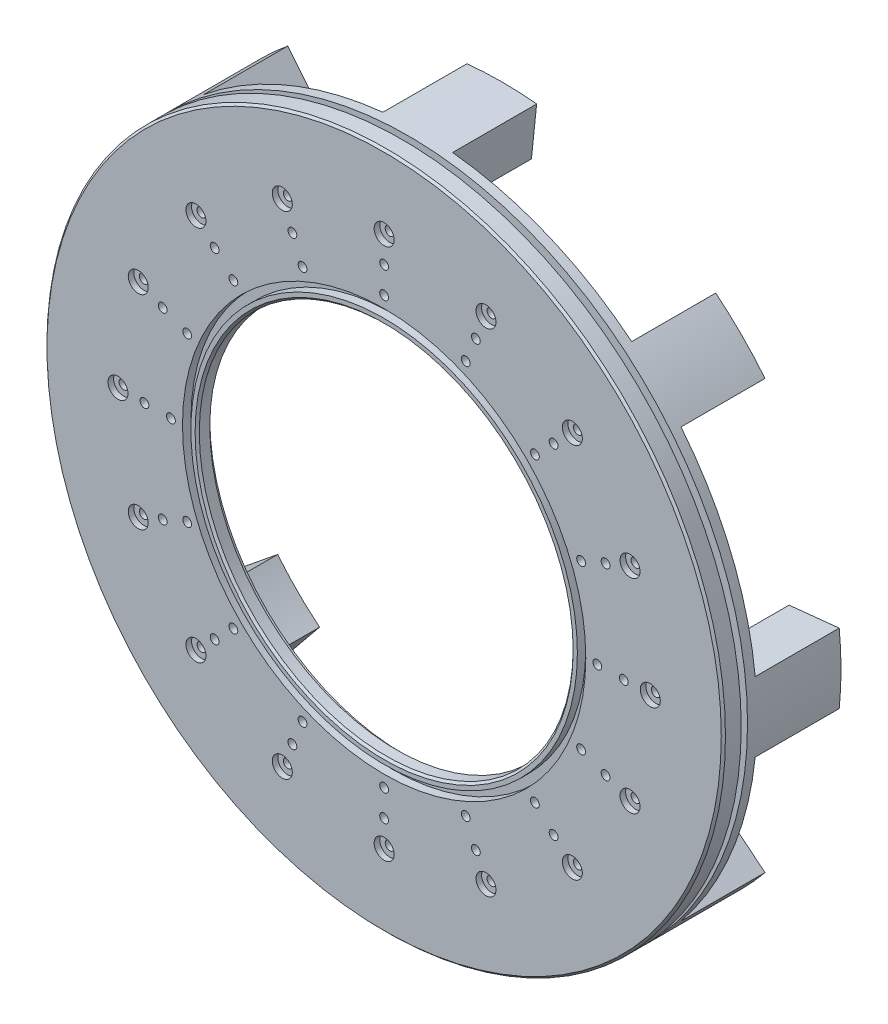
ISO-10303-21;
HEADER;
FILE_DESCRIPTION(('STEP AP214'),'2;1');
FILE_NAME('part.step','',(''),(''),'','','');
FILE_SCHEMA(('AUTOMOTIVE_DESIGN { 1 0 10303 214 1 1 1 1 }'));
ENDSEC;
DATA;
#1=APPLICATION_CONTEXT('core data for automotive mechanical design processes');
#2=APPLICATION_PROTOCOL_DEFINITION('international standard','automotive_design',2000,#1);
#3=PRODUCT_CONTEXT('',#1,'mechanical');
#4=PRODUCT('Part','Part','',(#3));
#5=PRODUCT_RELATED_PRODUCT_CATEGORY('part','',(#4));
#6=PRODUCT_DEFINITION_FORMATION('','',#4);
#7=PRODUCT_DEFINITION_CONTEXT('part definition',#1,'design');
#8=PRODUCT_DEFINITION('design','',#6,#7);
#9=PRODUCT_DEFINITION_SHAPE('','',#8);
#10=(LENGTH_UNIT() NAMED_UNIT(*) SI_UNIT(.MILLI.,.METRE.));
#11=(NAMED_UNIT(*) PLANE_ANGLE_UNIT() SI_UNIT($,.RADIAN.));
#12=(NAMED_UNIT(*) SI_UNIT($,.STERADIAN.) SOLID_ANGLE_UNIT());
#13=UNCERTAINTY_MEASURE_WITH_UNIT(LENGTH_MEASURE(1.E-05),#10,'distance_accuracy_value','');
#14=(GEOMETRIC_REPRESENTATION_CONTEXT(3) GLOBAL_UNCERTAINTY_ASSIGNED_CONTEXT((#13)) GLOBAL_UNIT_ASSIGNED_CONTEXT((#10,
#11,#12)) REPRESENTATION_CONTEXT('',''));
#15=CARTESIAN_POINT('',(0.,0.,0.));
#16=DIRECTION('',(0.,0.,1.));
#17=DIRECTION('',(1.,0.,0.));
#18=AXIS2_PLACEMENT_3D('',#15,#16,#17);
#19=CARTESIAN_POINT('',(0.,0.,0.));
#20=DIRECTION('',(0.,0.,1.));
#21=DIRECTION('',(1.,0.,0.));
#22=AXIS2_PLACEMENT_3D('',#19,#20,#21);
#23=PLANE('',#22);
#24=CARTESIAN_POINT('',(-104.65180361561,-104.651803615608,0.));
#25=DIRECTION('',(0.,0.,-1.));
#26=DIRECTION('',(0.707106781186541,-0.707106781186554,0.));
#27=AXIS2_PLACEMENT_3D('',#24,#25,#26);
#28=CIRCLE('',#27,6.35);
#29=CARTESIAN_POINT('',(-100.161675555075,-109.141931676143,0.));
#30=VERTEX_POINT('',#29);
#31=EDGE_CURVE('E1070',#30,#30,#28,.T.);
#32=ORIENTED_EDGE('',*,*,#31,.F.);
#33=EDGE_LOOP('',(#32));
#34=FACE_BOUND('',#33,.T.);
#35=CARTESIAN_POINT('',(0.,0.,0.));
#36=DIRECTION('',(0.,0.,1.));
#37=DIRECTION('',(1.,0.,0.));
#38=AXIS2_PLACEMENT_3D('',#35,#36,#37);
#39=CIRCLE('',#38,161.5);
#40=CARTESIAN_POINT('',(-125.328739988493,-101.857532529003,0.));
#41=VERTEX_POINT('',#40);
#42=CARTESIAN_POINT('',(-101.857532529,-125.328739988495,0.));
#43=VERTEX_POINT('',#42);
#44=EDGE_CURVE('E259',#41,#43,#39,.T.);
#45=ORIENTED_EDGE('',*,*,#44,.F.);
#46=DIRECTION('',(-0.776029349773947,-0.630696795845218,0.));
#47=VECTOR('',#46,1.);
#48=CARTESIAN_POINT('',(-135.805136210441,-110.371939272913,0.));
#49=LINE('',#48,#47);
#50=CARTESIAN_POINT('',(-106.704035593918,-86.7208094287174,0.));
#51=VERTEX_POINT('',#50);
#52=EDGE_CURVE('E244',#51,#41,#49,.T.);
#53=ORIENTED_EDGE('',*,*,#52,.F.);
#54=CARTESIAN_POINT('',(0.,0.,0.));
#55=DIRECTION('',(0.,0.,1.));
#56=DIRECTION('',(1.,0.,0.));
#57=AXIS2_PLACEMENT_3D('',#54,#55,#56);
#58=CIRCLE('',#57,137.5);
#59=CARTESIAN_POINT('',(-86.7208094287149,-106.70403559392,0.));
#60=VERTEX_POINT('',#59);
#61=EDGE_CURVE('E257',#51,#60,#58,.T.);
#62=ORIENTED_EDGE('',*,*,#61,.T.);
#63=DIRECTION('',(0.630696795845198,0.776029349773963,0.));
#64=VECTOR('',#63,1.);
#65=CARTESIAN_POINT('',(-110.37193927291,-135.805136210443,0.));
#66=LINE('',#65,#64);
#67=EDGE_CURVE('E609',#43,#60,#66,.T.);
#68=ORIENTED_EDGE('',*,*,#67,.F.);
#69=EDGE_LOOP('',(#45,#53,#62,#68));
#70=FACE_BOUND('',#69,.T.);
#71=ADVANCED_FACE('F32',(#34,#70),#23,.F.);
#72=CARTESIAN_POINT('',(-148.,1.55021771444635E-12,0.));
#73=DIRECTION('',(0.,0.,-1.));
#74=DIRECTION('',(0.,-1.,0.));
#75=AXIS2_PLACEMENT_3D('',#72,#73,#74);
#76=CIRCLE('',#75,6.35);
#77=CARTESIAN_POINT('',(-148.,-6.34999999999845,0.));
#78=VERTEX_POINT('',#77);
#79=EDGE_CURVE('E1063',#78,#78,#76,.T.);
#80=ORIENTED_EDGE('',*,*,#79,.F.);
#81=EDGE_LOOP('',(#80));
#82=FACE_BOUND('',#81,.T.);
#83=CARTESIAN_POINT('',(-136.772019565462,14.1302747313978,0.));
#84=VERTEX_POINT('',#83);
#85=CARTESIAN_POINT('',(-136.772019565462,-14.1302747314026,0.));
#86=VERTEX_POINT('',#85);
#87=EDGE_CURVE('E268',#84,#86,#58,.T.);
#88=ORIENTED_EDGE('',*,*,#87,.T.);
#89=DIRECTION('',(0.994705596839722,0.102765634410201,0.));
#90=VECTOR('',#89,1.);
#91=CARTESIAN_POINT('',(-174.073479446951,-17.9839860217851,0.));
#92=LINE('',#91,#90);
#93=CARTESIAN_POINT('',(-160.644953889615,-16.5966499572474,0.));
#94=VERTEX_POINT('',#93);
#95=EDGE_CURVE('E260',#94,#86,#92,.T.);
#96=ORIENTED_EDGE('',*,*,#95,.F.);
#97=CARTESIAN_POINT('',(-160.644953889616,16.5966499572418,0.));
#98=VERTEX_POINT('',#97);
#99=EDGE_CURVE('E284',#98,#94,#39,.T.);
#100=ORIENTED_EDGE('',*,*,#99,.F.);
#101=DIRECTION('',(-0.994705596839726,0.102765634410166,0.));
#102=VECTOR('',#101,1.);
#103=CARTESIAN_POINT('',(-174.073479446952,17.983986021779,0.));
#104=LINE('',#103,#102);
#105=EDGE_CURVE('E505',#84,#98,#104,.T.);
#106=ORIENTED_EDGE('',*,*,#105,.F.);
#107=EDGE_LOOP('',(#88,#96,#100,#106));
#108=FACE_BOUND('',#107,.T.);
#109=ADVANCED_FACE('F425',(#82,#108),#23,.F.);
#110=CARTESIAN_POINT('',(-104.651803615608,104.65180361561,0.));
#111=DIRECTION('',(0.,0.,-1.));
#112=DIRECTION('',(-0.707106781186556,-0.707106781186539,0.));
#113=AXIS2_PLACEMENT_3D('',#110,#111,#112);
#114=CIRCLE('',#113,6.35);
#115=CARTESIAN_POINT('',(-109.141931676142,100.161675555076,0.));
#116=VERTEX_POINT('',#115);
#117=EDGE_CURVE('E350',#116,#116,#114,.T.);
#118=ORIENTED_EDGE('',*,*,#117,.F.);
#119=EDGE_LOOP('',(#118));
#120=FACE_BOUND('',#119,.T.);
#121=CARTESIAN_POINT('',(-86.7208094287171,106.704035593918,0.));
#122=VERTEX_POINT('',#121);
#123=CARTESIAN_POINT('',(-106.704035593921,86.7208094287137,0.));
#124=VERTEX_POINT('',#123);
#125=EDGE_CURVE('E273',#122,#124,#58,.T.);
#126=ORIENTED_EDGE('',*,*,#125,.T.);
#127=DIRECTION('',(0.77602934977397,-0.63069679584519,0.));
#128=VECTOR('',#127,1.);
#129=CARTESIAN_POINT('',(-135.805136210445,110.371939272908,0.));
#130=LINE('',#129,#128);
#131=CARTESIAN_POINT('',(-125.328739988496,101.857532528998,0.));
#132=VERTEX_POINT('',#131);
#133=EDGE_CURVE('E316',#132,#124,#130,.T.);
#134=ORIENTED_EDGE('',*,*,#133,.F.);
#135=CARTESIAN_POINT('',(-101.857532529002,125.328739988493,0.));
#136=VERTEX_POINT('',#135);
#137=EDGE_CURVE('E2962',#136,#132,#39,.T.);
#138=ORIENTED_EDGE('',*,*,#137,.F.);
#139=DIRECTION('',(-0.630696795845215,0.776029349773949,0.));
#140=VECTOR('',#139,1.);
#141=CARTESIAN_POINT('',(-110.371939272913,135.805136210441,0.));
#142=LINE('',#141,#140);
#143=EDGE_CURVE('E318',#122,#136,#142,.T.);
#144=ORIENTED_EDGE('',*,*,#143,.F.);
#145=EDGE_LOOP('',(#126,#134,#138,#144));
#146=FACE_BOUND('',#145,.T.);
#147=ADVANCED_FACE('F314',(#120,#146),#23,.F.);
#148=CARTESIAN_POINT('',(0.,148.,0.));
#149=DIRECTION('',(0.,0.,-1.));
#150=DIRECTION('',(-1.,0.,0.));
#151=AXIS2_PLACEMENT_3D('',#148,#149,#150);
#152=CIRCLE('',#151,6.35);
#153=CARTESIAN_POINT('',(-6.35,148.,0.));
#154=VERTEX_POINT('',#153);
#155=EDGE_CURVE('E1039',#154,#154,#152,.T.);
#156=ORIENTED_EDGE('',*,*,#155,.F.);
#157=EDGE_LOOP('',(#156));
#158=FACE_BOUND('',#157,.T.);
#159=CARTESIAN_POINT('',(14.1302747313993,136.772019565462,0.));
#160=VERTEX_POINT('',#159);
#161=CARTESIAN_POINT('',(-14.1302747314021,136.772019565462,0.));
#162=VERTEX_POINT('',#161);
#163=EDGE_CURVE('E299',#160,#162,#58,.T.);
#164=ORIENTED_EDGE('',*,*,#163,.T.);
#165=DIRECTION('',(0.102765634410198,-0.994705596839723,0.));
#166=VECTOR('',#165,1.);
#167=CARTESIAN_POINT('',(-17.9839860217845,174.073479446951,0.));
#168=LINE('',#167,#166);
#169=CARTESIAN_POINT('',(-16.5966499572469,160.644953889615,0.));
#170=VERTEX_POINT('',#169);
#171=EDGE_CURVE('E524',#170,#162,#168,.T.);
#172=ORIENTED_EDGE('',*,*,#171,.F.);
#173=CARTESIAN_POINT('',(16.5966499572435,160.644953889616,0.));
#174=VERTEX_POINT('',#173);
#175=EDGE_CURVE('E2959',#174,#170,#39,.T.);
#176=ORIENTED_EDGE('',*,*,#175,.F.);
#177=DIRECTION('',(0.102765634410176,0.994705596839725,0.));
#178=VECTOR('',#177,1.);
#179=CARTESIAN_POINT('',(17.9839860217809,174.073479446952,0.));
#180=LINE('',#179,#178);
#181=EDGE_CURVE('E536',#160,#174,#180,.T.);
#182=ORIENTED_EDGE('',*,*,#181,.F.);
#183=EDGE_LOOP('',(#164,#172,#176,#182));
#184=FACE_BOUND('',#183,.T.);
#185=ADVANCED_FACE('F1047',(#158,#184),#23,.F.);
#186=CARTESIAN_POINT('',(104.651803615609,104.651803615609,0.));
#187=DIRECTION('',(0.,0.,-1.));
#188=DIRECTION('',(-0.707106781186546,0.707106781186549,0.));
#189=AXIS2_PLACEMENT_3D('',#186,#187,#188);
#190=CIRCLE('',#189,6.35);
#191=CARTESIAN_POINT('',(100.161675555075,109.141931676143,0.));
#192=VERTEX_POINT('',#191);
#193=EDGE_CURVE('E482',#192,#192,#190,.T.);
#194=ORIENTED_EDGE('',*,*,#193,.F.);
#195=EDGE_LOOP('',(#194));
#196=FACE_BOUND('',#195,.T.);
#197=CARTESIAN_POINT('',(106.704035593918,86.7208094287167,0.));
#198=VERTEX_POINT('',#197);
#199=CARTESIAN_POINT('',(86.7208094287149,106.70403559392,0.));
#200=VERTEX_POINT('',#199);
#201=EDGE_CURVE('E293',#198,#200,#58,.T.);
#202=ORIENTED_EDGE('',*,*,#201,.T.);
#203=DIRECTION('',(-0.630696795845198,-0.776029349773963,0.));
#204=VECTOR('',#203,1.);
#205=CARTESIAN_POINT('',(110.37193927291,135.805136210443,0.));
#206=LINE('',#205,#204);
#207=CARTESIAN_POINT('',(101.857532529,125.328739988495,0.));
#208=VERTEX_POINT('',#207);
#209=EDGE_CURVE('E541',#208,#200,#206,.T.);
#210=ORIENTED_EDGE('',*,*,#209,.F.);
#211=CARTESIAN_POINT('',(125.328739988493,101.857532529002,0.));
#212=VERTEX_POINT('',#211);
#213=EDGE_CURVE('E2961',#212,#208,#39,.T.);
#214=ORIENTED_EDGE('',*,*,#213,.F.);
#215=DIRECTION('',(0.776029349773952,0.630696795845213,0.));
#216=VECTOR('',#215,1.);
#217=CARTESIAN_POINT('',(135.805136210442,110.371939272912,0.));
#218=LINE('',#217,#216);
#219=EDGE_CURVE('E553',#198,#212,#218,.T.);
#220=ORIENTED_EDGE('',*,*,#219,.F.);
#221=EDGE_LOOP('',(#202,#210,#214,#220));
#222=FACE_BOUND('',#221,.T.);
#223=ADVANCED_FACE('F462',(#196,#222),#23,.F.);
#224=CARTESIAN_POINT('',(148.,-5.16739238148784E-13,0.));
#225=DIRECTION('',(0.,0.,-1.));
#226=DIRECTION('',(0.,1.,0.));
#227=AXIS2_PLACEMENT_3D('',#224,#225,#226);
#228=CIRCLE('',#227,6.35);
#229=CARTESIAN_POINT('',(148.,6.34999999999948,0.));
#230=VERTEX_POINT('',#229);
#231=EDGE_CURVE('E472',#230,#230,#228,.T.);
#232=ORIENTED_EDGE('',*,*,#231,.F.);
#233=EDGE_LOOP('',(#232));
#234=FACE_BOUND('',#233,.T.);
#235=CARTESIAN_POINT('',(136.772019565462,-14.1302747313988,0.));
#236=VERTEX_POINT('',#235);
#237=CARTESIAN_POINT('',(136.772019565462,14.1302747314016,0.));
#238=VERTEX_POINT('',#237);
#239=EDGE_CURVE('E287',#236,#238,#58,.T.);
#240=ORIENTED_EDGE('',*,*,#239,.T.);
#241=DIRECTION('',(-0.994705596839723,-0.102765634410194,0.));
#242=VECTOR('',#241,1.);
#243=CARTESIAN_POINT('',(174.073479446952,17.9839860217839,0.));
#244=LINE('',#243,#242);
#245=CARTESIAN_POINT('',(160.644953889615,16.5966499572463,0.));
#246=VERTEX_POINT('',#245);
#247=EDGE_CURVE('E558',#246,#238,#244,.T.);
#248=ORIENTED_EDGE('',*,*,#247,.F.);
#249=CARTESIAN_POINT('',(160.644953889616,-16.5966499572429,0.));
#250=VERTEX_POINT('',#249);
#251=EDGE_CURVE('E2964',#250,#246,#39,.T.);
#252=ORIENTED_EDGE('',*,*,#251,.F.);
#253=DIRECTION('',(0.994705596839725,-0.102765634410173,0.));
#254=VECTOR('',#253,1.);
#255=CARTESIAN_POINT('',(174.073479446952,-17.9839860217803,0.));
#256=LINE('',#255,#254);
#257=EDGE_CURVE('E570',#236,#250,#256,.T.);
#258=ORIENTED_EDGE('',*,*,#257,.F.);
#259=EDGE_LOOP('',(#240,#248,#252,#258));
#260=FACE_BOUND('',#259,.T.);
#261=ADVANCED_FACE('F454',(#234,#260),#23,.F.);
#262=CARTESIAN_POINT('',(104.651803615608,-104.65180361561,0.));
#263=DIRECTION('',(0.,0.,-1.));
#264=DIRECTION('',(0.707106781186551,0.707106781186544,0.));
#265=AXIS2_PLACEMENT_3D('',#262,#263,#264);
#266=CIRCLE('',#265,6.35);
#267=CARTESIAN_POINT('',(109.141931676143,-100.161675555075,0.));
#268=VERTEX_POINT('',#267);
#269=EDGE_CURVE('E466',#268,#268,#266,.T.);
#270=ORIENTED_EDGE('',*,*,#269,.F.);
#271=EDGE_LOOP('',(#270));
#272=FACE_BOUND('',#271,.T.);
#273=CARTESIAN_POINT('',(86.7208094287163,-106.704035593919,0.));
#274=VERTEX_POINT('',#273);
#275=CARTESIAN_POINT('',(106.70403559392,-86.7208094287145,0.));
#276=VERTEX_POINT('',#275);
#277=EDGE_CURVE('E279',#274,#276,#58,.T.);
#278=ORIENTED_EDGE('',*,*,#277,.T.);
#279=DIRECTION('',(-0.776029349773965,0.630696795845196,0.));
#280=VECTOR('',#279,1.);
#281=CARTESIAN_POINT('',(135.805136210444,-110.371939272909,0.));
#282=LINE('',#281,#280);
#283=CARTESIAN_POINT('',(125.328739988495,-101.857532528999,0.));
#284=VERTEX_POINT('',#283);
#285=EDGE_CURVE('E575',#284,#276,#282,.T.);
#286=ORIENTED_EDGE('',*,*,#285,.F.);
#287=CARTESIAN_POINT('',(101.857532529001,-125.328739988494,0.));
#288=VERTEX_POINT('',#287);
#289=EDGE_CURVE('E2968',#288,#284,#39,.T.);
#290=ORIENTED_EDGE('',*,*,#289,.F.);
#291=DIRECTION('',(0.63069679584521,-0.776029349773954,0.));
#292=VECTOR('',#291,1.);
#293=CARTESIAN_POINT('',(110.371939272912,-135.805136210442,0.));
#294=LINE('',#293,#292);
#295=EDGE_CURVE('E587',#274,#288,#294,.T.);
#296=ORIENTED_EDGE('',*,*,#295,.F.);
#297=EDGE_LOOP('',(#278,#286,#290,#296));
#298=FACE_BOUND('',#297,.T.);
#299=ADVANCED_FACE('F440',(#272,#298),#23,.F.);
#300=CARTESIAN_POINT('',(0.,0.,56.));
#301=DIRECTION('',(0.,0.,1.));
#302=DIRECTION('',(1.,0.,0.));
#303=AXIS2_PLACEMENT_3D('',#300,#301,#302);
#304=PLANE('',#303);
#305=CARTESIAN_POINT('',(0.,0.,56.));
#306=DIRECTION('',(0.,0.,1.));
#307=DIRECTION('',(1.,0.,0.));
#308=AXIS2_PLACEMENT_3D('',#305,#306,#307);
#309=CIRCLE('',#308,90.0000000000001);
#310=CARTESIAN_POINT('',(90.0000000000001,0.,56.));
#311=VERTEX_POINT('',#310);
#312=EDGE_CURVE('E407',#311,#311,#309,.F.);
#313=ORIENTED_EDGE('',*,*,#312,.T.);
#314=EDGE_LOOP('',(#313));
#315=FACE_BOUND('',#314,.T.);
#316=CARTESIAN_POINT('',(0.,0.,56.));
#317=DIRECTION('',(0.,0.,1.));
#318=DIRECTION('',(1.,0.,0.));
#319=AXIS2_PLACEMENT_3D('',#316,#317,#318);
#320=CIRCLE('',#319,92.);
#321=CARTESIAN_POINT('',(92.,0.,56.));
#322=VERTEX_POINT('',#321);
#323=EDGE_CURVE('E621',#322,#322,#320,.T.);
#324=ORIENTED_EDGE('',*,*,#323,.T.);
#325=EDGE_LOOP('',(#324));
#326=FACE_BOUND('',#325,.T.);
#327=ADVANCED_FACE('F453',(#315,#326),#304,.T.);
#328=CARTESIAN_POINT('',(0.,0.,50.));
#329=DIRECTION('',(0.,0.,-1.));
#330=DIRECTION('',(-1.,0.,0.));
#331=AXIS2_PLACEMENT_3D('',#328,#329,#330);
#332=CYLINDRICAL_SURFACE('',#331,161.5);
#333=CARTESIAN_POINT('',(0.,0.,40.));
#334=DIRECTION('',(0.,0.,-1.));
#335=DIRECTION('',(-1.,0.,0.));
#336=AXIS2_PLACEMENT_3D('',#333,#334,#335);
#337=CIRCLE('',#336,161.5);
#338=CARTESIAN_POINT('',(-125.328739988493,-101.857532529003,40.));
#339=VERTEX_POINT('',#338);
#340=CARTESIAN_POINT('',(-160.644953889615,-16.5966499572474,40.));
#341=VERTEX_POINT('',#340);
#342=EDGE_CURVE('E496',#339,#341,#337,.T.);
#343=ORIENTED_EDGE('',*,*,#342,.F.);
#344=DIRECTION('',(0.,0.,-1.));
#345=VECTOR('',#344,1.);
#346=CARTESIAN_POINT('',(-125.328739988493,-101.857532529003,50.));
#347=LINE('',#346,#345);
#348=EDGE_CURVE('E503',#339,#41,#347,.T.);
#349=ORIENTED_EDGE('',*,*,#348,.T.);
#350=ORIENTED_EDGE('',*,*,#44,.T.);
#351=DIRECTION('',(0.,0.,-1.));
#352=VECTOR('',#351,1.);
#353=CARTESIAN_POINT('',(-101.857532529,-125.328739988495,50.));
#354=LINE('',#353,#352);
#355=CARTESIAN_POINT('',(-101.857532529,-125.328739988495,40.));
#356=VERTEX_POINT('',#355);
#357=EDGE_CURVE('E615',#43,#356,#354,.F.);
#358=ORIENTED_EDGE('',*,*,#357,.T.);
#359=CARTESIAN_POINT('',(0.,0.,40.));
#360=DIRECTION('',(0.,0.,-1.));
#361=DIRECTION('',(-1.,0.,0.));
#362=AXIS2_PLACEMENT_3D('',#359,#360,#361);
#363=CIRCLE('',#362,161.5);
#364=CARTESIAN_POINT('',(-16.5966499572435,-160.644953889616,40.));
#365=VERTEX_POINT('',#364);
#366=EDGE_CURVE('E611',#365,#356,#363,.T.);
#367=ORIENTED_EDGE('',*,*,#366,.F.);
#368=DIRECTION('',(0.,0.,-1.));
#369=VECTOR('',#368,1.);
#370=CARTESIAN_POINT('',(-16.5966499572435,-160.644953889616,50.));
#371=LINE('',#370,#369);
#372=CARTESIAN_POINT('',(-16.5966499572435,-160.644953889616,0.));
#373=VERTEX_POINT('',#372);
#374=EDGE_CURVE('E618',#365,#373,#371,.T.);
#375=ORIENTED_EDGE('',*,*,#374,.T.);
#376=CARTESIAN_POINT('',(16.5966499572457,-160.644953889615,0.));
#377=VERTEX_POINT('',#376);
#378=EDGE_CURVE('E285',#373,#377,#39,.T.);
#379=ORIENTED_EDGE('',*,*,#378,.T.);
#380=DIRECTION('',(0.,0.,-1.));
#381=VECTOR('',#380,1.);
#382=CARTESIAN_POINT('',(16.5966499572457,-160.644953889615,50.));
#383=LINE('',#382,#381);
#384=CARTESIAN_POINT('',(16.5966499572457,-160.644953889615,40.));
#385=VERTEX_POINT('',#384);
#386=EDGE_CURVE('E598',#377,#385,#383,.F.);
#387=ORIENTED_EDGE('',*,*,#386,.T.);
#388=CARTESIAN_POINT('',(0.,0.,40.));
#389=DIRECTION('',(0.,0.,-1.));
#390=DIRECTION('',(-1.,0.,0.));
#391=AXIS2_PLACEMENT_3D('',#388,#389,#390);
#392=CIRCLE('',#391,161.5);
#393=CARTESIAN_POINT('',(101.857532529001,-125.328739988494,40.));
#394=VERTEX_POINT('',#393);
#395=EDGE_CURVE('E594',#394,#385,#392,.T.);
#396=ORIENTED_EDGE('',*,*,#395,.F.);
#397=DIRECTION('',(0.,0.,-1.));
#398=VECTOR('',#397,1.);
#399=CARTESIAN_POINT('',(101.857532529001,-125.328739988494,50.));
#400=LINE('',#399,#398);
#401=EDGE_CURVE('E601',#394,#288,#400,.T.);
#402=ORIENTED_EDGE('',*,*,#401,.T.);
#403=ORIENTED_EDGE('',*,*,#289,.T.);
#404=DIRECTION('',(0.,0.,-1.));
#405=VECTOR('',#404,1.);
#406=CARTESIAN_POINT('',(125.328739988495,-101.857532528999,50.));
#407=LINE('',#406,#405);
#408=CARTESIAN_POINT('',(125.328739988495,-101.857532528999,40.));
#409=VERTEX_POINT('',#408);
#410=EDGE_CURVE('E581',#284,#409,#407,.F.);
#411=ORIENTED_EDGE('',*,*,#410,.T.);
#412=CARTESIAN_POINT('',(0.,0.,40.));
#413=DIRECTION('',(0.,0.,-1.));
#414=DIRECTION('',(-1.,0.,0.));
#415=AXIS2_PLACEMENT_3D('',#412,#413,#414);
#416=CIRCLE('',#415,161.5);
#417=CARTESIAN_POINT('',(160.644953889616,-16.5966499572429,40.));
#418=VERTEX_POINT('',#417);
#419=EDGE_CURVE('E577',#418,#409,#416,.T.);
#420=ORIENTED_EDGE('',*,*,#419,.F.);
#421=DIRECTION('',(0.,0.,-1.));
#422=VECTOR('',#421,1.);
#423=CARTESIAN_POINT('',(160.644953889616,-16.5966499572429,50.));
#424=LINE('',#423,#422);
#425=EDGE_CURVE('E584',#418,#250,#424,.T.);
#426=ORIENTED_EDGE('',*,*,#425,.T.);
#427=ORIENTED_EDGE('',*,*,#251,.T.);
#428=DIRECTION('',(0.,0.,-1.));
#429=VECTOR('',#428,1.);
#430=CARTESIAN_POINT('',(160.644953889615,16.5966499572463,50.));
#431=LINE('',#430,#429);
#432=CARTESIAN_POINT('',(160.644953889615,16.5966499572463,40.));
#433=VERTEX_POINT('',#432);
#434=EDGE_CURVE('E564',#246,#433,#431,.F.);
#435=ORIENTED_EDGE('',*,*,#434,.T.);
#436=CARTESIAN_POINT('',(0.,0.,40.));
#437=DIRECTION('',(0.,0.,-1.));
#438=DIRECTION('',(-1.,0.,0.));
#439=AXIS2_PLACEMENT_3D('',#436,#437,#438);
#440=CIRCLE('',#439,161.5);
#441=CARTESIAN_POINT('',(125.328739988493,101.857532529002,40.));
#442=VERTEX_POINT('',#441);
#443=EDGE_CURVE('E560',#442,#433,#440,.T.);
#444=ORIENTED_EDGE('',*,*,#443,.F.);
#445=DIRECTION('',(0.,0.,-1.));
#446=VECTOR('',#445,1.);
#447=CARTESIAN_POINT('',(125.328739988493,101.857532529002,50.));
#448=LINE('',#447,#446);
#449=EDGE_CURVE('E567',#442,#212,#448,.T.);
#450=ORIENTED_EDGE('',*,*,#449,.T.);
#451=ORIENTED_EDGE('',*,*,#213,.T.);
#452=DIRECTION('',(0.,0.,-1.));
#453=VECTOR('',#452,1.);
#454=CARTESIAN_POINT('',(101.857532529,125.328739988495,50.));
#455=LINE('',#454,#453);
#456=CARTESIAN_POINT('',(101.857532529,125.328739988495,40.));
#457=VERTEX_POINT('',#456);
#458=EDGE_CURVE('E547',#208,#457,#455,.F.);
#459=ORIENTED_EDGE('',*,*,#458,.T.);
#460=CARTESIAN_POINT('',(0.,0.,40.));
#461=DIRECTION('',(0.,0.,-1.));
#462=DIRECTION('',(-1.,0.,0.));
#463=AXIS2_PLACEMENT_3D('',#460,#461,#462);
#464=CIRCLE('',#463,161.5);
#465=CARTESIAN_POINT('',(16.5966499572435,160.644953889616,40.));
#466=VERTEX_POINT('',#465);
#467=EDGE_CURVE('E543',#466,#457,#464,.T.);
#468=ORIENTED_EDGE('',*,*,#467,.F.);
#469=DIRECTION('',(0.,0.,-1.));
#470=VECTOR('',#469,1.);
#471=CARTESIAN_POINT('',(16.5966499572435,160.644953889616,50.));
#472=LINE('',#471,#470);
#473=EDGE_CURVE('E550',#466,#174,#472,.T.);
#474=ORIENTED_EDGE('',*,*,#473,.T.);
#475=ORIENTED_EDGE('',*,*,#175,.T.);
#476=DIRECTION('',(0.,0.,-1.));
#477=VECTOR('',#476,1.);
#478=CARTESIAN_POINT('',(-16.5966499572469,160.644953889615,50.));
#479=LINE('',#478,#477);
#480=CARTESIAN_POINT('',(-16.5966499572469,160.644953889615,40.));
#481=VERTEX_POINT('',#480);
#482=EDGE_CURVE('E530',#170,#481,#479,.F.);
#483=ORIENTED_EDGE('',*,*,#482,.T.);
#484=CARTESIAN_POINT('',(0.,0.,40.));
#485=DIRECTION('',(0.,0.,-1.));
#486=DIRECTION('',(-1.,0.,0.));
#487=AXIS2_PLACEMENT_3D('',#484,#485,#486);
#488=CIRCLE('',#487,161.5);
#489=CARTESIAN_POINT('',(-101.857532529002,125.328739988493,40.));
#490=VERTEX_POINT('',#489);
#491=EDGE_CURVE('E526',#490,#481,#488,.T.);
#492=ORIENTED_EDGE('',*,*,#491,.F.);
#493=DIRECTION('',(0.,0.,-1.));
#494=VECTOR('',#493,1.);
#495=CARTESIAN_POINT('',(-101.857532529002,125.328739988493,50.));
#496=LINE('',#495,#494);
#497=EDGE_CURVE('E533',#490,#136,#496,.T.);
#498=ORIENTED_EDGE('',*,*,#497,.T.);
#499=ORIENTED_EDGE('',*,*,#137,.T.);
#500=DIRECTION('',(0.,0.,-1.));
#501=VECTOR('',#500,1.);
#502=CARTESIAN_POINT('',(-125.328739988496,101.857532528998,50.));
#503=LINE('',#502,#501);
#504=CARTESIAN_POINT('',(-125.328739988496,101.857532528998,40.));
#505=VERTEX_POINT('',#504);
#506=EDGE_CURVE('E514',#132,#505,#503,.F.);
#507=ORIENTED_EDGE('',*,*,#506,.T.);
#508=CARTESIAN_POINT('',(0.,0.,40.));
#509=DIRECTION('',(0.,0.,-1.));
#510=DIRECTION('',(-1.,0.,0.));
#511=AXIS2_PLACEMENT_3D('',#508,#509,#510);
#512=CIRCLE('',#511,161.5);
#513=CARTESIAN_POINT('',(-160.644953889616,16.5966499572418,40.));
#514=VERTEX_POINT('',#513);
#515=EDGE_CURVE('E510',#514,#505,#512,.T.);
#516=ORIENTED_EDGE('',*,*,#515,.F.);
#517=DIRECTION('',(0.,0.,-1.));
#518=VECTOR('',#517,1.);
#519=CARTESIAN_POINT('',(-160.644953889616,16.5966499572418,50.));
#520=LINE('',#519,#518);
#521=EDGE_CURVE('E517',#514,#98,#520,.T.);
#522=ORIENTED_EDGE('',*,*,#521,.T.);
#523=ORIENTED_EDGE('',*,*,#99,.T.);
#524=DIRECTION('',(0.,0.,-1.));
#525=VECTOR('',#524,1.);
#526=CARTESIAN_POINT('',(-160.644953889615,-16.5966499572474,50.));
#527=LINE('',#526,#525);
#528=EDGE_CURVE('E500',#94,#341,#527,.F.);
#529=ORIENTED_EDGE('',*,*,#528,.T.);
#530=EDGE_LOOP('',(#343,#349,#350,#358,#367,#375,#379,#387,#396,#402,#403,#411,#420,#426,#427,
#435,#444,#450,#451,#459,#468,#474,#475,#483,#492,#498,#499,#507,#516,#522,#523,#529));
#531=FACE_BOUND('',#530,.T.);
#532=CARTESIAN_POINT('',(0.,0.,44.5));
#533=DIRECTION('',(0.,0.,1.));
#534=DIRECTION('',(1.,0.,0.));
#535=AXIS2_PLACEMENT_3D('',#532,#533,#534);
#536=CIRCLE('',#535,161.5);
#537=CARTESIAN_POINT('',(161.5,0.,44.5));
#538=VERTEX_POINT('',#537);
#539=EDGE_CURVE('E644',#538,#538,#536,.T.);
#540=ORIENTED_EDGE('',*,*,#539,.F.);
#541=EDGE_LOOP('',(#540));
#542=FACE_BOUND('',#541,.T.);
#543=ADVANCED_FACE('F446',(#531,#542),#332,.T.);
#544=CARTESIAN_POINT('',(0.,0.,50.));
#545=DIRECTION('',(0.,0.,1.));
#546=DIRECTION('',(1.,0.,0.));
#547=AXIS2_PLACEMENT_3D('',#544,#545,#546);
#548=PLANE('',#547);
#549=CARTESIAN_POINT('',(0.,0.,50.));
#550=DIRECTION('',(0.,0.,1.));
#551=DIRECTION('',(1.,0.,0.));
#552=AXIS2_PLACEMENT_3D('',#549,#550,#551);
#553=CIRCLE('',#552,136.5);
#554=CARTESIAN_POINT('',(136.5,0.,50.));
#555=VERTEX_POINT('',#554);
#556=EDGE_CURVE('E401',#555,#555,#553,.F.);
#557=ORIENTED_EDGE('',*,*,#556,.T.);
#558=EDGE_LOOP('',(#557));
#559=FACE_BOUND('',#558,.T.);
#560=CARTESIAN_POINT('',(48.4859908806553,117.055536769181,50.));
#561=DIRECTION('',(0.,0.,1.));
#562=DIRECTION('',(0.923879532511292,-0.382683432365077,0.));
#563=AXIS2_PLACEMENT_3D('',#560,#561,#562);
#564=CIRCLE('',#563,2.15265);
#565=CARTESIAN_POINT('',(50.4747801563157,116.2317532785,50.));
#566=VERTEX_POINT('',#565);
#567=EDGE_CURVE('E643',#566,#566,#564,.T.);
#568=ORIENTED_EDGE('',*,*,#567,.T.);
#569=EDGE_LOOP('',(#568));
#570=FACE_BOUND('',#569,.T.);
#571=CARTESIAN_POINT('',(89.5904291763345,89.5904291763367,50.));
#572=DIRECTION('',(0.,0.,1.));
#573=DIRECTION('',(0.707106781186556,-0.707106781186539,0.));
#574=AXIS2_PLACEMENT_3D('',#571,#572,#573);
#575=CIRCLE('',#574,2.15265);
#576=CARTESIAN_POINT('',(91.1125825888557,88.0682757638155,50.));
#577=VERTEX_POINT('',#576);
#578=EDGE_CURVE('E656',#577,#577,#575,.T.);
#579=ORIENTED_EDGE('',*,*,#578,.T.);
#580=EDGE_LOOP('',(#579));
#581=FACE_BOUND('',#580,.T.);
#582=CARTESIAN_POINT('',(117.05553676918,48.4859908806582,50.));
#583=DIRECTION('',(0.,0.,1.));
#584=DIRECTION('',(0.3826834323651,-0.923879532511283,0.));
#585=AXIS2_PLACEMENT_3D('',#582,#583,#584);
#586=CIRCLE('',#585,2.15265);
#587=CARTESIAN_POINT('',(117.87932025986,46.4972016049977,50.));
#588=VERTEX_POINT('',#587);
#589=EDGE_CURVE('E668',#588,#588,#586,.T.);
#590=ORIENTED_EDGE('',*,*,#589,.T.);
#591=EDGE_LOOP('',(#590));
#592=FACE_BOUND('',#591,.T.);
#593=CARTESIAN_POINT('',(126.7,1.32711205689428E-12,50.));
#594=DIRECTION('',(0.,0.,1.));
#595=DIRECTION('',(0.,-1.,0.));
#596=AXIS2_PLACEMENT_3D('',#593,#594,#595);
#597=CIRCLE('',#596,2.15265);
#598=CARTESIAN_POINT('',(126.7,-2.15264999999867,50.));
#599=VERTEX_POINT('',#598);
#600=EDGE_CURVE('E680',#599,#599,#597,.T.);
#601=ORIENTED_EDGE('',*,*,#600,.T.);
#602=EDGE_LOOP('',(#601));
#603=FACE_BOUND('',#602,.T.);
#604=CARTESIAN_POINT('',(117.055536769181,-48.4859908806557,50.));
#605=DIRECTION('',(0.,0.,1.));
#606=DIRECTION('',(-0.382683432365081,-0.923879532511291,0.));
#607=AXIS2_PLACEMENT_3D('',#604,#605,#606);
#608=CIRCLE('',#607,2.15265);
#609=CARTESIAN_POINT('',(116.2317532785,-50.4747801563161,50.));
#610=VERTEX_POINT('',#609);
#611=EDGE_CURVE('E692',#610,#610,#608,.T.);
#612=ORIENTED_EDGE('',*,*,#611,.T.);
#613=EDGE_LOOP('',(#612));
#614=FACE_BOUND('',#613,.T.);
#615=CARTESIAN_POINT('',(89.5904291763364,-89.5904291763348,50.));
#616=DIRECTION('',(0.,0.,1.));
#617=DIRECTION('',(-0.707106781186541,-0.707106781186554,0.));
#618=AXIS2_PLACEMENT_3D('',#615,#616,#617);
#619=CIRCLE('',#618,2.15265);
#620=CARTESIAN_POINT('',(88.0682757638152,-91.112582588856,50.));
#621=VERTEX_POINT('',#620);
#622=EDGE_CURVE('E704',#621,#621,#619,.T.);
#623=ORIENTED_EDGE('',*,*,#622,.T.);
#624=EDGE_LOOP('',(#623));
#625=FACE_BOUND('',#624,.T.);
#626=CARTESIAN_POINT('',(48.4859908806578,-117.05553676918,50.));
#627=DIRECTION('',(0.,0.,1.));
#628=DIRECTION('',(-0.923879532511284,-0.382683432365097,0.));
#629=AXIS2_PLACEMENT_3D('',#626,#627,#628);
#630=CIRCLE('',#629,2.15265);
#631=CARTESIAN_POINT('',(46.4972016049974,-117.87932025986,50.));
#632=VERTEX_POINT('',#631);
#633=EDGE_CURVE('E716',#632,#632,#630,.T.);
#634=ORIENTED_EDGE('',*,*,#633,.T.);
#635=EDGE_LOOP('',(#634));
#636=FACE_BOUND('',#635,.T.);
#637=CARTESIAN_POINT('',(0.,-126.7,50.));
#638=DIRECTION('',(0.,0.,1.));
#639=DIRECTION('',(-1.,0.,0.));
#640=AXIS2_PLACEMENT_3D('',#637,#638,#639);
#641=CIRCLE('',#640,2.15265);
#642=CARTESIAN_POINT('',(-2.15265,-126.7,50.));
#643=VERTEX_POINT('',#642);
#644=EDGE_CURVE('E728',#643,#643,#641,.T.);
#645=ORIENTED_EDGE('',*,*,#644,.T.);
#646=EDGE_LOOP('',(#645));
#647=FACE_BOUND('',#646,.T.);
#648=CARTESIAN_POINT('',(-48.4859908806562,-117.05553676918,50.));
#649=DIRECTION('',(0.,0.,1.));
#650=DIRECTION('',(-0.923879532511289,0.382683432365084,0.));
#651=AXIS2_PLACEMENT_3D('',#648,#649,#650);
#652=CIRCLE('',#651,2.15265);
#653=CARTESIAN_POINT('',(-50.4747801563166,-116.2317532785,50.));
#654=VERTEX_POINT('',#653);
#655=EDGE_CURVE('E740',#654,#654,#652,.T.);
#656=ORIENTED_EDGE('',*,*,#655,.T.);
#657=EDGE_LOOP('',(#656));
#658=FACE_BOUND('',#657,.T.);
#659=CARTESIAN_POINT('',(-89.5904291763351,-89.590429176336,50.));
#660=DIRECTION('',(0.,0.,1.));
#661=DIRECTION('',(-0.707106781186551,0.707106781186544,0.));
#662=AXIS2_PLACEMENT_3D('',#659,#660,#661);
#663=CIRCLE('',#662,2.15265);
#664=CARTESIAN_POINT('',(-91.1125825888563,-88.0682757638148,50.));
#665=VERTEX_POINT('',#664);
#666=EDGE_CURVE('E752',#665,#665,#663,.T.);
#667=ORIENTED_EDGE('',*,*,#666,.T.);
#668=EDGE_LOOP('',(#667));
#669=FACE_BOUND('',#668,.T.);
#670=CARTESIAN_POINT('',(-117.05553676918,-48.4859908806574,50.));
#671=DIRECTION('',(0.,0.,1.));
#672=DIRECTION('',(-0.382683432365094,0.923879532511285,0.));
#673=AXIS2_PLACEMENT_3D('',#670,#671,#672);
#674=CIRCLE('',#673,2.15265);
#675=CARTESIAN_POINT('',(-117.879320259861,-46.497201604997,50.));
#676=VERTEX_POINT('',#675);
#677=EDGE_CURVE('E764',#676,#676,#674,.T.);
#678=ORIENTED_EDGE('',*,*,#677,.T.);
#679=EDGE_LOOP('',(#678));
#680=FACE_BOUND('',#679,.T.);
#681=CARTESIAN_POINT('',(-126.7,-4.42370685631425E-13,50.));
#682=DIRECTION('',(0.,0.,1.));
#683=DIRECTION('',(0.,1.,0.));
#684=AXIS2_PLACEMENT_3D('',#681,#682,#683);
#685=CIRCLE('',#684,2.15265);
#686=CARTESIAN_POINT('',(-126.7,2.15264999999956,50.));
#687=VERTEX_POINT('',#686);
#688=EDGE_CURVE('E776',#687,#687,#685,.T.);
#689=ORIENTED_EDGE('',*,*,#688,.T.);
#690=EDGE_LOOP('',(#689));
#691=FACE_BOUND('',#690,.T.);
#692=CARTESIAN_POINT('',(-117.05553676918,48.4859908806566,50.));
#693=DIRECTION('',(0.,0.,1.));
#694=DIRECTION('',(0.382683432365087,0.923879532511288,0.));
#695=AXIS2_PLACEMENT_3D('',#692,#693,#694);
#696=CIRCLE('',#695,2.15265);
#697=CARTESIAN_POINT('',(-116.231753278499,50.474780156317,50.));
#698=VERTEX_POINT('',#697);
#699=EDGE_CURVE('E788',#698,#698,#696,.T.);
#700=ORIENTED_EDGE('',*,*,#699,.T.);
#701=EDGE_LOOP('',(#700));
#702=FACE_BOUND('',#701,.T.);
#703=CARTESIAN_POINT('',(-89.5904291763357,89.5904291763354,50.));
#704=DIRECTION('',(0.,0.,1.));
#705=DIRECTION('',(0.707106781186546,0.707106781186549,0.));
#706=AXIS2_PLACEMENT_3D('',#703,#704,#705);
#707=CIRCLE('',#706,2.15265);
#708=CARTESIAN_POINT('',(-88.0682757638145,91.1125825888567,50.));
#709=VERTEX_POINT('',#708);
#710=EDGE_CURVE('E800',#709,#709,#707,.T.);
#711=ORIENTED_EDGE('',*,*,#710,.T.);
#712=EDGE_LOOP('',(#711));
#713=FACE_BOUND('',#712,.T.);
#714=CARTESIAN_POINT('',(-48.485990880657,117.05553676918,50.));
#715=DIRECTION('',(0.,0.,1.));
#716=DIRECTION('',(0.923879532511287,0.382683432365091,0.));
#717=AXIS2_PLACEMENT_3D('',#714,#715,#716);
#718=CIRCLE('',#717,2.15265);
#719=CARTESIAN_POINT('',(-46.4972016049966,117.879320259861,50.));
#720=VERTEX_POINT('',#719);
#721=EDGE_CURVE('E812',#720,#720,#718,.T.);
#722=ORIENTED_EDGE('',*,*,#721,.T.);
#723=EDGE_LOOP('',(#722));
#724=FACE_BOUND('',#723,.T.);
#725=CARTESIAN_POINT('',(0.,126.7,50.));
#726=DIRECTION('',(0.,0.,1.));
#727=DIRECTION('',(1.,0.,0.));
#728=AXIS2_PLACEMENT_3D('',#725,#726,#727);
#729=CIRCLE('',#728,2.15265);
#730=CARTESIAN_POINT('',(2.15265,126.7,50.));
#731=VERTEX_POINT('',#730);
#732=EDGE_CURVE('E1010',#731,#731,#729,.T.);
#733=ORIENTED_EDGE('',*,*,#732,.T.);
#734=EDGE_LOOP('',(#733));
#735=FACE_BOUND('',#734,.T.);
#736=CARTESIAN_POINT('',(0.,0.,50.));
#737=DIRECTION('',(0.,0.,1.));
#738=DIRECTION('',(1.,0.,0.));
#739=AXIS2_PLACEMENT_3D('',#736,#737,#738);
#740=CIRCLE('',#739,123.);
#741=CARTESIAN_POINT('',(123.,0.,50.));
#742=VERTEX_POINT('',#741);
#743=EDGE_CURVE('E2914',#742,#742,#740,.F.);
#744=ORIENTED_EDGE('',*,*,#743,.F.);
#745=EDGE_LOOP('',(#744));
#746=FACE_BOUND('',#745,.T.);
#747=ADVANCED_FACE('F447',(#559,#570,#581,#592,#603,#614,#625,#636,#647,#658,#669,#680,#691,
#702,#713,#724,#735,#746),#548,.F.);
#748=CARTESIAN_POINT('',(38.8423683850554,93.7737725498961,50.));
#749=DIRECTION('',(0.,0.,1.));
#750=DIRECTION('',(0.923879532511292,-0.382683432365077,0.));
#751=AXIS2_PLACEMENT_3D('',#748,#749,#750);
#752=CIRCLE('',#751,2.09999999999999);
#753=CARTESIAN_POINT('',(40.7825154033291,92.9701373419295,50.));
#754=VERTEX_POINT('',#753);
#755=EDGE_CURVE('E824',#754,#754,#752,.T.);
#756=ORIENTED_EDGE('',*,*,#755,.T.);
#757=EDGE_LOOP('',(#756));
#758=FACE_BOUND('',#757,.T.);
#759=CARTESIAN_POINT('',(71.7713382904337,71.7713382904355,50.));
#760=DIRECTION('',(0.,0.,1.));
#761=DIRECTION('',(0.707106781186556,-0.707106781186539,0.));
#762=AXIS2_PLACEMENT_3D('',#759,#760,#761);
#763=CIRCLE('',#762,2.09999999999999);
#764=CARTESIAN_POINT('',(73.2562625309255,70.2864140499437,50.));
#765=VERTEX_POINT('',#764);
#766=EDGE_CURVE('E830',#765,#765,#763,.T.);
#767=ORIENTED_EDGE('',*,*,#766,.T.);
#768=EDGE_LOOP('',(#767));
#769=FACE_BOUND('',#768,.T.);
#770=CARTESIAN_POINT('',(93.7737725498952,38.8423683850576,50.));
#771=DIRECTION('',(0.,0.,1.));
#772=DIRECTION('',(0.3826834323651,-0.923879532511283,0.));
#773=AXIS2_PLACEMENT_3D('',#770,#771,#772);
#774=CIRCLE('',#773,2.09999999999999);
#775=CARTESIAN_POINT('',(94.5774077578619,36.9022213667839,50.));
#776=VERTEX_POINT('',#775);
#777=EDGE_CURVE('E836',#776,#776,#774,.T.);
#778=ORIENTED_EDGE('',*,*,#777,.T.);
#779=EDGE_LOOP('',(#778));
#780=FACE_BOUND('',#779,.T.);
#781=CARTESIAN_POINT('',(101.5,1.06315606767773E-12,50.));
#782=DIRECTION('',(0.,0.,1.));
#783=DIRECTION('',(0.,-1.,0.));
#784=AXIS2_PLACEMENT_3D('',#781,#782,#783);
#785=CIRCLE('',#784,2.09999999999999);
#786=CARTESIAN_POINT('',(101.5,-2.09999999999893,50.));
#787=VERTEX_POINT('',#786);
#788=EDGE_CURVE('E842',#787,#787,#785,.T.);
#789=ORIENTED_EDGE('',*,*,#788,.T.);
#790=EDGE_LOOP('',(#789));
#791=FACE_BOUND('',#790,.T.);
#792=CARTESIAN_POINT('',(93.773772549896,-38.8423683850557,50.));
#793=DIRECTION('',(0.,0.,1.));
#794=DIRECTION('',(-0.382683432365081,-0.923879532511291,0.));
#795=AXIS2_PLACEMENT_3D('',#792,#793,#794);
#796=CIRCLE('',#795,2.09999999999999);
#797=CARTESIAN_POINT('',(92.9701373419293,-40.7825154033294,50.));
#798=VERTEX_POINT('',#797);
#799=EDGE_CURVE('E848',#798,#798,#796,.T.);
#800=ORIENTED_EDGE('',*,*,#799,.T.);
#801=EDGE_LOOP('',(#800));
#802=FACE_BOUND('',#801,.T.);
#803=CARTESIAN_POINT('',(71.7713382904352,-71.771338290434,50.));
#804=DIRECTION('',(0.,0.,1.));
#805=DIRECTION('',(-0.707106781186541,-0.707106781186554,0.));
#806=AXIS2_PLACEMENT_3D('',#803,#804,#805);
#807=CIRCLE('',#806,2.09999999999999);
#808=CARTESIAN_POINT('',(70.2864140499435,-73.2562625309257,50.));
#809=VERTEX_POINT('',#808);
#810=EDGE_CURVE('E854',#809,#809,#807,.T.);
#811=ORIENTED_EDGE('',*,*,#810,.T.);
#812=EDGE_LOOP('',(#811));
#813=FACE_BOUND('',#812,.T.);
#814=CARTESIAN_POINT('',(38.8423683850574,-93.7737725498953,50.));
#815=DIRECTION('',(0.,0.,1.));
#816=DIRECTION('',(-0.923879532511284,-0.382683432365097,0.));
#817=AXIS2_PLACEMENT_3D('',#814,#815,#816);
#818=CIRCLE('',#817,2.09999999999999);
#819=CARTESIAN_POINT('',(36.9022213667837,-94.577407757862,50.));
#820=VERTEX_POINT('',#819);
#821=EDGE_CURVE('E860',#820,#820,#818,.T.);
#822=ORIENTED_EDGE('',*,*,#821,.T.);
#823=EDGE_LOOP('',(#822));
#824=FACE_BOUND('',#823,.T.);
#825=CARTESIAN_POINT('',(0.,-101.5,50.));
#826=DIRECTION('',(0.,0.,1.));
#827=DIRECTION('',(-1.,0.,0.));
#828=AXIS2_PLACEMENT_3D('',#825,#826,#827);
#829=CIRCLE('',#828,2.09999999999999);
#830=CARTESIAN_POINT('',(-2.09999999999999,-101.5,50.));
#831=VERTEX_POINT('',#830);
#832=EDGE_CURVE('E866',#831,#831,#829,.T.);
#833=ORIENTED_EDGE('',*,*,#832,.T.);
#834=EDGE_LOOP('',(#833));
#835=FACE_BOUND('',#834,.T.);
#836=CARTESIAN_POINT('',(-38.842368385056,-93.7737725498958,50.));
#837=DIRECTION('',(0.,0.,1.));
#838=DIRECTION('',(-0.923879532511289,0.382683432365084,0.));
#839=AXIS2_PLACEMENT_3D('',#836,#837,#838);
#840=CIRCLE('',#839,2.09999999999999);
#841=CARTESIAN_POINT('',(-40.7825154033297,-92.9701373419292,50.));
#842=VERTEX_POINT('',#841);
#843=EDGE_CURVE('E872',#842,#842,#840,.T.);
#844=ORIENTED_EDGE('',*,*,#843,.T.);
#845=EDGE_LOOP('',(#844));
#846=FACE_BOUND('',#845,.T.);
#847=CARTESIAN_POINT('',(-71.7713382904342,-71.771338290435,50.));
#848=DIRECTION('',(0.,0.,1.));
#849=DIRECTION('',(-0.707106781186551,0.707106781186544,0.));
#850=AXIS2_PLACEMENT_3D('',#847,#848,#849);
#851=CIRCLE('',#850,2.09999999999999);
#852=CARTESIAN_POINT('',(-73.256262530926,-70.2864140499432,50.));
#853=VERTEX_POINT('',#852);
#854=EDGE_CURVE('E878',#853,#853,#851,.T.);
#855=ORIENTED_EDGE('',*,*,#854,.T.);
#856=EDGE_LOOP('',(#855));
#857=FACE_BOUND('',#856,.T.);
#858=CARTESIAN_POINT('',(-93.7737725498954,-38.842368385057,50.));
#859=DIRECTION('',(0.,0.,1.));
#860=DIRECTION('',(-0.382683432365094,0.923879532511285,0.));
#861=AXIS2_PLACEMENT_3D('',#858,#859,#860);
#862=CIRCLE('',#861,2.09999999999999);
#863=CARTESIAN_POINT('',(-94.5774077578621,-36.9022213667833,50.));
#864=VERTEX_POINT('',#863);
#865=EDGE_CURVE('E884',#864,#864,#862,.T.);
#866=ORIENTED_EDGE('',*,*,#865,.T.);
#867=EDGE_LOOP('',(#866));
#868=FACE_BOUND('',#867,.T.);
#869=CARTESIAN_POINT('',(-101.5,-3.54385355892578E-13,50.));
#870=DIRECTION('',(0.,0.,1.));
#871=DIRECTION('',(0.,1.,0.));
#872=AXIS2_PLACEMENT_3D('',#869,#870,#871);
#873=CIRCLE('',#872,2.09999999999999);
#874=CARTESIAN_POINT('',(-101.5,2.09999999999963,50.));
#875=VERTEX_POINT('',#874);
#876=EDGE_CURVE('E890',#875,#875,#873,.T.);
#877=ORIENTED_EDGE('',*,*,#876,.T.);
#878=EDGE_LOOP('',(#877));
#879=FACE_BOUND('',#878,.T.);
#880=CARTESIAN_POINT('',(-93.7737725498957,38.8423683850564,50.));
#881=DIRECTION('',(0.,0.,1.));
#882=DIRECTION('',(0.382683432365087,0.923879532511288,0.));
#883=AXIS2_PLACEMENT_3D('',#880,#881,#882);
#884=CIRCLE('',#883,2.09999999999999);
#885=CARTESIAN_POINT('',(-92.970137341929,40.7825154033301,50.));
#886=VERTEX_POINT('',#885);
#887=EDGE_CURVE('E896',#886,#886,#884,.T.);
#888=ORIENTED_EDGE('',*,*,#887,.T.);
#889=EDGE_LOOP('',(#888));
#890=FACE_BOUND('',#889,.T.);
#891=CARTESIAN_POINT('',(-71.7713382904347,71.7713382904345,50.));
#892=DIRECTION('',(0.,0.,1.));
#893=DIRECTION('',(0.707106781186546,0.707106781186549,0.));
#894=AXIS2_PLACEMENT_3D('',#891,#892,#893);
#895=CIRCLE('',#894,2.09999999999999);
#896=CARTESIAN_POINT('',(-70.286414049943,73.2562625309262,50.));
#897=VERTEX_POINT('',#896);
#898=EDGE_CURVE('E902',#897,#897,#895,.T.);
#899=ORIENTED_EDGE('',*,*,#898,.T.);
#900=EDGE_LOOP('',(#899));
#901=FACE_BOUND('',#900,.T.);
#902=CARTESIAN_POINT('',(-38.8423683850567,93.7737725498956,50.));
#903=DIRECTION('',(0.,0.,1.));
#904=DIRECTION('',(0.923879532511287,0.382683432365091,0.));
#905=AXIS2_PLACEMENT_3D('',#902,#903,#904);
#906=CIRCLE('',#905,2.09999999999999);
#907=CARTESIAN_POINT('',(-36.902221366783,94.5774077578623,50.));
#908=VERTEX_POINT('',#907);
#909=EDGE_CURVE('E908',#908,#908,#906,.T.);
#910=ORIENTED_EDGE('',*,*,#909,.T.);
#911=EDGE_LOOP('',(#910));
#912=FACE_BOUND('',#911,.T.);
#913=CARTESIAN_POINT('',(43.6641796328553,105.414654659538,50.));
#914=DIRECTION('',(0.,0.,1.));
#915=DIRECTION('',(0.923879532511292,-0.382683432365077,0.));
#916=AXIS2_PLACEMENT_3D('',#913,#914,#915);
#917=CIRCLE('',#916,2.09999999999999);
#918=CARTESIAN_POINT('',(45.604326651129,104.611019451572,50.));
#919=VERTEX_POINT('',#918);
#920=EDGE_CURVE('E914',#919,#919,#917,.T.);
#921=ORIENTED_EDGE('',*,*,#920,.T.);
#922=EDGE_LOOP('',(#921));
#923=FACE_BOUND('',#922,.T.);
#924=CARTESIAN_POINT('',(80.6808837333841,80.6808837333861,50.));
#925=DIRECTION('',(0.,0.,1.));
#926=DIRECTION('',(0.707106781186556,-0.707106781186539,0.));
#927=AXIS2_PLACEMENT_3D('',#924,#925,#926);
#928=CIRCLE('',#927,2.09999999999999);
#929=CARTESIAN_POINT('',(82.1658079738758,79.1959594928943,50.));
#930=VERTEX_POINT('',#929);
#931=EDGE_CURVE('E920',#930,#930,#928,.T.);
#932=ORIENTED_EDGE('',*,*,#931,.T.);
#933=EDGE_LOOP('',(#932));
#934=FACE_BOUND('',#933,.T.);
#935=CARTESIAN_POINT('',(105.414654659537,43.6641796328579,50.));
#936=DIRECTION('',(0.,0.,1.));
#937=DIRECTION('',(0.3826834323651,-0.923879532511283,0.));
#938=AXIS2_PLACEMENT_3D('',#935,#936,#937);
#939=CIRCLE('',#938,2.09999999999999);
#940=CARTESIAN_POINT('',(106.218289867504,41.7240326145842,50.));
#941=VERTEX_POINT('',#940);
#942=EDGE_CURVE('E926',#941,#941,#939,.T.);
#943=ORIENTED_EDGE('',*,*,#942,.T.);
#944=EDGE_LOOP('',(#943));
#945=FACE_BOUND('',#944,.T.);
#946=CARTESIAN_POINT('',(114.1,1.195134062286E-12,50.));
#947=DIRECTION('',(0.,0.,1.));
#948=DIRECTION('',(0.,-1.,0.));
#949=AXIS2_PLACEMENT_3D('',#946,#947,#948);
#950=CIRCLE('',#949,2.09999999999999);
#951=CARTESIAN_POINT('',(114.1,-2.09999999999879,50.));
#952=VERTEX_POINT('',#951);
#953=EDGE_CURVE('E932',#952,#952,#950,.T.);
#954=ORIENTED_EDGE('',*,*,#953,.T.);
#955=EDGE_LOOP('',(#954));
#956=FACE_BOUND('',#955,.T.);
#957=CARTESIAN_POINT('',(105.414654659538,-43.6641796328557,50.));
#958=DIRECTION('',(0.,0.,1.));
#959=DIRECTION('',(-0.382683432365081,-0.923879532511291,0.));
#960=AXIS2_PLACEMENT_3D('',#957,#958,#959);
#961=CIRCLE('',#960,2.09999999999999);
#962=CARTESIAN_POINT('',(104.611019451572,-45.6043266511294,50.));
#963=VERTEX_POINT('',#962);
#964=EDGE_CURVE('E938',#963,#963,#961,.T.);
#965=ORIENTED_EDGE('',*,*,#964,.T.);
#966=EDGE_LOOP('',(#965));
#967=FACE_BOUND('',#966,.T.);
#968=CARTESIAN_POINT('',(80.6808837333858,-80.6808837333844,50.));
#969=DIRECTION('',(0.,0.,1.));
#970=DIRECTION('',(-0.707106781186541,-0.707106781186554,0.));
#971=AXIS2_PLACEMENT_3D('',#968,#969,#970);
#972=CIRCLE('',#971,2.09999999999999);
#973=CARTESIAN_POINT('',(79.195959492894,-82.1658079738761,50.));
#974=VERTEX_POINT('',#973);
#975=EDGE_CURVE('E944',#974,#974,#972,.T.);
#976=ORIENTED_EDGE('',*,*,#975,.T.);
#977=EDGE_LOOP('',(#976));
#978=FACE_BOUND('',#977,.T.);
#979=CARTESIAN_POINT('',(43.6641796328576,-105.414654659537,50.));
#980=DIRECTION('',(0.,0.,1.));
#981=DIRECTION('',(-0.923879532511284,-0.382683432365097,0.));
#982=AXIS2_PLACEMENT_3D('',#979,#980,#981);
#983=CIRCLE('',#982,2.09999999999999);
#984=CARTESIAN_POINT('',(41.7240326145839,-106.218289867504,50.));
#985=VERTEX_POINT('',#984);
#986=EDGE_CURVE('E950',#985,#985,#983,.T.);
#987=ORIENTED_EDGE('',*,*,#986,.T.);
#988=EDGE_LOOP('',(#987));
#989=FACE_BOUND('',#988,.T.);
#990=CARTESIAN_POINT('',(0.,-114.1,50.));
#991=DIRECTION('',(0.,0.,1.));
#992=DIRECTION('',(-1.,0.,0.));
#993=AXIS2_PLACEMENT_3D('',#990,#991,#992);
#994=CIRCLE('',#993,2.09999999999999);
#995=CARTESIAN_POINT('',(-2.09999999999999,-114.1,50.));
#996=VERTEX_POINT('',#995);
#997=EDGE_CURVE('E956',#996,#996,#994,.T.);
#998=ORIENTED_EDGE('',*,*,#997,.T.);
#999=EDGE_LOOP('',(#998));
#1000=FACE_BOUND('',#999,.T.);
#1001=CARTESIAN_POINT('',(-43.6641796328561,-105.414654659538,50.));
#1002=DIRECTION('',(0.,0.,1.));
#1003=DIRECTION('',(-0.923879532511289,0.382683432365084,0.));
#1004=AXIS2_PLACEMENT_3D('',#1001,#1002,#1003);
#1005=CIRCLE('',#1004,2.09999999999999);
#1006=CARTESIAN_POINT('',(-45.6043266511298,-104.611019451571,50.));
#1007=VERTEX_POINT('',#1006);
#1008=EDGE_CURVE('E962',#1007,#1007,#1005,.T.);
#1009=ORIENTED_EDGE('',*,*,#1008,.T.);
#1010=EDGE_LOOP('',(#1009));
#1011=FACE_BOUND('',#1010,.T.);
#1012=CARTESIAN_POINT('',(-80.6808837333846,-80.6808837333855,50.));
#1013=DIRECTION('',(0.,0.,1.));
#1014=DIRECTION('',(-0.707106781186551,0.707106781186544,0.));
#1015=AXIS2_PLACEMENT_3D('',#1012,#1013,#1014);
#1016=CIRCLE('',#1015,2.09999999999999);
#1017=CARTESIAN_POINT('',(-82.1658079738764,-79.1959594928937,50.));
#1018=VERTEX_POINT('',#1017);
#1019=EDGE_CURVE('E968',#1018,#1018,#1016,.T.);
#1020=ORIENTED_EDGE('',*,*,#1019,.T.);
#1021=EDGE_LOOP('',(#1020));
#1022=FACE_BOUND('',#1021,.T.);
#1023=CARTESIAN_POINT('',(-105.414654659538,-43.6641796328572,50.));
#1024=DIRECTION('',(0.,0.,1.));
#1025=DIRECTION('',(-0.382683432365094,0.923879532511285,0.));
#1026=AXIS2_PLACEMENT_3D('',#1023,#1024,#1025);
#1027=CIRCLE('',#1026,2.09999999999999);
#1028=CARTESIAN_POINT('',(-106.218289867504,-41.7240326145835,50.));
#1029=VERTEX_POINT('',#1028);
#1030=EDGE_CURVE('E974',#1029,#1029,#1027,.T.);
#1031=ORIENTED_EDGE('',*,*,#1030,.T.);
#1032=EDGE_LOOP('',(#1031));
#1033=FACE_BOUND('',#1032,.T.);
#1034=CARTESIAN_POINT('',(-114.1,-3.98378020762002E-13,50.));
#1035=DIRECTION('',(0.,0.,1.));
#1036=DIRECTION('',(0.,1.,0.));
#1037=AXIS2_PLACEMENT_3D('',#1034,#1035,#1036);
#1038=CIRCLE('',#1037,2.09999999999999);
#1039=CARTESIAN_POINT('',(-114.1,2.09999999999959,50.));
#1040=VERTEX_POINT('',#1039);
#1041=EDGE_CURVE('E980',#1040,#1040,#1038,.T.);
#1042=ORIENTED_EDGE('',*,*,#1041,.T.);
#1043=EDGE_LOOP('',(#1042));
#1044=FACE_BOUND('',#1043,.T.);
#1045=CARTESIAN_POINT('',(-105.414654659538,43.6641796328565,50.));
#1046=DIRECTION('',(0.,0.,1.));
#1047=DIRECTION('',(0.382683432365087,0.923879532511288,0.));
#1048=AXIS2_PLACEMENT_3D('',#1045,#1046,#1047);
#1049=CIRCLE('',#1048,2.09999999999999);
#1050=CARTESIAN_POINT('',(-104.611019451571,45.6043266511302,50.));
#1051=VERTEX_POINT('',#1050);
#1052=EDGE_CURVE('E986',#1051,#1051,#1049,.T.);
#1053=ORIENTED_EDGE('',*,*,#1052,.T.);
#1054=EDGE_LOOP('',(#1053));
#1055=FACE_BOUND('',#1054,.T.);
#1056=CARTESIAN_POINT('',(-80.6808837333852,80.6808837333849,50.));
#1057=DIRECTION('',(0.,0.,1.));
#1058=DIRECTION('',(0.707106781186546,0.707106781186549,0.));
#1059=AXIS2_PLACEMENT_3D('',#1056,#1057,#1058);
#1060=CIRCLE('',#1059,2.09999999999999);
#1061=CARTESIAN_POINT('',(-79.1959594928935,82.1658079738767,50.));
#1062=VERTEX_POINT('',#1061);
#1063=EDGE_CURVE('E992',#1062,#1062,#1060,.T.);
#1064=ORIENTED_EDGE('',*,*,#1063,.T.);
#1065=EDGE_LOOP('',(#1064));
#1066=FACE_BOUND('',#1065,.T.);
#1067=CARTESIAN_POINT('',(-43.6641796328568,105.414654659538,50.));
#1068=DIRECTION('',(0.,0.,1.));
#1069=DIRECTION('',(0.923879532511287,0.382683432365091,0.));
#1070=AXIS2_PLACEMENT_3D('',#1067,#1068,#1069);
#1071=CIRCLE('',#1070,2.09999999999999);
#1072=CARTESIAN_POINT('',(-41.7240326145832,106.218289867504,50.));
#1073=VERTEX_POINT('',#1072);
#1074=EDGE_CURVE('E998',#1073,#1073,#1071,.T.);
#1075=ORIENTED_EDGE('',*,*,#1074,.T.);
#1076=EDGE_LOOP('',(#1075));
#1077=FACE_BOUND('',#1076,.T.);
#1078=CARTESIAN_POINT('',(0.,114.1,50.));
#1079=DIRECTION('',(0.,0.,1.));
#1080=DIRECTION('',(1.,0.,0.));
#1081=AXIS2_PLACEMENT_3D('',#1078,#1079,#1080);
#1082=CIRCLE('',#1081,2.09999999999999);
#1083=CARTESIAN_POINT('',(2.09999999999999,114.1,50.));
#1084=VERTEX_POINT('',#1083);
#1085=EDGE_CURVE('E1014',#1084,#1084,#1082,.T.);
#1086=ORIENTED_EDGE('',*,*,#1085,.T.);
#1087=EDGE_LOOP('',(#1086));
#1088=FACE_BOUND('',#1087,.T.);
#1089=CARTESIAN_POINT('',(0.,101.5,50.));
#1090=DIRECTION('',(0.,0.,1.));
#1091=DIRECTION('',(1.,0.,0.));
#1092=AXIS2_PLACEMENT_3D('',#1089,#1090,#1091);
#1093=CIRCLE('',#1092,2.09999999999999);
#1094=CARTESIAN_POINT('',(2.09999999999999,101.5,50.));
#1095=VERTEX_POINT('',#1094);
#1096=EDGE_CURVE('E1020',#1095,#1095,#1093,.T.);
#1097=ORIENTED_EDGE('',*,*,#1096,.T.);
#1098=EDGE_LOOP('',(#1097));
#1099=FACE_BOUND('',#1098,.T.);
#1100=CARTESIAN_POINT('',(0.,0.,50.));
#1101=DIRECTION('',(0.,0.,-1.));
#1102=DIRECTION('',(-1.,0.,0.));
#1103=AXIS2_PLACEMENT_3D('',#1100,#1101,#1102);
#1104=CIRCLE('',#1103,119.);
#1105=CARTESIAN_POINT('',(-119.,0.,50.));
#1106=VERTEX_POINT('',#1105);
#1107=EDGE_CURVE('E1025',#1106,#1106,#1104,.T.);
#1108=ORIENTED_EDGE('',*,*,#1107,.T.);
#1109=EDGE_LOOP('',(#1108));
#1110=FACE_BOUND('',#1109,.T.);
#1111=CARTESIAN_POINT('',(0.,0.,50.));
#1112=DIRECTION('',(0.,0.,1.));
#1113=DIRECTION('',(1.,0.,0.));
#1114=AXIS2_PLACEMENT_3D('',#1111,#1112,#1113);
#1115=CIRCLE('',#1114,96.);
#1116=CARTESIAN_POINT('',(96.,0.,50.));
#1117=VERTEX_POINT('',#1116);
#1118=EDGE_CURVE('E2967',#1117,#1117,#1115,.F.);
#1119=ORIENTED_EDGE('',*,*,#1118,.F.);
#1120=EDGE_LOOP('',(#1119));
#1121=FACE_BOUND('',#1120,.T.);
#1122=ADVANCED_FACE('F438',(#758,#769,#780,#791,#802,#813,#824,#835,#846,#857,#868,#879,#890,
#901,#912,#923,#934,#945,#956,#967,#978,#989,#1000,#1011,#1022,#1033,#1044,#1055,#1066,#1077,
#1088,#1099,#1110,#1121),#548,.F.);
#1123=CARTESIAN_POINT('',(0.,-148.,0.));
#1124=DIRECTION('',(0.,0.,-1.));
#1125=DIRECTION('',(1.,0.,0.));
#1126=AXIS2_PLACEMENT_3D('',#1123,#1124,#1125);
#1127=CIRCLE('',#1126,6.35);
#1128=CARTESIAN_POINT('',(6.35,-148.,0.));
#1129=VERTEX_POINT('',#1128);
#1130=EDGE_CURVE('E475',#1129,#1129,#1127,.T.);
#1131=ORIENTED_EDGE('',*,*,#1130,.F.);
#1132=EDGE_LOOP('',(#1131));
#1133=FACE_BOUND('',#1132,.T.);
#1134=CARTESIAN_POINT('',(-14.1302747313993,-136.772019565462,0.));
#1135=VERTEX_POINT('',#1134);
#1136=CARTESIAN_POINT('',(14.1302747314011,-136.772019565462,0.));
#1137=VERTEX_POINT('',#1136);
#1138=EDGE_CURVE('E271',#1135,#1137,#58,.T.);
#1139=ORIENTED_EDGE('',*,*,#1138,.T.);
#1140=DIRECTION('',(-0.102765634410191,0.994705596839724,0.));
#1141=VECTOR('',#1140,1.);
#1142=CARTESIAN_POINT('',(17.9839860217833,-174.073479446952,0.));
#1143=LINE('',#1142,#1141);
#1144=EDGE_CURVE('E592',#377,#1137,#1143,.T.);
#1145=ORIENTED_EDGE('',*,*,#1144,.F.);
#1146=ORIENTED_EDGE('',*,*,#378,.F.);
#1147=DIRECTION('',(-0.102765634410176,-0.994705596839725,0.));
#1148=VECTOR('',#1147,1.);
#1149=CARTESIAN_POINT('',(-17.9839860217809,-174.073479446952,0.));
#1150=LINE('',#1149,#1148);
#1151=EDGE_CURVE('E604',#1135,#373,#1150,.T.);
#1152=ORIENTED_EDGE('',*,*,#1151,.F.);
#1153=EDGE_LOOP('',(#1139,#1145,#1146,#1152));
#1154=FACE_BOUND('',#1153,.T.);
#1155=ADVANCED_FACE('F428',(#1133,#1154),#23,.F.);
#1156=CARTESIAN_POINT('',(0.,0.,55.0000000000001));
#1157=DIRECTION('',(0.,0.,1.));
#1158=DIRECTION('',(1.,0.,0.));
#1159=AXIS2_PLACEMENT_3D('',#1156,#1157,#1158);
#1160=CIRCLE('',#1159,161.5);
#1161=CARTESIAN_POINT('',(161.5,0.,55.0000000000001));
#1162=VERTEX_POINT('',#1161);
#1163=EDGE_CURVE('E11',#1162,#1162,#1160,.F.);
#1164=ORIENTED_EDGE('',*,*,#1163,.T.);
#1165=EDGE_LOOP('',(#1164));
#1166=FACE_BOUND('',#1165,.T.);
#1167=CARTESIAN_POINT('',(0.,0.,47.5));
#1168=DIRECTION('',(0.,0.,1.));
#1169=DIRECTION('',(1.,0.,0.));
#1170=AXIS2_PLACEMENT_3D('',#1167,#1168,#1169);
#1171=CIRCLE('',#1170,161.5);
#1172=CARTESIAN_POINT('',(161.5,0.,47.5));
#1173=VERTEX_POINT('',#1172);
#1174=EDGE_CURVE('E637',#1173,#1173,#1171,.T.);
#1175=ORIENTED_EDGE('',*,*,#1174,.T.);
#1176=EDGE_LOOP('',(#1175));
#1177=FACE_BOUND('',#1176,.T.);
#1178=ADVANCED_FACE('F437',(#1166,#1177),#332,.T.);
#1179=CARTESIAN_POINT('',(0.,0.,50.));
#1180=DIRECTION('',(0.,0.,-1.));
#1181=DIRECTION('',(-1.,0.,0.));
#1182=AXIS2_PLACEMENT_3D('',#1179,#1180,#1181);
#1183=CYLINDRICAL_SURFACE('',#1182,137.5);
#1184=CARTESIAN_POINT('',(0.,0.,49.));
#1185=DIRECTION('',(0.,0.,1.));
#1186=DIRECTION('',(1.,0.,0.));
#1187=AXIS2_PLACEMENT_3D('',#1184,#1185,#1186);
#1188=CIRCLE('',#1187,137.5);
#1189=CARTESIAN_POINT('',(137.5,0.,49.));
#1190=VERTEX_POINT('',#1189);
#1191=EDGE_CURVE('E251',#1190,#1190,#1188,.T.);
#1192=ORIENTED_EDGE('',*,*,#1191,.T.);
#1193=EDGE_LOOP('',(#1192));
#1194=FACE_BOUND('',#1193,.T.);
#1195=DIRECTION('',(0.,0.,-1.));
#1196=VECTOR('',#1195,1.);
#1197=CARTESIAN_POINT('',(-106.704035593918,-86.7208094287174,50.));
#1198=LINE('',#1197,#1196);
#1199=CARTESIAN_POINT('',(-106.704035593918,-86.7208094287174,40.));
#1200=VERTEX_POINT('',#1199);
#1201=EDGE_CURVE('E241',#1200,#51,#1198,.T.);
#1202=ORIENTED_EDGE('',*,*,#1201,.F.);
#1203=CARTESIAN_POINT('',(0.,0.,40.));
#1204=DIRECTION('',(0.,0.,-1.));
#1205=DIRECTION('',(-1.,0.,0.));
#1206=AXIS2_PLACEMENT_3D('',#1203,#1204,#1205);
#1207=CIRCLE('',#1206,137.5);
#1208=CARTESIAN_POINT('',(-136.772019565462,-14.1302747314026,40.));
#1209=VERTEX_POINT('',#1208);
#1210=EDGE_CURVE('E330',#1200,#1209,#1207,.T.);
#1211=ORIENTED_EDGE('',*,*,#1210,.T.);
#1212=DIRECTION('',(0.,0.,-1.));
#1213=VECTOR('',#1212,1.);
#1214=CARTESIAN_POINT('',(-136.772019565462,-14.1302747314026,50.));
#1215=LINE('',#1214,#1213);
#1216=EDGE_CURVE('E252',#86,#1209,#1215,.F.);
#1217=ORIENTED_EDGE('',*,*,#1216,.F.);
#1218=ORIENTED_EDGE('',*,*,#87,.F.);
#1219=DIRECTION('',(0.,0.,-1.));
#1220=VECTOR('',#1219,1.);
#1221=CARTESIAN_POINT('',(-136.772019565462,14.1302747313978,50.));
#1222=LINE('',#1221,#1220);
#1223=CARTESIAN_POINT('',(-136.772019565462,14.1302747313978,40.));
#1224=VERTEX_POINT('',#1223);
#1225=EDGE_CURVE('E328',#1224,#84,#1222,.T.);
#1226=ORIENTED_EDGE('',*,*,#1225,.F.);
#1227=CARTESIAN_POINT('',(0.,0.,40.));
#1228=DIRECTION('',(0.,0.,-1.));
#1229=DIRECTION('',(-1.,0.,0.));
#1230=AXIS2_PLACEMENT_3D('',#1227,#1228,#1229);
#1231=CIRCLE('',#1230,137.5);
#1232=CARTESIAN_POINT('',(-106.704035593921,86.7208094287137,40.));
#1233=VERTEX_POINT('',#1232);
#1234=EDGE_CURVE('E326',#1224,#1233,#1231,.T.);
#1235=ORIENTED_EDGE('',*,*,#1234,.T.);
#1236=DIRECTION('',(0.,0.,-1.));
#1237=VECTOR('',#1236,1.);
#1238=CARTESIAN_POINT('',(-106.704035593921,86.7208094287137,50.));
#1239=LINE('',#1238,#1237);
#1240=EDGE_CURVE('E324',#124,#1233,#1239,.F.);
#1241=ORIENTED_EDGE('',*,*,#1240,.F.);
#1242=ORIENTED_EDGE('',*,*,#125,.F.);
#1243=DIRECTION('',(0.,0.,-1.));
#1244=VECTOR('',#1243,1.);
#1245=CARTESIAN_POINT('',(-86.7208094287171,106.704035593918,50.));
#1246=LINE('',#1245,#1244);
#1247=CARTESIAN_POINT('',(-86.7208094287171,106.704035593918,40.));
#1248=VERTEX_POINT('',#1247);
#1249=EDGE_CURVE('E322',#1248,#122,#1246,.T.);
#1250=ORIENTED_EDGE('',*,*,#1249,.F.);
#1251=CARTESIAN_POINT('',(0.,0.,40.));
#1252=DIRECTION('',(0.,0.,-1.));
#1253=DIRECTION('',(-1.,0.,0.));
#1254=AXIS2_PLACEMENT_3D('',#1251,#1252,#1253);
#1255=CIRCLE('',#1254,137.5);
#1256=CARTESIAN_POINT('',(-14.1302747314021,136.772019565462,40.));
#1257=VERTEX_POINT('',#1256);
#1258=EDGE_CURVE('E2950',#1248,#1257,#1255,.T.);
#1259=ORIENTED_EDGE('',*,*,#1258,.T.);
#1260=DIRECTION('',(0.,0.,-1.));
#1261=VECTOR('',#1260,1.);
#1262=CARTESIAN_POINT('',(-14.1302747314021,136.772019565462,50.));
#1263=LINE('',#1262,#1261);
#1264=EDGE_CURVE('E2952',#162,#1257,#1263,.F.);
#1265=ORIENTED_EDGE('',*,*,#1264,.F.);
#1266=ORIENTED_EDGE('',*,*,#163,.F.);
#1267=DIRECTION('',(0.,0.,-1.));
#1268=VECTOR('',#1267,1.);
#1269=CARTESIAN_POINT('',(14.1302747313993,136.772019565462,50.));
#1270=LINE('',#1269,#1268);
#1271=CARTESIAN_POINT('',(14.1302747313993,136.772019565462,40.));
#1272=VERTEX_POINT('',#1271);
#1273=EDGE_CURVE('E2948',#1272,#160,#1270,.T.);
#1274=ORIENTED_EDGE('',*,*,#1273,.F.);
#1275=CARTESIAN_POINT('',(0.,0.,40.));
#1276=DIRECTION('',(0.,0.,-1.));
#1277=DIRECTION('',(-1.,0.,0.));
#1278=AXIS2_PLACEMENT_3D('',#1275,#1276,#1277);
#1279=CIRCLE('',#1278,137.5);
#1280=CARTESIAN_POINT('',(86.7208094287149,106.70403559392,40.));
#1281=VERTEX_POINT('',#1280);
#1282=EDGE_CURVE('E2942',#1272,#1281,#1279,.T.);
#1283=ORIENTED_EDGE('',*,*,#1282,.T.);
#1284=DIRECTION('',(0.,0.,-1.));
#1285=VECTOR('',#1284,1.);
#1286=CARTESIAN_POINT('',(86.7208094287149,106.70403559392,50.));
#1287=LINE('',#1286,#1285);
#1288=EDGE_CURVE('E2945',#200,#1281,#1287,.F.);
#1289=ORIENTED_EDGE('',*,*,#1288,.F.);
#1290=ORIENTED_EDGE('',*,*,#201,.F.);
#1291=DIRECTION('',(0.,0.,-1.));
#1292=VECTOR('',#1291,1.);
#1293=CARTESIAN_POINT('',(106.704035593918,86.7208094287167,50.));
#1294=LINE('',#1293,#1292);
#1295=CARTESIAN_POINT('',(106.704035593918,86.7208094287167,40.));
#1296=VERTEX_POINT('',#1295);
#1297=EDGE_CURVE('E2940',#1296,#198,#1294,.T.);
#1298=ORIENTED_EDGE('',*,*,#1297,.F.);
#1299=CARTESIAN_POINT('',(0.,0.,40.));
#1300=DIRECTION('',(0.,0.,-1.));
#1301=DIRECTION('',(-1.,0.,0.));
#1302=AXIS2_PLACEMENT_3D('',#1299,#1300,#1301);
#1303=CIRCLE('',#1302,137.5);
#1304=CARTESIAN_POINT('',(136.772019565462,14.1302747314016,40.));
#1305=VERTEX_POINT('',#1304);
#1306=EDGE_CURVE('E2934',#1296,#1305,#1303,.T.);
#1307=ORIENTED_EDGE('',*,*,#1306,.T.);
#1308=DIRECTION('',(0.,0.,-1.));
#1309=VECTOR('',#1308,1.);
#1310=CARTESIAN_POINT('',(136.772019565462,14.1302747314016,50.));
#1311=LINE('',#1310,#1309);
#1312=EDGE_CURVE('E2937',#238,#1305,#1311,.F.);
#1313=ORIENTED_EDGE('',*,*,#1312,.F.);
#1314=ORIENTED_EDGE('',*,*,#239,.F.);
#1315=DIRECTION('',(0.,0.,-1.));
#1316=VECTOR('',#1315,1.);
#1317=CARTESIAN_POINT('',(136.772019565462,-14.1302747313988,50.));
#1318=LINE('',#1317,#1316);
#1319=CARTESIAN_POINT('',(136.772019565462,-14.1302747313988,40.));
#1320=VERTEX_POINT('',#1319);
#1321=EDGE_CURVE('E2932',#1320,#236,#1318,.T.);
#1322=ORIENTED_EDGE('',*,*,#1321,.F.);
#1323=CARTESIAN_POINT('',(0.,0.,40.));
#1324=DIRECTION('',(0.,0.,-1.));
#1325=DIRECTION('',(-1.,0.,0.));
#1326=AXIS2_PLACEMENT_3D('',#1323,#1324,#1325);
#1327=CIRCLE('',#1326,137.5);
#1328=CARTESIAN_POINT('',(106.70403559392,-86.7208094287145,40.));
#1329=VERTEX_POINT('',#1328);
#1330=EDGE_CURVE('E2926',#1320,#1329,#1327,.T.);
#1331=ORIENTED_EDGE('',*,*,#1330,.T.);
#1332=DIRECTION('',(0.,0.,-1.));
#1333=VECTOR('',#1332,1.);
#1334=CARTESIAN_POINT('',(106.70403559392,-86.7208094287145,50.));
#1335=LINE('',#1334,#1333);
#1336=EDGE_CURVE('E2929',#276,#1329,#1335,.F.);
#1337=ORIENTED_EDGE('',*,*,#1336,.F.);
#1338=ORIENTED_EDGE('',*,*,#277,.F.);
#1339=DIRECTION('',(0.,0.,-1.));
#1340=VECTOR('',#1339,1.);
#1341=CARTESIAN_POINT('',(86.7208094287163,-106.704035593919,50.));
#1342=LINE('',#1341,#1340);
#1343=CARTESIAN_POINT('',(86.7208094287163,-106.704035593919,40.));
#1344=VERTEX_POINT('',#1343);
#1345=EDGE_CURVE('E2924',#1344,#274,#1342,.T.);
#1346=ORIENTED_EDGE('',*,*,#1345,.F.);
#1347=CARTESIAN_POINT('',(0.,0.,40.));
#1348=DIRECTION('',(0.,0.,-1.));
#1349=DIRECTION('',(-1.,0.,0.));
#1350=AXIS2_PLACEMENT_3D('',#1347,#1348,#1349);
#1351=CIRCLE('',#1350,137.5);
#1352=CARTESIAN_POINT('',(14.1302747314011,-136.772019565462,40.));
#1353=VERTEX_POINT('',#1352);
#1354=EDGE_CURVE('E2918',#1344,#1353,#1351,.T.);
#1355=ORIENTED_EDGE('',*,*,#1354,.T.);
#1356=DIRECTION('',(0.,0.,-1.));
#1357=VECTOR('',#1356,1.);
#1358=CARTESIAN_POINT('',(14.1302747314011,-136.772019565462,50.));
#1359=LINE('',#1358,#1357);
#1360=EDGE_CURVE('E2921',#1137,#1353,#1359,.F.);
#1361=ORIENTED_EDGE('',*,*,#1360,.F.);
#1362=ORIENTED_EDGE('',*,*,#1138,.F.);
#1363=DIRECTION('',(0.,0.,-1.));
#1364=VECTOR('',#1363,1.);
#1365=CARTESIAN_POINT('',(-14.1302747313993,-136.772019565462,50.));
#1366=LINE('',#1365,#1364);
#1367=CARTESIAN_POINT('',(-14.1302747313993,-136.772019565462,40.));
#1368=VERTEX_POINT('',#1367);
#1369=EDGE_CURVE('E2916',#1368,#1135,#1366,.T.);
#1370=ORIENTED_EDGE('',*,*,#1369,.F.);
#1371=CARTESIAN_POINT('',(0.,0.,40.));
#1372=DIRECTION('',(0.,0.,-1.));
#1373=DIRECTION('',(-1.,0.,0.));
#1374=AXIS2_PLACEMENT_3D('',#1371,#1372,#1373);
#1375=CIRCLE('',#1374,137.5);
#1376=CARTESIAN_POINT('',(-86.7208094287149,-106.70403559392,40.));
#1377=VERTEX_POINT('',#1376);
#1378=EDGE_CURVE('E2912',#1368,#1377,#1375,.T.);
#1379=ORIENTED_EDGE('',*,*,#1378,.T.);
#1380=DIRECTION('',(0.,0.,-1.));
#1381=VECTOR('',#1380,1.);
#1382=CARTESIAN_POINT('',(-86.7208094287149,-106.70403559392,50.));
#1383=LINE('',#1382,#1381);
#1384=EDGE_CURVE('E267',#60,#1377,#1383,.F.);
#1385=ORIENTED_EDGE('',*,*,#1384,.F.);
#1386=ORIENTED_EDGE('',*,*,#61,.F.);
#1387=EDGE_LOOP('',(#1202,#1211,#1217,#1218,#1226,#1235,#1241,#1242,#1250,#1259,#1265,#1266,
#1274,#1283,#1289,#1290,#1298,#1307,#1313,#1314,#1322,#1331,#1337,#1338,#1346,#1355,#1361,#1362,
#1370,#1379,#1385,#1386));
#1388=FACE_BOUND('',#1387,.T.);
#1389=ADVANCED_FACE('F264',(#1194,#1388),#1183,.F.);
#1390=CARTESIAN_POINT('',(0.,0.,56.));
#1391=DIRECTION('',(0.,0.,1.));
#1392=DIRECTION('',(1.,0.,0.));
#1393=AXIS2_PLACEMENT_3D('',#1390,#1391,#1392);
#1394=CIRCLE('',#1393,160.5);
#1395=CARTESIAN_POINT('',(160.5,0.,56.));
#1396=VERTEX_POINT('',#1395);
#1397=EDGE_CURVE('E40',#1396,#1396,#1394,.T.);
#1398=ORIENTED_EDGE('',*,*,#1397,.T.);
#1399=EDGE_LOOP('',(#1398));
#1400=FACE_BOUND('',#1399,.T.);
#1401=CARTESIAN_POINT('',(0.,0.,56.));
#1402=DIRECTION('',(0.,0.,1.));
#1403=DIRECTION('',(1.,0.,0.));
#1404=AXIS2_PLACEMENT_3D('',#1401,#1402,#1403);
#1405=CIRCLE('',#1404,96.);
#1406=CARTESIAN_POINT('',(96.,0.,56.));
#1407=VERTEX_POINT('',#1406);
#1408=EDGE_CURVE('E625',#1407,#1407,#1405,.T.);
#1409=ORIENTED_EDGE('',*,*,#1408,.F.);
#1410=EDGE_LOOP('',(#1409));
#1411=FACE_BOUND('',#1410,.T.);
#1412=CARTESIAN_POINT('',(48.4859908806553,117.055536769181,56.));
#1413=DIRECTION('',(0.,0.,1.));
#1414=DIRECTION('',(0.923879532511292,-0.382683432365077,0.));
#1415=AXIS2_PLACEMENT_3D('',#1412,#1413,#1414);
#1416=CIRCLE('',#1415,4.76249999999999);
#1417=CARTESIAN_POINT('',(52.8859671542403,115.233006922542,56.));
#1418=VERTEX_POINT('',#1417);
#1419=EDGE_CURVE('E640',#1418,#1418,#1416,.T.);
#1420=ORIENTED_EDGE('',*,*,#1419,.F.);
#1421=EDGE_LOOP('',(#1420));
#1422=FACE_BOUND('',#1421,.T.);
#1423=CARTESIAN_POINT('',(89.5904291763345,89.5904291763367,56.));
#1424=DIRECTION('',(0.,0.,1.));
#1425=DIRECTION('',(0.707106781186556,-0.707106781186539,0.));
#1426=AXIS2_PLACEMENT_3D('',#1423,#1424,#1425);
#1427=CIRCLE('',#1426,4.76249999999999);
#1428=CARTESIAN_POINT('',(92.9580252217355,86.2228331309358,56.));
#1429=VERTEX_POINT('',#1428);
#1430=EDGE_CURVE('E653',#1429,#1429,#1427,.T.);
#1431=ORIENTED_EDGE('',*,*,#1430,.F.);
#1432=EDGE_LOOP('',(#1431));
#1433=FACE_BOUND('',#1432,.T.);
#1434=CARTESIAN_POINT('',(117.05553676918,48.4859908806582,56.));
#1435=DIRECTION('',(0.,0.,1.));
#1436=DIRECTION('',(0.3826834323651,-0.923879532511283,0.));
#1437=AXIS2_PLACEMENT_3D('',#1434,#1435,#1436);
#1438=CIRCLE('',#1437,4.76249999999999);
#1439=CARTESIAN_POINT('',(118.878066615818,44.0860146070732,56.));
#1440=VERTEX_POINT('',#1439);
#1441=EDGE_CURVE('E665',#1440,#1440,#1438,.T.);
#1442=ORIENTED_EDGE('',*,*,#1441,.F.);
#1443=EDGE_LOOP('',(#1442));
#1444=FACE_BOUND('',#1443,.T.);
#1445=CARTESIAN_POINT('',(126.7,1.32711205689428E-12,56.));
#1446=DIRECTION('',(0.,0.,1.));
#1447=DIRECTION('',(0.,-1.,0.));
#1448=AXIS2_PLACEMENT_3D('',#1445,#1446,#1447);
#1449=CIRCLE('',#1448,4.76249999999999);
#1450=CARTESIAN_POINT('',(126.7,-4.76249999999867,56.));
#1451=VERTEX_POINT('',#1450);
#1452=EDGE_CURVE('E677',#1451,#1451,#1449,.T.);
#1453=ORIENTED_EDGE('',*,*,#1452,.F.);
#1454=EDGE_LOOP('',(#1453));
#1455=FACE_BOUND('',#1454,.T.);
#1456=CARTESIAN_POINT('',(117.055536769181,-48.4859908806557,56.));
#1457=DIRECTION('',(0.,0.,1.));
#1458=DIRECTION('',(-0.382683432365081,-0.923879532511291,0.));
#1459=AXIS2_PLACEMENT_3D('',#1456,#1457,#1458);
#1460=CIRCLE('',#1459,4.76249999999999);
#1461=CARTESIAN_POINT('',(115.233006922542,-52.8859671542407,56.));
#1462=VERTEX_POINT('',#1461);
#1463=EDGE_CURVE('E689',#1462,#1462,#1460,.T.);
#1464=ORIENTED_EDGE('',*,*,#1463,.F.);
#1465=EDGE_LOOP('',(#1464));
#1466=FACE_BOUND('',#1465,.T.);
#1467=CARTESIAN_POINT('',(89.5904291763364,-89.5904291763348,56.));
#1468=DIRECTION('',(0.,0.,1.));
#1469=DIRECTION('',(-0.707106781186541,-0.707106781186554,0.));
#1470=AXIS2_PLACEMENT_3D('',#1467,#1468,#1469);
#1471=CIRCLE('',#1470,4.76249999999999);
#1472=CARTESIAN_POINT('',(86.2228331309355,-92.9580252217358,56.));
#1473=VERTEX_POINT('',#1472);
#1474=EDGE_CURVE('E701',#1473,#1473,#1471,.T.);
#1475=ORIENTED_EDGE('',*,*,#1474,.F.);
#1476=EDGE_LOOP('',(#1475));
#1477=FACE_BOUND('',#1476,.T.);
#1478=CARTESIAN_POINT('',(48.4859908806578,-117.05553676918,56.));
#1479=DIRECTION('',(0.,0.,1.));
#1480=DIRECTION('',(-0.923879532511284,-0.382683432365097,0.));
#1481=AXIS2_PLACEMENT_3D('',#1478,#1479,#1480);
#1482=CIRCLE('',#1481,4.76249999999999);
#1483=CARTESIAN_POINT('',(44.0860146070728,-118.878066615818,56.));
#1484=VERTEX_POINT('',#1483);
#1485=EDGE_CURVE('E713',#1484,#1484,#1482,.T.);
#1486=ORIENTED_EDGE('',*,*,#1485,.F.);
#1487=EDGE_LOOP('',(#1486));
#1488=FACE_BOUND('',#1487,.T.);
#1489=CARTESIAN_POINT('',(0.,-126.7,56.));
#1490=DIRECTION('',(0.,0.,1.));
#1491=DIRECTION('',(-1.,0.,0.));
#1492=AXIS2_PLACEMENT_3D('',#1489,#1490,#1491);
#1493=CIRCLE('',#1492,4.76249999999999);
#1494=CARTESIAN_POINT('',(-4.76249999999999,-126.7,56.));
#1495=VERTEX_POINT('',#1494);
#1496=EDGE_CURVE('E725',#1495,#1495,#1493,.T.);
#1497=ORIENTED_EDGE('',*,*,#1496,.F.);
#1498=EDGE_LOOP('',(#1497));
#1499=FACE_BOUND('',#1498,.T.);
#1500=CARTESIAN_POINT('',(-48.4859908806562,-117.05553676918,56.));
#1501=DIRECTION('',(0.,0.,1.));
#1502=DIRECTION('',(-0.923879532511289,0.382683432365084,0.));
#1503=AXIS2_PLACEMENT_3D('',#1500,#1501,#1502);
#1504=CIRCLE('',#1503,4.76249999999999);
#1505=CARTESIAN_POINT('',(-52.8859671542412,-115.233006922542,56.));
#1506=VERTEX_POINT('',#1505);
#1507=EDGE_CURVE('E737',#1506,#1506,#1504,.T.);
#1508=ORIENTED_EDGE('',*,*,#1507,.F.);
#1509=EDGE_LOOP('',(#1508));
#1510=FACE_BOUND('',#1509,.T.);
#1511=CARTESIAN_POINT('',(-89.5904291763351,-89.590429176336,56.));
#1512=DIRECTION('',(0.,0.,1.));
#1513=DIRECTION('',(-0.707106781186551,0.707106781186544,0.));
#1514=AXIS2_PLACEMENT_3D('',#1511,#1512,#1513);
#1515=CIRCLE('',#1514,4.76249999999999);
#1516=CARTESIAN_POINT('',(-92.9580252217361,-86.2228331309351,56.));
#1517=VERTEX_POINT('',#1516);
#1518=EDGE_CURVE('E749',#1517,#1517,#1515,.T.);
#1519=ORIENTED_EDGE('',*,*,#1518,.F.);
#1520=EDGE_LOOP('',(#1519));
#1521=FACE_BOUND('',#1520,.T.);
#1522=CARTESIAN_POINT('',(-117.05553676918,-48.4859908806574,56.));
#1523=DIRECTION('',(0.,0.,1.));
#1524=DIRECTION('',(-0.382683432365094,0.923879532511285,0.));
#1525=AXIS2_PLACEMENT_3D('',#1522,#1523,#1524);
#1526=CIRCLE('',#1525,4.76249999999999);
#1527=CARTESIAN_POINT('',(-118.878066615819,-44.0860146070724,56.));
#1528=VERTEX_POINT('',#1527);
#1529=EDGE_CURVE('E761',#1528,#1528,#1526,.T.);
#1530=ORIENTED_EDGE('',*,*,#1529,.F.);
#1531=EDGE_LOOP('',(#1530));
#1532=FACE_BOUND('',#1531,.T.);
#1533=CARTESIAN_POINT('',(-126.7,-4.42370685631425E-13,56.));
#1534=DIRECTION('',(0.,0.,1.));
#1535=DIRECTION('',(0.,1.,0.));
#1536=AXIS2_PLACEMENT_3D('',#1533,#1534,#1535);
#1537=CIRCLE('',#1536,4.76249999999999);
#1538=CARTESIAN_POINT('',(-126.7,4.76249999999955,56.));
#1539=VERTEX_POINT('',#1538);
#1540=EDGE_CURVE('E773',#1539,#1539,#1537,.T.);
#1541=ORIENTED_EDGE('',*,*,#1540,.F.);
#1542=EDGE_LOOP('',(#1541));
#1543=FACE_BOUND('',#1542,.T.);
#1544=CARTESIAN_POINT('',(-117.05553676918,48.4859908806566,56.));
#1545=DIRECTION('',(0.,0.,1.));
#1546=DIRECTION('',(0.382683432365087,0.923879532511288,0.));
#1547=AXIS2_PLACEMENT_3D('',#1544,#1545,#1546);
#1548=CIRCLE('',#1547,4.76249999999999);
#1549=CARTESIAN_POINT('',(-115.233006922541,52.8859671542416,56.));
#1550=VERTEX_POINT('',#1549);
#1551=EDGE_CURVE('E785',#1550,#1550,#1548,.T.);
#1552=ORIENTED_EDGE('',*,*,#1551,.F.);
#1553=EDGE_LOOP('',(#1552));
#1554=FACE_BOUND('',#1553,.T.);
#1555=CARTESIAN_POINT('',(-89.5904291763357,89.5904291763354,56.));
#1556=DIRECTION('',(0.,0.,1.));
#1557=DIRECTION('',(0.707106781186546,0.707106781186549,0.));
#1558=AXIS2_PLACEMENT_3D('',#1555,#1556,#1557);
#1559=CIRCLE('',#1558,4.76249999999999);
#1560=CARTESIAN_POINT('',(-86.2228331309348,92.9580252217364,56.));
#1561=VERTEX_POINT('',#1560);
#1562=EDGE_CURVE('E797',#1561,#1561,#1559,.T.);
#1563=ORIENTED_EDGE('',*,*,#1562,.F.);
#1564=EDGE_LOOP('',(#1563));
#1565=FACE_BOUND('',#1564,.T.);
#1566=CARTESIAN_POINT('',(-48.485990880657,117.05553676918,56.));
#1567=DIRECTION('',(0.,0.,1.));
#1568=DIRECTION('',(0.923879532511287,0.382683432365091,0.));
#1569=AXIS2_PLACEMENT_3D('',#1566,#1567,#1568);
#1570=CIRCLE('',#1569,4.76249999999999);
#1571=CARTESIAN_POINT('',(-44.086014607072,118.878066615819,56.));
#1572=VERTEX_POINT('',#1571);
#1573=EDGE_CURVE('E809',#1572,#1572,#1570,.T.);
#1574=ORIENTED_EDGE('',*,*,#1573,.F.);
#1575=EDGE_LOOP('',(#1574));
#1576=FACE_BOUND('',#1575,.T.);
#1577=CARTESIAN_POINT('',(38.8423683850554,93.7737725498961,56.));
#1578=DIRECTION('',(0.,0.,1.));
#1579=DIRECTION('',(0.923879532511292,-0.382683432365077,0.));
#1580=AXIS2_PLACEMENT_3D('',#1577,#1578,#1579);
#1581=CIRCLE('',#1580,2.09999999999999);
#1582=CARTESIAN_POINT('',(40.7825154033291,92.9701373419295,56.));
#1583=VERTEX_POINT('',#1582);
#1584=EDGE_CURVE('E821',#1583,#1583,#1581,.T.);
#1585=ORIENTED_EDGE('',*,*,#1584,.F.);
#1586=EDGE_LOOP('',(#1585));
#1587=FACE_BOUND('',#1586,.T.);
#1588=CARTESIAN_POINT('',(71.7713382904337,71.7713382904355,56.));
#1589=DIRECTION('',(0.,0.,1.));
#1590=DIRECTION('',(0.707106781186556,-0.707106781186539,0.));
#1591=AXIS2_PLACEMENT_3D('',#1588,#1589,#1590);
#1592=CIRCLE('',#1591,2.09999999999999);
#1593=CARTESIAN_POINT('',(73.2562625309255,70.2864140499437,56.));
#1594=VERTEX_POINT('',#1593);
#1595=EDGE_CURVE('E827',#1594,#1594,#1592,.T.);
#1596=ORIENTED_EDGE('',*,*,#1595,.F.);
#1597=EDGE_LOOP('',(#1596));
#1598=FACE_BOUND('',#1597,.T.);
#1599=CARTESIAN_POINT('',(93.7737725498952,38.8423683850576,56.));
#1600=DIRECTION('',(0.,0.,1.));
#1601=DIRECTION('',(0.3826834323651,-0.923879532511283,0.));
#1602=AXIS2_PLACEMENT_3D('',#1599,#1600,#1601);
#1603=CIRCLE('',#1602,2.09999999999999);
#1604=CARTESIAN_POINT('',(94.5774077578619,36.9022213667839,56.));
#1605=VERTEX_POINT('',#1604);
#1606=EDGE_CURVE('E833',#1605,#1605,#1603,.T.);
#1607=ORIENTED_EDGE('',*,*,#1606,.F.);
#1608=EDGE_LOOP('',(#1607));
#1609=FACE_BOUND('',#1608,.T.);
#1610=CARTESIAN_POINT('',(101.5,1.06315606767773E-12,56.));
#1611=DIRECTION('',(0.,0.,1.));
#1612=DIRECTION('',(0.,-1.,0.));
#1613=AXIS2_PLACEMENT_3D('',#1610,#1611,#1612);
#1614=CIRCLE('',#1613,2.09999999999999);
#1615=CARTESIAN_POINT('',(101.5,-2.09999999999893,56.));
#1616=VERTEX_POINT('',#1615);
#1617=EDGE_CURVE('E839',#1616,#1616,#1614,.T.);
#1618=ORIENTED_EDGE('',*,*,#1617,.F.);
#1619=EDGE_LOOP('',(#1618));
#1620=FACE_BOUND('',#1619,.T.);
#1621=CARTESIAN_POINT('',(93.773772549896,-38.8423683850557,56.));
#1622=DIRECTION('',(0.,0.,1.));
#1623=DIRECTION('',(-0.382683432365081,-0.923879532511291,0.));
#1624=AXIS2_PLACEMENT_3D('',#1621,#1622,#1623);
#1625=CIRCLE('',#1624,2.09999999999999);
#1626=CARTESIAN_POINT('',(92.9701373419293,-40.7825154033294,56.));
#1627=VERTEX_POINT('',#1626);
#1628=EDGE_CURVE('E845',#1627,#1627,#1625,.T.);
#1629=ORIENTED_EDGE('',*,*,#1628,.F.);
#1630=EDGE_LOOP('',(#1629));
#1631=FACE_BOUND('',#1630,.T.);
#1632=CARTESIAN_POINT('',(71.7713382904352,-71.771338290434,56.));
#1633=DIRECTION('',(0.,0.,1.));
#1634=DIRECTION('',(-0.707106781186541,-0.707106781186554,0.));
#1635=AXIS2_PLACEMENT_3D('',#1632,#1633,#1634);
#1636=CIRCLE('',#1635,2.09999999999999);
#1637=CARTESIAN_POINT('',(70.2864140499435,-73.2562625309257,56.));
#1638=VERTEX_POINT('',#1637);
#1639=EDGE_CURVE('E851',#1638,#1638,#1636,.T.);
#1640=ORIENTED_EDGE('',*,*,#1639,.F.);
#1641=EDGE_LOOP('',(#1640));
#1642=FACE_BOUND('',#1641,.T.);
#1643=CARTESIAN_POINT('',(38.8423683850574,-93.7737725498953,56.));
#1644=DIRECTION('',(0.,0.,1.));
#1645=DIRECTION('',(-0.923879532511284,-0.382683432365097,0.));
#1646=AXIS2_PLACEMENT_3D('',#1643,#1644,#1645);
#1647=CIRCLE('',#1646,2.09999999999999);
#1648=CARTESIAN_POINT('',(36.9022213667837,-94.577407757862,56.));
#1649=VERTEX_POINT('',#1648);
#1650=EDGE_CURVE('E857',#1649,#1649,#1647,.T.);
#1651=ORIENTED_EDGE('',*,*,#1650,.F.);
#1652=EDGE_LOOP('',(#1651));
#1653=FACE_BOUND('',#1652,.T.);
#1654=CARTESIAN_POINT('',(0.,-101.5,56.));
#1655=DIRECTION('',(0.,0.,1.));
#1656=DIRECTION('',(-1.,0.,0.));
#1657=AXIS2_PLACEMENT_3D('',#1654,#1655,#1656);
#1658=CIRCLE('',#1657,2.09999999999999);
#1659=CARTESIAN_POINT('',(-2.09999999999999,-101.5,56.));
#1660=VERTEX_POINT('',#1659);
#1661=EDGE_CURVE('E863',#1660,#1660,#1658,.T.);
#1662=ORIENTED_EDGE('',*,*,#1661,.F.);
#1663=EDGE_LOOP('',(#1662));
#1664=FACE_BOUND('',#1663,.T.);
#1665=CARTESIAN_POINT('',(-38.842368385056,-93.7737725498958,56.));
#1666=DIRECTION('',(0.,0.,1.));
#1667=DIRECTION('',(-0.923879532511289,0.382683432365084,0.));
#1668=AXIS2_PLACEMENT_3D('',#1665,#1666,#1667);
#1669=CIRCLE('',#1668,2.09999999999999);
#1670=CARTESIAN_POINT('',(-40.7825154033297,-92.9701373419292,56.));
#1671=VERTEX_POINT('',#1670);
#1672=EDGE_CURVE('E869',#1671,#1671,#1669,.T.);
#1673=ORIENTED_EDGE('',*,*,#1672,.F.);
#1674=EDGE_LOOP('',(#1673));
#1675=FACE_BOUND('',#1674,.T.);
#1676=CARTESIAN_POINT('',(-71.7713382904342,-71.771338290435,56.));
#1677=DIRECTION('',(0.,0.,1.));
#1678=DIRECTION('',(-0.707106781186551,0.707106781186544,0.));
#1679=AXIS2_PLACEMENT_3D('',#1676,#1677,#1678);
#1680=CIRCLE('',#1679,2.09999999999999);
#1681=CARTESIAN_POINT('',(-73.256262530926,-70.2864140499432,56.));
#1682=VERTEX_POINT('',#1681);
#1683=EDGE_CURVE('E875',#1682,#1682,#1680,.T.);
#1684=ORIENTED_EDGE('',*,*,#1683,.F.);
#1685=EDGE_LOOP('',(#1684));
#1686=FACE_BOUND('',#1685,.T.);
#1687=CARTESIAN_POINT('',(-93.7737725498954,-38.842368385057,56.));
#1688=DIRECTION('',(0.,0.,1.));
#1689=DIRECTION('',(-0.382683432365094,0.923879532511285,0.));
#1690=AXIS2_PLACEMENT_3D('',#1687,#1688,#1689);
#1691=CIRCLE('',#1690,2.09999999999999);
#1692=CARTESIAN_POINT('',(-94.5774077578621,-36.9022213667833,56.));
#1693=VERTEX_POINT('',#1692);
#1694=EDGE_CURVE('E881',#1693,#1693,#1691,.T.);
#1695=ORIENTED_EDGE('',*,*,#1694,.F.);
#1696=EDGE_LOOP('',(#1695));
#1697=FACE_BOUND('',#1696,.T.);
#1698=CARTESIAN_POINT('',(-101.5,-3.54385355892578E-13,56.));
#1699=DIRECTION('',(0.,0.,1.));
#1700=DIRECTION('',(0.,1.,0.));
#1701=AXIS2_PLACEMENT_3D('',#1698,#1699,#1700);
#1702=CIRCLE('',#1701,2.09999999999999);
#1703=CARTESIAN_POINT('',(-101.5,2.09999999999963,56.));
#1704=VERTEX_POINT('',#1703);
#1705=EDGE_CURVE('E887',#1704,#1704,#1702,.T.);
#1706=ORIENTED_EDGE('',*,*,#1705,.F.);
#1707=EDGE_LOOP('',(#1706));
#1708=FACE_BOUND('',#1707,.T.);
#1709=CARTESIAN_POINT('',(-93.7737725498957,38.8423683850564,56.));
#1710=DIRECTION('',(0.,0.,1.));
#1711=DIRECTION('',(0.382683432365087,0.923879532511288,0.));
#1712=AXIS2_PLACEMENT_3D('',#1709,#1710,#1711);
#1713=CIRCLE('',#1712,2.09999999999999);
#1714=CARTESIAN_POINT('',(-92.970137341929,40.7825154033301,56.));
#1715=VERTEX_POINT('',#1714);
#1716=EDGE_CURVE('E893',#1715,#1715,#1713,.T.);
#1717=ORIENTED_EDGE('',*,*,#1716,.F.);
#1718=EDGE_LOOP('',(#1717));
#1719=FACE_BOUND('',#1718,.T.);
#1720=CARTESIAN_POINT('',(-71.7713382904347,71.7713382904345,56.));
#1721=DIRECTION('',(0.,0.,1.));
#1722=DIRECTION('',(0.707106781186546,0.707106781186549,0.));
#1723=AXIS2_PLACEMENT_3D('',#1720,#1721,#1722);
#1724=CIRCLE('',#1723,2.09999999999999);
#1725=CARTESIAN_POINT('',(-70.286414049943,73.2562625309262,56.));
#1726=VERTEX_POINT('',#1725);
#1727=EDGE_CURVE('E899',#1726,#1726,#1724,.T.);
#1728=ORIENTED_EDGE('',*,*,#1727,.F.);
#1729=EDGE_LOOP('',(#1728));
#1730=FACE_BOUND('',#1729,.T.);
#1731=CARTESIAN_POINT('',(-38.8423683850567,93.7737725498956,56.));
#1732=DIRECTION('',(0.,0.,1.));
#1733=DIRECTION('',(0.923879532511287,0.382683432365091,0.));
#1734=AXIS2_PLACEMENT_3D('',#1731,#1732,#1733);
#1735=CIRCLE('',#1734,2.09999999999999);
#1736=CARTESIAN_POINT('',(-36.902221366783,94.5774077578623,56.));
#1737=VERTEX_POINT('',#1736);
#1738=EDGE_CURVE('E905',#1737,#1737,#1735,.T.);
#1739=ORIENTED_EDGE('',*,*,#1738,.F.);
#1740=EDGE_LOOP('',(#1739));
#1741=FACE_BOUND('',#1740,.T.);
#1742=CARTESIAN_POINT('',(43.6641796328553,105.414654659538,56.));
#1743=DIRECTION('',(0.,0.,1.));
#1744=DIRECTION('',(0.923879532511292,-0.382683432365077,0.));
#1745=AXIS2_PLACEMENT_3D('',#1742,#1743,#1744);
#1746=CIRCLE('',#1745,2.09999999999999);
#1747=CARTESIAN_POINT('',(45.604326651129,104.611019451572,56.));
#1748=VERTEX_POINT('',#1747);
#1749=EDGE_CURVE('E911',#1748,#1748,#1746,.T.);
#1750=ORIENTED_EDGE('',*,*,#1749,.F.);
#1751=EDGE_LOOP('',(#1750));
#1752=FACE_BOUND('',#1751,.T.);
#1753=CARTESIAN_POINT('',(80.6808837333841,80.6808837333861,56.));
#1754=DIRECTION('',(0.,0.,1.));
#1755=DIRECTION('',(0.707106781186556,-0.707106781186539,0.));
#1756=AXIS2_PLACEMENT_3D('',#1753,#1754,#1755);
#1757=CIRCLE('',#1756,2.09999999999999);
#1758=CARTESIAN_POINT('',(82.1658079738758,79.1959594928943,56.));
#1759=VERTEX_POINT('',#1758);
#1760=EDGE_CURVE('E917',#1759,#1759,#1757,.T.);
#1761=ORIENTED_EDGE('',*,*,#1760,.F.);
#1762=EDGE_LOOP('',(#1761));
#1763=FACE_BOUND('',#1762,.T.);
#1764=CARTESIAN_POINT('',(105.414654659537,43.6641796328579,56.));
#1765=DIRECTION('',(0.,0.,1.));
#1766=DIRECTION('',(0.3826834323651,-0.923879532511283,0.));
#1767=AXIS2_PLACEMENT_3D('',#1764,#1765,#1766);
#1768=CIRCLE('',#1767,2.09999999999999);
#1769=CARTESIAN_POINT('',(106.218289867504,41.7240326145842,56.));
#1770=VERTEX_POINT('',#1769);
#1771=EDGE_CURVE('E923',#1770,#1770,#1768,.T.);
#1772=ORIENTED_EDGE('',*,*,#1771,.F.);
#1773=EDGE_LOOP('',(#1772));
#1774=FACE_BOUND('',#1773,.T.);
#1775=CARTESIAN_POINT('',(114.1,1.195134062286E-12,56.));
#1776=DIRECTION('',(0.,0.,1.));
#1777=DIRECTION('',(0.,-1.,0.));
#1778=AXIS2_PLACEMENT_3D('',#1775,#1776,#1777);
#1779=CIRCLE('',#1778,2.09999999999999);
#1780=CARTESIAN_POINT('',(114.1,-2.09999999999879,56.));
#1781=VERTEX_POINT('',#1780);
#1782=EDGE_CURVE('E929',#1781,#1781,#1779,.T.);
#1783=ORIENTED_EDGE('',*,*,#1782,.F.);
#1784=EDGE_LOOP('',(#1783));
#1785=FACE_BOUND('',#1784,.T.);
#1786=CARTESIAN_POINT('',(105.414654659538,-43.6641796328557,56.));
#1787=DIRECTION('',(0.,0.,1.));
#1788=DIRECTION('',(-0.382683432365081,-0.923879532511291,0.));
#1789=AXIS2_PLACEMENT_3D('',#1786,#1787,#1788);
#1790=CIRCLE('',#1789,2.09999999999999);
#1791=CARTESIAN_POINT('',(104.611019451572,-45.6043266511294,56.));
#1792=VERTEX_POINT('',#1791);
#1793=EDGE_CURVE('E935',#1792,#1792,#1790,.T.);
#1794=ORIENTED_EDGE('',*,*,#1793,.F.);
#1795=EDGE_LOOP('',(#1794));
#1796=FACE_BOUND('',#1795,.T.);
#1797=CARTESIAN_POINT('',(80.6808837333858,-80.6808837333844,56.));
#1798=DIRECTION('',(0.,0.,1.));
#1799=DIRECTION('',(-0.707106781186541,-0.707106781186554,0.));
#1800=AXIS2_PLACEMENT_3D('',#1797,#1798,#1799);
#1801=CIRCLE('',#1800,2.09999999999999);
#1802=CARTESIAN_POINT('',(79.195959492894,-82.1658079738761,56.));
#1803=VERTEX_POINT('',#1802);
#1804=EDGE_CURVE('E941',#1803,#1803,#1801,.T.);
#1805=ORIENTED_EDGE('',*,*,#1804,.F.);
#1806=EDGE_LOOP('',(#1805));
#1807=FACE_BOUND('',#1806,.T.);
#1808=CARTESIAN_POINT('',(43.6641796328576,-105.414654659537,56.));
#1809=DIRECTION('',(0.,0.,1.));
#1810=DIRECTION('',(-0.923879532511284,-0.382683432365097,0.));
#1811=AXIS2_PLACEMENT_3D('',#1808,#1809,#1810);
#1812=CIRCLE('',#1811,2.09999999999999);
#1813=CARTESIAN_POINT('',(41.7240326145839,-106.218289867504,56.));
#1814=VERTEX_POINT('',#1813);
#1815=EDGE_CURVE('E947',#1814,#1814,#1812,.T.);
#1816=ORIENTED_EDGE('',*,*,#1815,.F.);
#1817=EDGE_LOOP('',(#1816));
#1818=FACE_BOUND('',#1817,.T.);
#1819=CARTESIAN_POINT('',(0.,-114.1,56.));
#1820=DIRECTION('',(0.,0.,1.));
#1821=DIRECTION('',(-1.,0.,0.));
#1822=AXIS2_PLACEMENT_3D('',#1819,#1820,#1821);
#1823=CIRCLE('',#1822,2.09999999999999);
#1824=CARTESIAN_POINT('',(-2.09999999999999,-114.1,56.));
#1825=VERTEX_POINT('',#1824);
#1826=EDGE_CURVE('E953',#1825,#1825,#1823,.T.);
#1827=ORIENTED_EDGE('',*,*,#1826,.F.);
#1828=EDGE_LOOP('',(#1827));
#1829=FACE_BOUND('',#1828,.T.);
#1830=CARTESIAN_POINT('',(-43.6641796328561,-105.414654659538,56.));
#1831=DIRECTION('',(0.,0.,1.));
#1832=DIRECTION('',(-0.923879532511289,0.382683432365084,0.));
#1833=AXIS2_PLACEMENT_3D('',#1830,#1831,#1832);
#1834=CIRCLE('',#1833,2.09999999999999);
#1835=CARTESIAN_POINT('',(-45.6043266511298,-104.611019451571,56.));
#1836=VERTEX_POINT('',#1835);
#1837=EDGE_CURVE('E959',#1836,#1836,#1834,.T.);
#1838=ORIENTED_EDGE('',*,*,#1837,.F.);
#1839=EDGE_LOOP('',(#1838));
#1840=FACE_BOUND('',#1839,.T.);
#1841=CARTESIAN_POINT('',(-80.6808837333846,-80.6808837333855,56.));
#1842=DIRECTION('',(0.,0.,1.));
#1843=DIRECTION('',(-0.707106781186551,0.707106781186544,0.));
#1844=AXIS2_PLACEMENT_3D('',#1841,#1842,#1843);
#1845=CIRCLE('',#1844,2.09999999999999);
#1846=CARTESIAN_POINT('',(-82.1658079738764,-79.1959594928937,56.));
#1847=VERTEX_POINT('',#1846);
#1848=EDGE_CURVE('E965',#1847,#1847,#1845,.T.);
#1849=ORIENTED_EDGE('',*,*,#1848,.F.);
#1850=EDGE_LOOP('',(#1849));
#1851=FACE_BOUND('',#1850,.T.);
#1852=CARTESIAN_POINT('',(-105.414654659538,-43.6641796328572,56.));
#1853=DIRECTION('',(0.,0.,1.));
#1854=DIRECTION('',(-0.382683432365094,0.923879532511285,0.));
#1855=AXIS2_PLACEMENT_3D('',#1852,#1853,#1854);
#1856=CIRCLE('',#1855,2.09999999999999);
#1857=CARTESIAN_POINT('',(-106.218289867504,-41.7240326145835,56.));
#1858=VERTEX_POINT('',#1857);
#1859=EDGE_CURVE('E971',#1858,#1858,#1856,.T.);
#1860=ORIENTED_EDGE('',*,*,#1859,.F.);
#1861=EDGE_LOOP('',(#1860));
#1862=FACE_BOUND('',#1861,.T.);
#1863=CARTESIAN_POINT('',(-114.1,-3.98378020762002E-13,56.));
#1864=DIRECTION('',(0.,0.,1.));
#1865=DIRECTION('',(0.,1.,0.));
#1866=AXIS2_PLACEMENT_3D('',#1863,#1864,#1865);
#1867=CIRCLE('',#1866,2.09999999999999);
#1868=CARTESIAN_POINT('',(-114.1,2.09999999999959,56.));
#1869=VERTEX_POINT('',#1868);
#1870=EDGE_CURVE('E977',#1869,#1869,#1867,.T.);
#1871=ORIENTED_EDGE('',*,*,#1870,.F.);
#1872=EDGE_LOOP('',(#1871));
#1873=FACE_BOUND('',#1872,.T.);
#1874=CARTESIAN_POINT('',(-105.414654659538,43.6641796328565,56.));
#1875=DIRECTION('',(0.,0.,1.));
#1876=DIRECTION('',(0.382683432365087,0.923879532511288,0.));
#1877=AXIS2_PLACEMENT_3D('',#1874,#1875,#1876);
#1878=CIRCLE('',#1877,2.09999999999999);
#1879=CARTESIAN_POINT('',(-104.611019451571,45.6043266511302,56.));
#1880=VERTEX_POINT('',#1879);
#1881=EDGE_CURVE('E983',#1880,#1880,#1878,.T.);
#1882=ORIENTED_EDGE('',*,*,#1881,.F.);
#1883=EDGE_LOOP('',(#1882));
#1884=FACE_BOUND('',#1883,.T.);
#1885=CARTESIAN_POINT('',(-80.6808837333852,80.6808837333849,56.));
#1886=DIRECTION('',(0.,0.,1.));
#1887=DIRECTION('',(0.707106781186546,0.707106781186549,0.));
#1888=AXIS2_PLACEMENT_3D('',#1885,#1886,#1887);
#1889=CIRCLE('',#1888,2.09999999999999);
#1890=CARTESIAN_POINT('',(-79.1959594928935,82.1658079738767,56.));
#1891=VERTEX_POINT('',#1890);
#1892=EDGE_CURVE('E989',#1891,#1891,#1889,.T.);
#1893=ORIENTED_EDGE('',*,*,#1892,.F.);
#1894=EDGE_LOOP('',(#1893));
#1895=FACE_BOUND('',#1894,.T.);
#1896=CARTESIAN_POINT('',(-43.6641796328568,105.414654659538,56.));
#1897=DIRECTION('',(0.,0.,1.));
#1898=DIRECTION('',(0.923879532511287,0.382683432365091,0.));
#1899=AXIS2_PLACEMENT_3D('',#1896,#1897,#1898);
#1900=CIRCLE('',#1899,2.09999999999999);
#1901=CARTESIAN_POINT('',(-41.7240326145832,106.218289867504,56.));
#1902=VERTEX_POINT('',#1901);
#1903=EDGE_CURVE('E995',#1902,#1902,#1900,.T.);
#1904=ORIENTED_EDGE('',*,*,#1903,.F.);
#1905=EDGE_LOOP('',(#1904));
#1906=FACE_BOUND('',#1905,.T.);
#1907=CARTESIAN_POINT('',(0.,126.7,56.));
#1908=DIRECTION('',(0.,0.,1.));
#1909=DIRECTION('',(1.,0.,0.));
#1910=AXIS2_PLACEMENT_3D('',#1907,#1908,#1909);
#1911=CIRCLE('',#1910,4.76249999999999);
#1912=CARTESIAN_POINT('',(4.76249999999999,126.7,56.));
#1913=VERTEX_POINT('',#1912);
#1914=EDGE_CURVE('E1001',#1913,#1913,#1911,.T.);
#1915=ORIENTED_EDGE('',*,*,#1914,.F.);
#1916=EDGE_LOOP('',(#1915));
#1917=FACE_BOUND('',#1916,.T.);
#1918=CARTESIAN_POINT('',(0.,114.1,56.));
#1919=DIRECTION('',(0.,0.,1.));
#1920=DIRECTION('',(1.,0.,0.));
#1921=AXIS2_PLACEMENT_3D('',#1918,#1919,#1920);
#1922=CIRCLE('',#1921,2.09999999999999);
#1923=CARTESIAN_POINT('',(2.09999999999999,114.1,56.));
#1924=VERTEX_POINT('',#1923);
#1925=EDGE_CURVE('E1011',#1924,#1924,#1922,.T.);
#1926=ORIENTED_EDGE('',*,*,#1925,.F.);
#1927=EDGE_LOOP('',(#1926));
#1928=FACE_BOUND('',#1927,.T.);
#1929=CARTESIAN_POINT('',(0.,101.5,56.));
#1930=DIRECTION('',(0.,0.,1.));
#1931=DIRECTION('',(1.,0.,0.));
#1932=AXIS2_PLACEMENT_3D('',#1929,#1930,#1931);
#1933=CIRCLE('',#1932,2.09999999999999);
#1934=CARTESIAN_POINT('',(2.09999999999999,101.5,56.));
#1935=VERTEX_POINT('',#1934);
#1936=EDGE_CURVE('E1017',#1935,#1935,#1933,.T.);
#1937=ORIENTED_EDGE('',*,*,#1936,.F.);
#1938=EDGE_LOOP('',(#1937));
#1939=FACE_BOUND('',#1938,.T.);
#1940=ADVANCED_FACE('F412',(#1400,#1411,#1422,#1433,#1444,#1455,#1466,#1477,#1488,#1499,#1510,
#1521,#1532,#1543,#1554,#1565,#1576,#1587,#1598,#1609,#1620,#1631,#1642,#1653,#1664,#1675,#1686,
#1697,#1708,#1719,#1730,#1741,#1752,#1763,#1774,#1785,#1796,#1807,#1818,#1829,#1840,#1851,#1862,
#1873,#1884,#1895,#1906,#1917,#1928,#1939),#304,.T.);
#1941=CARTESIAN_POINT('',(0.,0.,50.));
#1942=DIRECTION('',(0.,0.,-1.));
#1943=DIRECTION('',(-1.,0.,0.));
#1944=AXIS2_PLACEMENT_3D('',#1941,#1942,#1943);
#1945=CIRCLE('',#1944,92.);
#1946=CARTESIAN_POINT('',(-92.,0.,50.));
#1947=VERTEX_POINT('',#1946);
#1948=EDGE_CURVE('E1030',#1947,#1947,#1945,.T.);
#1949=ORIENTED_EDGE('',*,*,#1948,.T.);
#1950=EDGE_LOOP('',(#1949));
#1951=FACE_BOUND('',#1950,.T.);
#1952=CARTESIAN_POINT('',(0.,0.,50.));
#1953=DIRECTION('',(0.,0.,1.));
#1954=DIRECTION('',(1.,0.,0.));
#1955=AXIS2_PLACEMENT_3D('',#1952,#1953,#1954);
#1956=CIRCLE('',#1955,89.);
#1957=CARTESIAN_POINT('',(89.,0.,50.));
#1958=VERTEX_POINT('',#1957);
#1959=EDGE_CURVE('E269',#1958,#1958,#1956,.T.);
#1960=ORIENTED_EDGE('',*,*,#1959,.T.);
#1961=EDGE_LOOP('',(#1960));
#1962=FACE_BOUND('',#1961,.T.);
#1963=ADVANCED_FACE('F450',(#1951,#1962),#548,.F.);
#1964=CARTESIAN_POINT('',(0.,0.,56.));
#1965=DIRECTION('',(0.,0.,-1.));
#1966=DIRECTION('',(-1.,0.,0.));
#1967=AXIS2_PLACEMENT_3D('',#1964,#1965,#1966);
#1968=CYLINDRICAL_SURFACE('',#1967,89.);
#1969=CARTESIAN_POINT('',(0.,0.,54.9999999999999));
#1970=DIRECTION('',(0.,0.,1.));
#1971=DIRECTION('',(1.,0.,0.));
#1972=AXIS2_PLACEMENT_3D('',#1969,#1970,#1971);
#1973=CIRCLE('',#1972,89.);
#1974=CARTESIAN_POINT('',(89.,0.,54.9999999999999));
#1975=VERTEX_POINT('',#1974);
#1976=EDGE_CURVE('E404',#1975,#1975,#1973,.T.);
#1977=ORIENTED_EDGE('',*,*,#1976,.T.);
#1978=EDGE_LOOP('',(#1977));
#1979=FACE_BOUND('',#1978,.T.);
#1980=ORIENTED_EDGE('',*,*,#1959,.F.);
#1981=EDGE_LOOP('',(#1980));
#1982=FACE_BOUND('',#1981,.T.);
#1983=ADVANCED_FACE('F1491',(#1979,#1982),#1968,.F.);
#1984=CARTESIAN_POINT('',(0.,148.,30.));
#1985=DIRECTION('',(0.,0.,-1.));
#1986=DIRECTION('',(-1.,0.,0.));
#1987=AXIS2_PLACEMENT_3D('',#1984,#1985,#1986);
#1988=CYLINDRICAL_SURFACE('',#1987,6.35);
#1989=CARTESIAN_POINT('',(0.,148.,6.016));
#1990=DIRECTION('',(0.,0.,-1.));
#1991=DIRECTION('',(-1.,0.,0.));
#1992=AXIS2_PLACEMENT_3D('',#1989,#1990,#1991);
#1993=CIRCLE('',#1992,6.35);
#1994=CARTESIAN_POINT('',(-6.35,148.,6.016));
#1995=VERTEX_POINT('',#1994);
#1996=EDGE_CURVE('E337',#1995,#1995,#1993,.F.);
#1997=ORIENTED_EDGE('',*,*,#1996,.T.);
#1998=EDGE_LOOP('',(#1997));
#1999=FACE_BOUND('',#1998,.T.);
#2000=ORIENTED_EDGE('',*,*,#155,.T.);
#2001=EDGE_LOOP('',(#2000));
#2002=FACE_BOUND('',#2001,.T.);
#2003=ADVANCED_FACE('F1045',(#1999,#2002),#1988,.F.);
#2004=CARTESIAN_POINT('',(0.,0.,47.));
#2005=DIRECTION('',(0.,0.,-1.));
#2006=DIRECTION('',(-1.,0.,0.));
#2007=AXIS2_PLACEMENT_3D('',#2004,#2005,#2006);
#2008=PLANE('',#2007);
#2009=CARTESIAN_POINT('',(0.,0.,47.));
#2010=DIRECTION('',(0.,0.,-1.));
#2011=DIRECTION('',(-1.,0.,0.));
#2012=AXIS2_PLACEMENT_3D('',#2009,#2010,#2011);
#2013=CIRCLE('',#2012,96.);
#2014=CARTESIAN_POINT('',(-96.,0.,47.));
#2015=VERTEX_POINT('',#2014);
#2016=EDGE_CURVE('E1034',#2015,#2015,#2013,.T.);
#2017=ORIENTED_EDGE('',*,*,#2016,.T.);
#2018=EDGE_LOOP('',(#2017));
#2019=FACE_BOUND('',#2018,.T.);
#2020=CARTESIAN_POINT('',(0.,0.,47.));
#2021=DIRECTION('',(0.,0.,-1.));
#2022=DIRECTION('',(-1.,0.,0.));
#2023=AXIS2_PLACEMENT_3D('',#2020,#2021,#2022);
#2024=CIRCLE('',#2023,92.);
#2025=CARTESIAN_POINT('',(-92.,0.,47.));
#2026=VERTEX_POINT('',#2025);
#2027=EDGE_CURVE('E1031',#2026,#2026,#2024,.T.);
#2028=ORIENTED_EDGE('',*,*,#2027,.F.);
#2029=EDGE_LOOP('',(#2028));
#2030=FACE_BOUND('',#2029,.T.);
#2031=ADVANCED_FACE('F1516',(#2019,#2030),#2008,.T.);
#2032=CARTESIAN_POINT('',(0.,0.,47.));
#2033=DIRECTION('',(0.,0.,1.));
#2034=DIRECTION('',(1.,0.,0.));
#2035=AXIS2_PLACEMENT_3D('',#2032,#2033,#2034);
#2036=CYLINDRICAL_SURFACE('',#2035,96.);
#2037=ORIENTED_EDGE('',*,*,#2016,.F.);
#2038=EDGE_LOOP('',(#2037));
#2039=FACE_BOUND('',#2038,.T.);
#2040=ORIENTED_EDGE('',*,*,#1118,.T.);
#2041=EDGE_LOOP('',(#2040));
#2042=FACE_BOUND('',#2041,.T.);
#2043=ADVANCED_FACE('F1524',(#2039,#2042),#2036,.T.);
#2044=CARTESIAN_POINT('',(0.,0.,47.));
#2045=DIRECTION('',(0.,0.,1.));
#2046=DIRECTION('',(1.,0.,0.));
#2047=AXIS2_PLACEMENT_3D('',#2044,#2045,#2046);
#2048=CYLINDRICAL_SURFACE('',#2047,92.);
#2049=ORIENTED_EDGE('',*,*,#2027,.T.);
#2050=EDGE_LOOP('',(#2049));
#2051=FACE_BOUND('',#2050,.T.);
#2052=ORIENTED_EDGE('',*,*,#1948,.F.);
#2053=EDGE_LOOP('',(#2052));
#2054=FACE_BOUND('',#2053,.T.);
#2055=ADVANCED_FACE('F1532',(#2051,#2054),#2048,.F.);
#2056=CARTESIAN_POINT('',(0.,0.,47.));
#2057=DIRECTION('',(0.,0.,-1.));
#2058=DIRECTION('',(-1.,0.,0.));
#2059=AXIS2_PLACEMENT_3D('',#2056,#2057,#2058);
#2060=PLANE('',#2059);
#2061=CARTESIAN_POINT('',(0.,0.,47.));
#2062=DIRECTION('',(0.,0.,-1.));
#2063=DIRECTION('',(-1.,0.,0.));
#2064=AXIS2_PLACEMENT_3D('',#2061,#2062,#2063);
#2065=CIRCLE('',#2064,123.);
#2066=CARTESIAN_POINT('',(-123.,0.,47.));
#2067=VERTEX_POINT('',#2066);
#2068=EDGE_CURVE('E1024',#2067,#2067,#2065,.T.);
#2069=ORIENTED_EDGE('',*,*,#2068,.T.);
#2070=EDGE_LOOP('',(#2069));
#2071=FACE_BOUND('',#2070,.T.);
#2072=CARTESIAN_POINT('',(0.,0.,47.));
#2073=DIRECTION('',(0.,0.,-1.));
#2074=DIRECTION('',(-1.,0.,0.));
#2075=AXIS2_PLACEMENT_3D('',#2072,#2073,#2074);
#2076=CIRCLE('',#2075,119.);
#2077=CARTESIAN_POINT('',(-119.,0.,47.));
#2078=VERTEX_POINT('',#2077);
#2079=EDGE_CURVE('E1021',#2078,#2078,#2076,.T.);
#2080=ORIENTED_EDGE('',*,*,#2079,.F.);
#2081=EDGE_LOOP('',(#2080));
#2082=FACE_BOUND('',#2081,.T.);
#2083=ADVANCED_FACE('F1540',(#2071,#2082),#2060,.T.);
#2084=CARTESIAN_POINT('',(0.,0.,47.));
#2085=DIRECTION('',(0.,0.,1.));
#2086=DIRECTION('',(1.,0.,0.));
#2087=AXIS2_PLACEMENT_3D('',#2084,#2085,#2086);
#2088=CYLINDRICAL_SURFACE('',#2087,123.);
#2089=ORIENTED_EDGE('',*,*,#2068,.F.);
#2090=EDGE_LOOP('',(#2089));
#2091=FACE_BOUND('',#2090,.T.);
#2092=ORIENTED_EDGE('',*,*,#743,.T.);
#2093=EDGE_LOOP('',(#2092));
#2094=FACE_BOUND('',#2093,.T.);
#2095=ADVANCED_FACE('F1547',(#2091,#2094),#2088,.T.);
#2096=CARTESIAN_POINT('',(0.,0.,47.));
#2097=DIRECTION('',(0.,0.,1.));
#2098=DIRECTION('',(1.,0.,0.));
#2099=AXIS2_PLACEMENT_3D('',#2096,#2097,#2098);
#2100=CYLINDRICAL_SURFACE('',#2099,119.);
#2101=ORIENTED_EDGE('',*,*,#2079,.T.);
#2102=EDGE_LOOP('',(#2101));
#2103=FACE_BOUND('',#2102,.T.);
#2104=ORIENTED_EDGE('',*,*,#1107,.F.);
#2105=EDGE_LOOP('',(#2104));
#2106=FACE_BOUND('',#2105,.T.);
#2107=ADVANCED_FACE('F1554',(#2103,#2106),#2100,.F.);
#2108=CARTESIAN_POINT('',(0.,101.5,56.));
#2109=DIRECTION('',(0.,0.,1.));
#2110=DIRECTION('',(1.,0.,0.));
#2111=AXIS2_PLACEMENT_3D('',#2108,#2109,#2110);
#2112=CYLINDRICAL_SURFACE('',#2111,2.09999999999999);
#2113=ORIENTED_EDGE('',*,*,#1936,.T.);
#2114=EDGE_LOOP('',(#2113));
#2115=FACE_BOUND('',#2114,.T.);
#2116=ORIENTED_EDGE('',*,*,#1096,.F.);
#2117=EDGE_LOOP('',(#2116));
#2118=FACE_BOUND('',#2117,.T.);
#2119=ADVANCED_FACE('F1562',(#2115,#2118),#2112,.F.);
#2120=CARTESIAN_POINT('',(0.,114.1,56.));
#2121=DIRECTION('',(0.,0.,1.));
#2122=DIRECTION('',(1.,0.,0.));
#2123=AXIS2_PLACEMENT_3D('',#2120,#2121,#2122);
#2124=CYLINDRICAL_SURFACE('',#2123,2.09999999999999);
#2125=ORIENTED_EDGE('',*,*,#1925,.T.);
#2126=EDGE_LOOP('',(#2125));
#2127=FACE_BOUND('',#2126,.T.);
#2128=ORIENTED_EDGE('',*,*,#1085,.F.);
#2129=EDGE_LOOP('',(#2128));
#2130=FACE_BOUND('',#2129,.T.);
#2131=ADVANCED_FACE('F1571',(#2127,#2130),#2124,.F.);
#2132=CARTESIAN_POINT('',(0.,126.7,56.));
#2133=DIRECTION('',(0.,0.,1.));
#2134=DIRECTION('',(1.,0.,0.));
#2135=AXIS2_PLACEMENT_3D('',#2132,#2133,#2134);
#2136=CYLINDRICAL_SURFACE('',#2135,2.15265);
#2137=CARTESIAN_POINT('',(0.,126.7,53.333));
#2138=DIRECTION('',(0.,0.,1.));
#2139=DIRECTION('',(1.,0.,0.));
#2140=AXIS2_PLACEMENT_3D('',#2137,#2138,#2139);
#2141=CIRCLE('',#2140,2.15265000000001);
#2142=CARTESIAN_POINT('',(2.15265000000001,126.7,53.333));
#2143=VERTEX_POINT('',#2142);
#2144=EDGE_CURVE('E1007',#2143,#2143,#2141,.T.);
#2145=ORIENTED_EDGE('',*,*,#2144,.T.);
#2146=EDGE_LOOP('',(#2145));
#2147=FACE_BOUND('',#2146,.T.);
#2148=ORIENTED_EDGE('',*,*,#732,.F.);
#2149=EDGE_LOOP('',(#2148));
#2150=FACE_BOUND('',#2149,.T.);
#2151=ADVANCED_FACE('F1579',(#2147,#2150),#2136,.F.);
#2152=CARTESIAN_POINT('',(2.15265000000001,126.7,53.333));
#2153=DIRECTION('',(0.,0.,-1.));
#2154=DIRECTION('',(-1.,0.,0.));
#2155=AXIS2_PLACEMENT_3D('',#2152,#2153,#2154);
#2156=PLANE('',#2155);
#2157=ORIENTED_EDGE('',*,*,#2144,.F.);
#2158=EDGE_LOOP('',(#2157));
#2159=FACE_BOUND('',#2158,.T.);
#2160=CARTESIAN_POINT('',(0.,126.7,53.333));
#2161=DIRECTION('',(0.,0.,1.));
#2162=DIRECTION('',(1.,0.,0.));
#2163=AXIS2_PLACEMENT_3D('',#2160,#2161,#2162);
#2164=CIRCLE('',#2163,4.76249999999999);
#2165=CARTESIAN_POINT('',(4.76249999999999,126.7,53.333));
#2166=VERTEX_POINT('',#2165);
#2167=EDGE_CURVE('E1004',#2166,#2166,#2164,.T.);
#2168=ORIENTED_EDGE('',*,*,#2167,.T.);
#2169=EDGE_LOOP('',(#2168));
#2170=FACE_BOUND('',#2169,.T.);
#2171=ADVANCED_FACE('F1589',(#2159,#2170),#2156,.F.);
#2172=CARTESIAN_POINT('',(0.,126.7,56.));
#2173=DIRECTION('',(0.,0.,1.));
#2174=DIRECTION('',(1.,0.,0.));
#2175=AXIS2_PLACEMENT_3D('',#2172,#2173,#2174);
#2176=CYLINDRICAL_SURFACE('',#2175,4.76249999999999);
#2177=ORIENTED_EDGE('',*,*,#2167,.F.);
#2178=EDGE_LOOP('',(#2177));
#2179=FACE_BOUND('',#2178,.T.);
#2180=ORIENTED_EDGE('',*,*,#1914,.T.);
#2181=EDGE_LOOP('',(#2180));
#2182=FACE_BOUND('',#2181,.T.);
#2183=ADVANCED_FACE('F1597',(#2179,#2182),#2176,.F.);
#2184=CARTESIAN_POINT('',(-43.6641796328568,105.414654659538,56.));
#2185=DIRECTION('',(0.,0.,1.));
#2186=DIRECTION('',(0.923879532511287,0.382683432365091,0.));
#2187=AXIS2_PLACEMENT_3D('',#2184,#2185,#2186);
#2188=CYLINDRICAL_SURFACE('',#2187,2.09999999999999);
#2189=ORIENTED_EDGE('',*,*,#1903,.T.);
#2190=EDGE_LOOP('',(#2189));
#2191=FACE_BOUND('',#2190,.T.);
#2192=ORIENTED_EDGE('',*,*,#1074,.F.);
#2193=EDGE_LOOP('',(#2192));
#2194=FACE_BOUND('',#2193,.T.);
#2195=ADVANCED_FACE('F1605',(#2191,#2194),#2188,.F.);
#2196=CARTESIAN_POINT('',(-80.6808837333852,80.6808837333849,56.));
#2197=DIRECTION('',(0.,0.,1.));
#2198=DIRECTION('',(0.707106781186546,0.707106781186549,0.));
#2199=AXIS2_PLACEMENT_3D('',#2196,#2197,#2198);
#2200=CYLINDRICAL_SURFACE('',#2199,2.09999999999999);
#2201=ORIENTED_EDGE('',*,*,#1892,.T.);
#2202=EDGE_LOOP('',(#2201));
#2203=FACE_BOUND('',#2202,.T.);
#2204=ORIENTED_EDGE('',*,*,#1063,.F.);
#2205=EDGE_LOOP('',(#2204));
#2206=FACE_BOUND('',#2205,.T.);
#2207=ADVANCED_FACE('F1614',(#2203,#2206),#2200,.F.);
#2208=CARTESIAN_POINT('',(-105.414654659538,43.6641796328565,56.));
#2209=DIRECTION('',(0.,0.,1.));
#2210=DIRECTION('',(0.382683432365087,0.923879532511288,0.));
#2211=AXIS2_PLACEMENT_3D('',#2208,#2209,#2210);
#2212=CYLINDRICAL_SURFACE('',#2211,2.09999999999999);
#2213=ORIENTED_EDGE('',*,*,#1881,.T.);
#2214=EDGE_LOOP('',(#2213));
#2215=FACE_BOUND('',#2214,.T.);
#2216=ORIENTED_EDGE('',*,*,#1052,.F.);
#2217=EDGE_LOOP('',(#2216));
#2218=FACE_BOUND('',#2217,.T.);
#2219=ADVANCED_FACE('F1623',(#2215,#2218),#2212,.F.);
#2220=CARTESIAN_POINT('',(-114.1,-3.98378020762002E-13,56.));
#2221=DIRECTION('',(0.,0.,1.));
#2222=DIRECTION('',(0.,1.,0.));
#2223=AXIS2_PLACEMENT_3D('',#2220,#2221,#2222);
#2224=CYLINDRICAL_SURFACE('',#2223,2.09999999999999);
#2225=ORIENTED_EDGE('',*,*,#1870,.T.);
#2226=EDGE_LOOP('',(#2225));
#2227=FACE_BOUND('',#2226,.T.);
#2228=ORIENTED_EDGE('',*,*,#1041,.F.);
#2229=EDGE_LOOP('',(#2228));
#2230=FACE_BOUND('',#2229,.T.);
#2231=ADVANCED_FACE('F1631',(#2227,#2230),#2224,.F.);
#2232=CARTESIAN_POINT('',(-105.414654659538,-43.6641796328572,56.));
#2233=DIRECTION('',(0.,0.,1.));
#2234=DIRECTION('',(-0.382683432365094,0.923879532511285,0.));
#2235=AXIS2_PLACEMENT_3D('',#2232,#2233,#2234);
#2236=CYLINDRICAL_SURFACE('',#2235,2.09999999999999);
#2237=ORIENTED_EDGE('',*,*,#1859,.T.);
#2238=EDGE_LOOP('',(#2237));
#2239=FACE_BOUND('',#2238,.T.);
#2240=ORIENTED_EDGE('',*,*,#1030,.F.);
#2241=EDGE_LOOP('',(#2240));
#2242=FACE_BOUND('',#2241,.T.);
#2243=ADVANCED_FACE('F1639',(#2239,#2242),#2236,.F.);
#2244=CARTESIAN_POINT('',(-80.6808837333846,-80.6808837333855,56.));
#2245=DIRECTION('',(0.,0.,1.));
#2246=DIRECTION('',(-0.707106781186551,0.707106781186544,0.));
#2247=AXIS2_PLACEMENT_3D('',#2244,#2245,#2246);
#2248=CYLINDRICAL_SURFACE('',#2247,2.09999999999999);
#2249=ORIENTED_EDGE('',*,*,#1848,.T.);
#2250=EDGE_LOOP('',(#2249));
#2251=FACE_BOUND('',#2250,.T.);
#2252=ORIENTED_EDGE('',*,*,#1019,.F.);
#2253=EDGE_LOOP('',(#2252));
#2254=FACE_BOUND('',#2253,.T.);
#2255=ADVANCED_FACE('F1647',(#2251,#2254),#2248,.F.);
#2256=CARTESIAN_POINT('',(-43.6641796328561,-105.414654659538,56.));
#2257=DIRECTION('',(0.,0.,1.));
#2258=DIRECTION('',(-0.923879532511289,0.382683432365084,0.));
#2259=AXIS2_PLACEMENT_3D('',#2256,#2257,#2258);
#2260=CYLINDRICAL_SURFACE('',#2259,2.09999999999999);
#2261=ORIENTED_EDGE('',*,*,#1837,.T.);
#2262=EDGE_LOOP('',(#2261));
#2263=FACE_BOUND('',#2262,.T.);
#2264=ORIENTED_EDGE('',*,*,#1008,.F.);
#2265=EDGE_LOOP('',(#2264));
#2266=FACE_BOUND('',#2265,.T.);
#2267=ADVANCED_FACE('F1655',(#2263,#2266),#2260,.F.);
#2268=CARTESIAN_POINT('',(0.,-114.1,56.));
#2269=DIRECTION('',(0.,0.,1.));
#2270=DIRECTION('',(-1.,0.,0.));
#2271=AXIS2_PLACEMENT_3D('',#2268,#2269,#2270);
#2272=CYLINDRICAL_SURFACE('',#2271,2.09999999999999);
#2273=ORIENTED_EDGE('',*,*,#1826,.T.);
#2274=EDGE_LOOP('',(#2273));
#2275=FACE_BOUND('',#2274,.T.);
#2276=ORIENTED_EDGE('',*,*,#997,.F.);
#2277=EDGE_LOOP('',(#2276));
#2278=FACE_BOUND('',#2277,.T.);
#2279=ADVANCED_FACE('F1662',(#2275,#2278),#2272,.F.);
#2280=CARTESIAN_POINT('',(43.6641796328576,-105.414654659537,56.));
#2281=DIRECTION('',(0.,0.,1.));
#2282=DIRECTION('',(-0.923879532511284,-0.382683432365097,0.));
#2283=AXIS2_PLACEMENT_3D('',#2280,#2281,#2282);
#2284=CYLINDRICAL_SURFACE('',#2283,2.09999999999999);
#2285=ORIENTED_EDGE('',*,*,#1815,.T.);
#2286=EDGE_LOOP('',(#2285));
#2287=FACE_BOUND('',#2286,.T.);
#2288=ORIENTED_EDGE('',*,*,#986,.F.);
#2289=EDGE_LOOP('',(#2288));
#2290=FACE_BOUND('',#2289,.T.);
#2291=ADVANCED_FACE('F1670',(#2287,#2290),#2284,.F.);
#2292=CARTESIAN_POINT('',(80.6808837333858,-80.6808837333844,56.));
#2293=DIRECTION('',(0.,0.,1.));
#2294=DIRECTION('',(-0.707106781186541,-0.707106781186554,0.));
#2295=AXIS2_PLACEMENT_3D('',#2292,#2293,#2294);
#2296=CYLINDRICAL_SURFACE('',#2295,2.09999999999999);
#2297=ORIENTED_EDGE('',*,*,#1804,.T.);
#2298=EDGE_LOOP('',(#2297));
#2299=FACE_BOUND('',#2298,.T.);
#2300=ORIENTED_EDGE('',*,*,#975,.F.);
#2301=EDGE_LOOP('',(#2300));
#2302=FACE_BOUND('',#2301,.T.);
#2303=ADVANCED_FACE('F1679',(#2299,#2302),#2296,.F.);
#2304=CARTESIAN_POINT('',(105.414654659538,-43.6641796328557,56.));
#2305=DIRECTION('',(0.,0.,1.));
#2306=DIRECTION('',(-0.382683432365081,-0.923879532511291,0.));
#2307=AXIS2_PLACEMENT_3D('',#2304,#2305,#2306);
#2308=CYLINDRICAL_SURFACE('',#2307,2.09999999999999);
#2309=ORIENTED_EDGE('',*,*,#1793,.T.);
#2310=EDGE_LOOP('',(#2309));
#2311=FACE_BOUND('',#2310,.T.);
#2312=ORIENTED_EDGE('',*,*,#964,.F.);
#2313=EDGE_LOOP('',(#2312));
#2314=FACE_BOUND('',#2313,.T.);
#2315=ADVANCED_FACE('F1687',(#2311,#2314),#2308,.F.);
#2316=CARTESIAN_POINT('',(114.1,1.195134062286E-12,56.));
#2317=DIRECTION('',(0.,0.,1.));
#2318=DIRECTION('',(0.,-1.,0.));
#2319=AXIS2_PLACEMENT_3D('',#2316,#2317,#2318);
#2320=CYLINDRICAL_SURFACE('',#2319,2.09999999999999);
#2321=ORIENTED_EDGE('',*,*,#1782,.T.);
#2322=EDGE_LOOP('',(#2321));
#2323=FACE_BOUND('',#2322,.T.);
#2324=ORIENTED_EDGE('',*,*,#953,.F.);
#2325=EDGE_LOOP('',(#2324));
#2326=FACE_BOUND('',#2325,.T.);
#2327=ADVANCED_FACE('F1694',(#2323,#2326),#2320,.F.);
#2328=CARTESIAN_POINT('',(105.414654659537,43.6641796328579,56.));
#2329=DIRECTION('',(0.,0.,1.));
#2330=DIRECTION('',(0.3826834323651,-0.923879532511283,0.));
#2331=AXIS2_PLACEMENT_3D('',#2328,#2329,#2330);
#2332=CYLINDRICAL_SURFACE('',#2331,2.09999999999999);
#2333=ORIENTED_EDGE('',*,*,#1771,.T.);
#2334=EDGE_LOOP('',(#2333));
#2335=FACE_BOUND('',#2334,.T.);
#2336=ORIENTED_EDGE('',*,*,#942,.F.);
#2337=EDGE_LOOP('',(#2336));
#2338=FACE_BOUND('',#2337,.T.);
#2339=ADVANCED_FACE('F1702',(#2335,#2338),#2332,.F.);
#2340=CARTESIAN_POINT('',(80.6808837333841,80.6808837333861,56.));
#2341=DIRECTION('',(0.,0.,1.));
#2342=DIRECTION('',(0.707106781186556,-0.707106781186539,0.));
#2343=AXIS2_PLACEMENT_3D('',#2340,#2341,#2342);
#2344=CYLINDRICAL_SURFACE('',#2343,2.09999999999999);
#2345=ORIENTED_EDGE('',*,*,#1760,.T.);
#2346=EDGE_LOOP('',(#2345));
#2347=FACE_BOUND('',#2346,.T.);
#2348=ORIENTED_EDGE('',*,*,#931,.F.);
#2349=EDGE_LOOP('',(#2348));
#2350=FACE_BOUND('',#2349,.T.);
#2351=ADVANCED_FACE('F1710',(#2347,#2350),#2344,.F.);
#2352=CARTESIAN_POINT('',(43.6641796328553,105.414654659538,56.));
#2353=DIRECTION('',(0.,0.,1.));
#2354=DIRECTION('',(0.923879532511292,-0.382683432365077,0.));
#2355=AXIS2_PLACEMENT_3D('',#2352,#2353,#2354);
#2356=CYLINDRICAL_SURFACE('',#2355,2.09999999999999);
#2357=ORIENTED_EDGE('',*,*,#1749,.T.);
#2358=EDGE_LOOP('',(#2357));
#2359=FACE_BOUND('',#2358,.T.);
#2360=ORIENTED_EDGE('',*,*,#920,.F.);
#2361=EDGE_LOOP('',(#2360));
#2362=FACE_BOUND('',#2361,.T.);
#2363=ADVANCED_FACE('F1718',(#2359,#2362),#2356,.F.);
#2364=CARTESIAN_POINT('',(-38.8423683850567,93.7737725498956,56.));
#2365=DIRECTION('',(0.,0.,1.));
#2366=DIRECTION('',(0.923879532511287,0.382683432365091,0.));
#2367=AXIS2_PLACEMENT_3D('',#2364,#2365,#2366);
#2368=CYLINDRICAL_SURFACE('',#2367,2.09999999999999);
#2369=ORIENTED_EDGE('',*,*,#1738,.T.);
#2370=EDGE_LOOP('',(#2369));
#2371=FACE_BOUND('',#2370,.T.);
#2372=ORIENTED_EDGE('',*,*,#909,.F.);
#2373=EDGE_LOOP('',(#2372));
#2374=FACE_BOUND('',#2373,.T.);
#2375=ADVANCED_FACE('F1725',(#2371,#2374),#2368,.F.);
#2376=CARTESIAN_POINT('',(-71.7713382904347,71.7713382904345,56.));
#2377=DIRECTION('',(0.,0.,1.));
#2378=DIRECTION('',(0.707106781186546,0.707106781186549,0.));
#2379=AXIS2_PLACEMENT_3D('',#2376,#2377,#2378);
#2380=CYLINDRICAL_SURFACE('',#2379,2.09999999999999);
#2381=ORIENTED_EDGE('',*,*,#1727,.T.);
#2382=EDGE_LOOP('',(#2381));
#2383=FACE_BOUND('',#2382,.T.);
#2384=ORIENTED_EDGE('',*,*,#898,.F.);
#2385=EDGE_LOOP('',(#2384));
#2386=FACE_BOUND('',#2385,.T.);
#2387=ADVANCED_FACE('F1733',(#2383,#2386),#2380,.F.);
#2388=CARTESIAN_POINT('',(-93.7737725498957,38.8423683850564,56.));
#2389=DIRECTION('',(0.,0.,1.));
#2390=DIRECTION('',(0.382683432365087,0.923879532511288,0.));
#2391=AXIS2_PLACEMENT_3D('',#2388,#2389,#2390);
#2392=CYLINDRICAL_SURFACE('',#2391,2.09999999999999);
#2393=ORIENTED_EDGE('',*,*,#1716,.T.);
#2394=EDGE_LOOP('',(#2393));
#2395=FACE_BOUND('',#2394,.T.);
#2396=ORIENTED_EDGE('',*,*,#887,.F.);
#2397=EDGE_LOOP('',(#2396));
#2398=FACE_BOUND('',#2397,.T.);
#2399=ADVANCED_FACE('F1742',(#2395,#2398),#2392,.F.);
#2400=CARTESIAN_POINT('',(-101.5,-3.54385355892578E-13,56.));
#2401=DIRECTION('',(0.,0.,1.));
#2402=DIRECTION('',(0.,1.,0.));
#2403=AXIS2_PLACEMENT_3D('',#2400,#2401,#2402);
#2404=CYLINDRICAL_SURFACE('',#2403,2.09999999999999);
#2405=ORIENTED_EDGE('',*,*,#1705,.T.);
#2406=EDGE_LOOP('',(#2405));
#2407=FACE_BOUND('',#2406,.T.);
#2408=ORIENTED_EDGE('',*,*,#876,.F.);
#2409=EDGE_LOOP('',(#2408));
#2410=FACE_BOUND('',#2409,.T.);
#2411=ADVANCED_FACE('F1750',(#2407,#2410),#2404,.F.);
#2412=CARTESIAN_POINT('',(-93.7737725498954,-38.842368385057,56.));
#2413=DIRECTION('',(0.,0.,1.));
#2414=DIRECTION('',(-0.382683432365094,0.923879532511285,0.));
#2415=AXIS2_PLACEMENT_3D('',#2412,#2413,#2414);
#2416=CYLINDRICAL_SURFACE('',#2415,2.09999999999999);
#2417=ORIENTED_EDGE('',*,*,#1694,.T.);
#2418=EDGE_LOOP('',(#2417));
#2419=FACE_BOUND('',#2418,.T.);
#2420=ORIENTED_EDGE('',*,*,#865,.F.);
#2421=EDGE_LOOP('',(#2420));
#2422=FACE_BOUND('',#2421,.T.);
#2423=ADVANCED_FACE('F1758',(#2419,#2422),#2416,.F.);
#2424=CARTESIAN_POINT('',(-71.7713382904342,-71.771338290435,56.));
#2425=DIRECTION('',(0.,0.,1.));
#2426=DIRECTION('',(-0.707106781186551,0.707106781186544,0.));
#2427=AXIS2_PLACEMENT_3D('',#2424,#2425,#2426);
#2428=CYLINDRICAL_SURFACE('',#2427,2.09999999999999);
#2429=ORIENTED_EDGE('',*,*,#1683,.T.);
#2430=EDGE_LOOP('',(#2429));
#2431=FACE_BOUND('',#2430,.T.);
#2432=ORIENTED_EDGE('',*,*,#854,.F.);
#2433=EDGE_LOOP('',(#2432));
#2434=FACE_BOUND('',#2433,.T.);
#2435=ADVANCED_FACE('F1766',(#2431,#2434),#2428,.F.);
#2436=CARTESIAN_POINT('',(-38.842368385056,-93.7737725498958,56.));
#2437=DIRECTION('',(0.,0.,1.));
#2438=DIRECTION('',(-0.923879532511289,0.382683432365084,0.));
#2439=AXIS2_PLACEMENT_3D('',#2436,#2437,#2438);
#2440=CYLINDRICAL_SURFACE('',#2439,2.09999999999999);
#2441=ORIENTED_EDGE('',*,*,#1672,.T.);
#2442=EDGE_LOOP('',(#2441));
#2443=FACE_BOUND('',#2442,.T.);
#2444=ORIENTED_EDGE('',*,*,#843,.F.);
#2445=EDGE_LOOP('',(#2444));
#2446=FACE_BOUND('',#2445,.T.);
#2447=ADVANCED_FACE('F1773',(#2443,#2446),#2440,.F.);
#2448=CARTESIAN_POINT('',(0.,-101.5,56.));
#2449=DIRECTION('',(0.,0.,1.));
#2450=DIRECTION('',(-1.,0.,0.));
#2451=AXIS2_PLACEMENT_3D('',#2448,#2449,#2450);
#2452=CYLINDRICAL_SURFACE('',#2451,2.09999999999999);
#2453=ORIENTED_EDGE('',*,*,#1661,.T.);
#2454=EDGE_LOOP('',(#2453));
#2455=FACE_BOUND('',#2454,.T.);
#2456=ORIENTED_EDGE('',*,*,#832,.F.);
#2457=EDGE_LOOP('',(#2456));
#2458=FACE_BOUND('',#2457,.T.);
#2459=ADVANCED_FACE('F1780',(#2455,#2458),#2452,.F.);
#2460=CARTESIAN_POINT('',(38.8423683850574,-93.7737725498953,56.));
#2461=DIRECTION('',(0.,0.,1.));
#2462=DIRECTION('',(-0.923879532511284,-0.382683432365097,0.));
#2463=AXIS2_PLACEMENT_3D('',#2460,#2461,#2462);
#2464=CYLINDRICAL_SURFACE('',#2463,2.09999999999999);
#2465=ORIENTED_EDGE('',*,*,#1650,.T.);
#2466=EDGE_LOOP('',(#2465));
#2467=FACE_BOUND('',#2466,.T.);
#2468=ORIENTED_EDGE('',*,*,#821,.F.);
#2469=EDGE_LOOP('',(#2468));
#2470=FACE_BOUND('',#2469,.T.);
#2471=ADVANCED_FACE('F1788',(#2467,#2470),#2464,.F.);
#2472=CARTESIAN_POINT('',(71.7713382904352,-71.771338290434,56.));
#2473=DIRECTION('',(0.,0.,1.));
#2474=DIRECTION('',(-0.707106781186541,-0.707106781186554,0.));
#2475=AXIS2_PLACEMENT_3D('',#2472,#2473,#2474);
#2476=CYLINDRICAL_SURFACE('',#2475,2.09999999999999);
#2477=ORIENTED_EDGE('',*,*,#1639,.T.);
#2478=EDGE_LOOP('',(#2477));
#2479=FACE_BOUND('',#2478,.T.);
#2480=ORIENTED_EDGE('',*,*,#810,.F.);
#2481=EDGE_LOOP('',(#2480));
#2482=FACE_BOUND('',#2481,.T.);
#2483=ADVANCED_FACE('F1797',(#2479,#2482),#2476,.F.);
#2484=CARTESIAN_POINT('',(93.773772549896,-38.8423683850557,56.));
#2485=DIRECTION('',(0.,0.,1.));
#2486=DIRECTION('',(-0.382683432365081,-0.923879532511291,0.));
#2487=AXIS2_PLACEMENT_3D('',#2484,#2485,#2486);
#2488=CYLINDRICAL_SURFACE('',#2487,2.09999999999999);
#2489=ORIENTED_EDGE('',*,*,#1628,.T.);
#2490=EDGE_LOOP('',(#2489));
#2491=FACE_BOUND('',#2490,.T.);
#2492=ORIENTED_EDGE('',*,*,#799,.F.);
#2493=EDGE_LOOP('',(#2492));
#2494=FACE_BOUND('',#2493,.T.);
#2495=ADVANCED_FACE('F1805',(#2491,#2494),#2488,.F.);
#2496=CARTESIAN_POINT('',(101.5,1.06315606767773E-12,56.));
#2497=DIRECTION('',(0.,0.,1.));
#2498=DIRECTION('',(0.,-1.,0.));
#2499=AXIS2_PLACEMENT_3D('',#2496,#2497,#2498);
#2500=CYLINDRICAL_SURFACE('',#2499,2.09999999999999);
#2501=ORIENTED_EDGE('',*,*,#1617,.T.);
#2502=EDGE_LOOP('',(#2501));
#2503=FACE_BOUND('',#2502,.T.);
#2504=ORIENTED_EDGE('',*,*,#788,.F.);
#2505=EDGE_LOOP('',(#2504));
#2506=FACE_BOUND('',#2505,.T.);
#2507=ADVANCED_FACE('F1812',(#2503,#2506),#2500,.F.);
#2508=CARTESIAN_POINT('',(93.7737725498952,38.8423683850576,56.));
#2509=DIRECTION('',(0.,0.,1.));
#2510=DIRECTION('',(0.3826834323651,-0.923879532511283,0.));
#2511=AXIS2_PLACEMENT_3D('',#2508,#2509,#2510);
#2512=CYLINDRICAL_SURFACE('',#2511,2.09999999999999);
#2513=ORIENTED_EDGE('',*,*,#1606,.T.);
#2514=EDGE_LOOP('',(#2513));
#2515=FACE_BOUND('',#2514,.T.);
#2516=ORIENTED_EDGE('',*,*,#777,.F.);
#2517=EDGE_LOOP('',(#2516));
#2518=FACE_BOUND('',#2517,.T.);
#2519=ADVANCED_FACE('F1820',(#2515,#2518),#2512,.F.);
#2520=CARTESIAN_POINT('',(71.7713382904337,71.7713382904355,56.));
#2521=DIRECTION('',(0.,0.,1.));
#2522=DIRECTION('',(0.707106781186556,-0.707106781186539,0.));
#2523=AXIS2_PLACEMENT_3D('',#2520,#2521,#2522);
#2524=CYLINDRICAL_SURFACE('',#2523,2.09999999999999);
#2525=ORIENTED_EDGE('',*,*,#1595,.T.);
#2526=EDGE_LOOP('',(#2525));
#2527=FACE_BOUND('',#2526,.T.);
#2528=ORIENTED_EDGE('',*,*,#766,.F.);
#2529=EDGE_LOOP('',(#2528));
#2530=FACE_BOUND('',#2529,.T.);
#2531=ADVANCED_FACE('F1828',(#2527,#2530),#2524,.F.);
#2532=CARTESIAN_POINT('',(38.8423683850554,93.7737725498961,56.));
#2533=DIRECTION('',(0.,0.,1.));
#2534=DIRECTION('',(0.923879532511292,-0.382683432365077,0.));
#2535=AXIS2_PLACEMENT_3D('',#2532,#2533,#2534);
#2536=CYLINDRICAL_SURFACE('',#2535,2.09999999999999);
#2537=ORIENTED_EDGE('',*,*,#1584,.T.);
#2538=EDGE_LOOP('',(#2537));
#2539=FACE_BOUND('',#2538,.T.);
#2540=ORIENTED_EDGE('',*,*,#755,.F.);
#2541=EDGE_LOOP('',(#2540));
#2542=FACE_BOUND('',#2541,.T.);
#2543=ADVANCED_FACE('F1836',(#2539,#2542),#2536,.F.);
#2544=CARTESIAN_POINT('',(-48.485990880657,117.05553676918,56.));
#2545=DIRECTION('',(0.,0.,1.));
#2546=DIRECTION('',(0.923879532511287,0.382683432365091,0.));
#2547=AXIS2_PLACEMENT_3D('',#2544,#2545,#2546);
#2548=CYLINDRICAL_SURFACE('',#2547,2.15265);
#2549=CARTESIAN_POINT('',(-48.485990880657,117.05553676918,53.333));
#2550=DIRECTION('',(0.,0.,1.));
#2551=DIRECTION('',(0.923879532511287,0.382683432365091,0.));
#2552=AXIS2_PLACEMENT_3D('',#2549,#2550,#2551);
#2553=CIRCLE('',#2552,2.15265000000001);
#2554=CARTESIAN_POINT('',(-46.4972016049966,117.879320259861,53.333));
#2555=VERTEX_POINT('',#2554);
#2556=EDGE_CURVE('E818',#2555,#2555,#2553,.T.);
#2557=ORIENTED_EDGE('',*,*,#2556,.T.);
#2558=EDGE_LOOP('',(#2557));
#2559=FACE_BOUND('',#2558,.T.);
#2560=ORIENTED_EDGE('',*,*,#721,.F.);
#2561=EDGE_LOOP('',(#2560));
#2562=FACE_BOUND('',#2561,.T.);
#2563=ADVANCED_FACE('F1843',(#2559,#2562),#2548,.F.);
#2564=CARTESIAN_POINT('',(-46.4972016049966,117.879320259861,53.333));
#2565=DIRECTION('',(0.,0.,-1.));
#2566=DIRECTION('',(-0.923879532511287,-0.382683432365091,0.));
#2567=AXIS2_PLACEMENT_3D('',#2564,#2565,#2566);
#2568=PLANE('',#2567);
#2569=ORIENTED_EDGE('',*,*,#2556,.F.);
#2570=EDGE_LOOP('',(#2569));
#2571=FACE_BOUND('',#2570,.T.);
#2572=CARTESIAN_POINT('',(-48.485990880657,117.05553676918,53.333));
#2573=DIRECTION('',(0.,0.,1.));
#2574=DIRECTION('',(0.923879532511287,0.382683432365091,0.));
#2575=AXIS2_PLACEMENT_3D('',#2572,#2573,#2574);
#2576=CIRCLE('',#2575,4.76249999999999);
#2577=CARTESIAN_POINT('',(-44.086014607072,118.878066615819,53.333));
#2578=VERTEX_POINT('',#2577);
#2579=EDGE_CURVE('E815',#2578,#2578,#2576,.T.);
#2580=ORIENTED_EDGE('',*,*,#2579,.T.);
#2581=EDGE_LOOP('',(#2580));
#2582=FACE_BOUND('',#2581,.T.);
#2583=ADVANCED_FACE('F1852',(#2571,#2582),#2568,.F.);
#2584=CARTESIAN_POINT('',(-48.485990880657,117.05553676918,56.));
#2585=DIRECTION('',(0.,0.,1.));
#2586=DIRECTION('',(0.923879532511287,0.382683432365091,0.));
#2587=AXIS2_PLACEMENT_3D('',#2584,#2585,#2586);
#2588=CYLINDRICAL_SURFACE('',#2587,4.76249999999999);
#2589=ORIENTED_EDGE('',*,*,#2579,.F.);
#2590=EDGE_LOOP('',(#2589));
#2591=FACE_BOUND('',#2590,.T.);
#2592=ORIENTED_EDGE('',*,*,#1573,.T.);
#2593=EDGE_LOOP('',(#2592));
#2594=FACE_BOUND('',#2593,.T.);
#2595=ADVANCED_FACE('F1846',(#2591,#2594),#2588,.F.);
#2596=CARTESIAN_POINT('',(-89.5904291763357,89.5904291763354,56.));
#2597=DIRECTION('',(0.,0.,1.));
#2598=DIRECTION('',(0.707106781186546,0.707106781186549,0.));
#2599=AXIS2_PLACEMENT_3D('',#2596,#2597,#2598);
#2600=CYLINDRICAL_SURFACE('',#2599,2.15265);
#2601=CARTESIAN_POINT('',(-89.5904291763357,89.5904291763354,53.333));
#2602=DIRECTION('',(0.,0.,1.));
#2603=DIRECTION('',(0.707106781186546,0.707106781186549,0.));
#2604=AXIS2_PLACEMENT_3D('',#2601,#2602,#2603);
#2605=CIRCLE('',#2604,2.15265000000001);
#2606=CARTESIAN_POINT('',(-88.0682757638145,91.1125825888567,53.333));
#2607=VERTEX_POINT('',#2606);
#2608=EDGE_CURVE('E806',#2607,#2607,#2605,.T.);
#2609=ORIENTED_EDGE('',*,*,#2608,.T.);
#2610=EDGE_LOOP('',(#2609));
#2611=FACE_BOUND('',#2610,.T.);
#2612=ORIENTED_EDGE('',*,*,#710,.F.);
#2613=EDGE_LOOP('',(#2612));
#2614=FACE_BOUND('',#2613,.T.);
#2615=ADVANCED_FACE('F1868',(#2611,#2614),#2600,.F.);
#2616=CARTESIAN_POINT('',(-88.0682757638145,91.1125825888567,53.333));
#2617=DIRECTION('',(0.,0.,-1.));
#2618=DIRECTION('',(-0.707106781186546,-0.707106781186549,0.));
#2619=AXIS2_PLACEMENT_3D('',#2616,#2617,#2618);
#2620=PLANE('',#2619);
#2621=ORIENTED_EDGE('',*,*,#2608,.F.);
#2622=EDGE_LOOP('',(#2621));
#2623=FACE_BOUND('',#2622,.T.);
#2624=CARTESIAN_POINT('',(-89.5904291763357,89.5904291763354,53.333));
#2625=DIRECTION('',(0.,0.,1.));
#2626=DIRECTION('',(0.707106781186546,0.707106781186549,0.));
#2627=AXIS2_PLACEMENT_3D('',#2624,#2625,#2626);
#2628=CIRCLE('',#2627,4.76249999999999);
#2629=CARTESIAN_POINT('',(-86.2228331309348,92.9580252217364,53.333));
#2630=VERTEX_POINT('',#2629);
#2631=EDGE_CURVE('E803',#2630,#2630,#2628,.T.);
#2632=ORIENTED_EDGE('',*,*,#2631,.T.);
#2633=EDGE_LOOP('',(#2632));
#2634=FACE_BOUND('',#2633,.T.);
#2635=ADVANCED_FACE('F1876',(#2623,#2634),#2620,.F.);
#2636=CARTESIAN_POINT('',(-89.5904291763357,89.5904291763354,56.));
#2637=DIRECTION('',(0.,0.,1.));
#2638=DIRECTION('',(0.707106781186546,0.707106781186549,0.));
#2639=AXIS2_PLACEMENT_3D('',#2636,#2637,#2638);
#2640=CYLINDRICAL_SURFACE('',#2639,4.76249999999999);
#2641=ORIENTED_EDGE('',*,*,#2631,.F.);
#2642=EDGE_LOOP('',(#2641));
#2643=FACE_BOUND('',#2642,.T.);
#2644=ORIENTED_EDGE('',*,*,#1562,.T.);
#2645=EDGE_LOOP('',(#2644));
#2646=FACE_BOUND('',#2645,.T.);
#2647=ADVANCED_FACE('F1855',(#2643,#2646),#2640,.F.);
#2648=CARTESIAN_POINT('',(-117.05553676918,48.4859908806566,56.));
#2649=DIRECTION('',(0.,0.,1.));
#2650=DIRECTION('',(0.382683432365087,0.923879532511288,0.));
#2651=AXIS2_PLACEMENT_3D('',#2648,#2649,#2650);
#2652=CYLINDRICAL_SURFACE('',#2651,2.15265);
#2653=CARTESIAN_POINT('',(-117.05553676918,48.4859908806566,53.333));
#2654=DIRECTION('',(0.,0.,1.));
#2655=DIRECTION('',(0.382683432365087,0.923879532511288,0.));
#2656=AXIS2_PLACEMENT_3D('',#2653,#2654,#2655);
#2657=CIRCLE('',#2656,2.15265000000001);
#2658=CARTESIAN_POINT('',(-116.231753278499,50.474780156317,53.333));
#2659=VERTEX_POINT('',#2658);
#2660=EDGE_CURVE('E794',#2659,#2659,#2657,.T.);
#2661=ORIENTED_EDGE('',*,*,#2660,.T.);
#2662=EDGE_LOOP('',(#2661));
#2663=FACE_BOUND('',#2662,.T.);
#2664=ORIENTED_EDGE('',*,*,#699,.F.);
#2665=EDGE_LOOP('',(#2664));
#2666=FACE_BOUND('',#2665,.T.);
#2667=ADVANCED_FACE('F1892',(#2663,#2666),#2652,.F.);
#2668=CARTESIAN_POINT('',(-116.231753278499,50.474780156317,53.333));
#2669=DIRECTION('',(0.,0.,-1.));
#2670=DIRECTION('',(-0.382683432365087,-0.923879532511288,0.));
#2671=AXIS2_PLACEMENT_3D('',#2668,#2669,#2670);
#2672=PLANE('',#2671);
#2673=ORIENTED_EDGE('',*,*,#2660,.F.);
#2674=EDGE_LOOP('',(#2673));
#2675=FACE_BOUND('',#2674,.T.);
#2676=CARTESIAN_POINT('',(-117.05553676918,48.4859908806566,53.333));
#2677=DIRECTION('',(0.,0.,1.));
#2678=DIRECTION('',(0.382683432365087,0.923879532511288,0.));
#2679=AXIS2_PLACEMENT_3D('',#2676,#2677,#2678);
#2680=CIRCLE('',#2679,4.76249999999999);
#2681=CARTESIAN_POINT('',(-115.233006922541,52.8859671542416,53.333));
#2682=VERTEX_POINT('',#2681);
#2683=EDGE_CURVE('E791',#2682,#2682,#2680,.T.);
#2684=ORIENTED_EDGE('',*,*,#2683,.T.);
#2685=EDGE_LOOP('',(#2684));
#2686=FACE_BOUND('',#2685,.T.);
#2687=ADVANCED_FACE('F1900',(#2675,#2686),#2672,.F.);
#2688=CARTESIAN_POINT('',(-117.05553676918,48.4859908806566,56.));
#2689=DIRECTION('',(0.,0.,1.));
#2690=DIRECTION('',(0.382683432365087,0.923879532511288,0.));
#2691=AXIS2_PLACEMENT_3D('',#2688,#2689,#2690);
#2692=CYLINDRICAL_SURFACE('',#2691,4.76249999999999);
#2693=ORIENTED_EDGE('',*,*,#2683,.F.);
#2694=EDGE_LOOP('',(#2693));
#2695=FACE_BOUND('',#2694,.T.);
#2696=ORIENTED_EDGE('',*,*,#1551,.T.);
#2697=EDGE_LOOP('',(#2696));
#2698=FACE_BOUND('',#2697,.T.);
#2699=ADVANCED_FACE('F1879',(#2695,#2698),#2692,.F.);
#2700=CARTESIAN_POINT('',(-126.7,-4.42370685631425E-13,56.));
#2701=DIRECTION('',(0.,0.,1.));
#2702=DIRECTION('',(0.,1.,0.));
#2703=AXIS2_PLACEMENT_3D('',#2700,#2701,#2702);
#2704=CYLINDRICAL_SURFACE('',#2703,2.15265);
#2705=CARTESIAN_POINT('',(-126.7,-4.42370685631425E-13,53.333));
#2706=DIRECTION('',(0.,0.,1.));
#2707=DIRECTION('',(0.,1.,0.));
#2708=AXIS2_PLACEMENT_3D('',#2705,#2706,#2707);
#2709=CIRCLE('',#2708,2.15265000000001);
#2710=CARTESIAN_POINT('',(-126.7,2.15264999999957,53.333));
#2711=VERTEX_POINT('',#2710);
#2712=EDGE_CURVE('E782',#2711,#2711,#2709,.T.);
#2713=ORIENTED_EDGE('',*,*,#2712,.T.);
#2714=EDGE_LOOP('',(#2713));
#2715=FACE_BOUND('',#2714,.T.);
#2716=ORIENTED_EDGE('',*,*,#688,.F.);
#2717=EDGE_LOOP('',(#2716));
#2718=FACE_BOUND('',#2717,.T.);
#2719=ADVANCED_FACE('F1916',(#2715,#2718),#2704,.F.);
#2720=CARTESIAN_POINT('',(-126.7,2.15264999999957,53.333));
#2721=DIRECTION('',(0.,0.,-1.));
#2722=DIRECTION('',(0.,-1.,0.));
#2723=AXIS2_PLACEMENT_3D('',#2720,#2721,#2722);
#2724=PLANE('',#2723);
#2725=ORIENTED_EDGE('',*,*,#2712,.F.);
#2726=EDGE_LOOP('',(#2725));
#2727=FACE_BOUND('',#2726,.T.);
#2728=CARTESIAN_POINT('',(-126.7,-4.42370685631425E-13,53.333));
#2729=DIRECTION('',(0.,0.,1.));
#2730=DIRECTION('',(0.,1.,0.));
#2731=AXIS2_PLACEMENT_3D('',#2728,#2729,#2730);
#2732=CIRCLE('',#2731,4.76249999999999);
#2733=CARTESIAN_POINT('',(-126.7,4.76249999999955,53.333));
#2734=VERTEX_POINT('',#2733);
#2735=EDGE_CURVE('E779',#2734,#2734,#2732,.T.);
#2736=ORIENTED_EDGE('',*,*,#2735,.T.);
#2737=EDGE_LOOP('',(#2736));
#2738=FACE_BOUND('',#2737,.T.);
#2739=ADVANCED_FACE('F1924',(#2727,#2738),#2724,.F.);
#2740=CARTESIAN_POINT('',(-126.7,-4.42370685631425E-13,56.));
#2741=DIRECTION('',(0.,0.,1.));
#2742=DIRECTION('',(0.,1.,0.));
#2743=AXIS2_PLACEMENT_3D('',#2740,#2741,#2742);
#2744=CYLINDRICAL_SURFACE('',#2743,4.76249999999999);
#2745=ORIENTED_EDGE('',*,*,#2735,.F.);
#2746=EDGE_LOOP('',(#2745));
#2747=FACE_BOUND('',#2746,.T.);
#2748=ORIENTED_EDGE('',*,*,#1540,.T.);
#2749=EDGE_LOOP('',(#2748));
#2750=FACE_BOUND('',#2749,.T.);
#2751=ADVANCED_FACE('F1903',(#2747,#2750),#2744,.F.);
#2752=CARTESIAN_POINT('',(-117.05553676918,-48.4859908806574,56.));
#2753=DIRECTION('',(0.,0.,1.));
#2754=DIRECTION('',(-0.382683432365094,0.923879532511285,0.));
#2755=AXIS2_PLACEMENT_3D('',#2752,#2753,#2754);
#2756=CYLINDRICAL_SURFACE('',#2755,2.15265);
#2757=CARTESIAN_POINT('',(-117.05553676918,-48.4859908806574,53.333));
#2758=DIRECTION('',(0.,0.,1.));
#2759=DIRECTION('',(-0.382683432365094,0.923879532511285,0.));
#2760=AXIS2_PLACEMENT_3D('',#2757,#2758,#2759);
#2761=CIRCLE('',#2760,2.15265000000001);
#2762=CARTESIAN_POINT('',(-117.879320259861,-46.497201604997,53.333));
#2763=VERTEX_POINT('',#2762);
#2764=EDGE_CURVE('E770',#2763,#2763,#2761,.T.);
#2765=ORIENTED_EDGE('',*,*,#2764,.T.);
#2766=EDGE_LOOP('',(#2765));
#2767=FACE_BOUND('',#2766,.T.);
#2768=ORIENTED_EDGE('',*,*,#677,.F.);
#2769=EDGE_LOOP('',(#2768));
#2770=FACE_BOUND('',#2769,.T.);
#2771=ADVANCED_FACE('F1940',(#2767,#2770),#2756,.F.);
#2772=CARTESIAN_POINT('',(-117.879320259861,-46.497201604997,53.333));
#2773=DIRECTION('',(0.,0.,-1.));
#2774=DIRECTION('',(0.382683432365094,-0.923879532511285,0.));
#2775=AXIS2_PLACEMENT_3D('',#2772,#2773,#2774);
#2776=PLANE('',#2775);
#2777=ORIENTED_EDGE('',*,*,#2764,.F.);
#2778=EDGE_LOOP('',(#2777));
#2779=FACE_BOUND('',#2778,.T.);
#2780=CARTESIAN_POINT('',(-117.05553676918,-48.4859908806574,53.333));
#2781=DIRECTION('',(0.,0.,1.));
#2782=DIRECTION('',(-0.382683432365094,0.923879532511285,0.));
#2783=AXIS2_PLACEMENT_3D('',#2780,#2781,#2782);
#2784=CIRCLE('',#2783,4.76249999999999);
#2785=CARTESIAN_POINT('',(-118.878066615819,-44.0860146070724,53.333));
#2786=VERTEX_POINT('',#2785);
#2787=EDGE_CURVE('E767',#2786,#2786,#2784,.T.);
#2788=ORIENTED_EDGE('',*,*,#2787,.T.);
#2789=EDGE_LOOP('',(#2788));
#2790=FACE_BOUND('',#2789,.T.);
#2791=ADVANCED_FACE('F1948',(#2779,#2790),#2776,.F.);
#2792=CARTESIAN_POINT('',(-117.05553676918,-48.4859908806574,56.));
#2793=DIRECTION('',(0.,0.,1.));
#2794=DIRECTION('',(-0.382683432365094,0.923879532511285,0.));
#2795=AXIS2_PLACEMENT_3D('',#2792,#2793,#2794);
#2796=CYLINDRICAL_SURFACE('',#2795,4.76249999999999);
#2797=ORIENTED_EDGE('',*,*,#2787,.F.);
#2798=EDGE_LOOP('',(#2797));
#2799=FACE_BOUND('',#2798,.T.);
#2800=ORIENTED_EDGE('',*,*,#1529,.T.);
#2801=EDGE_LOOP('',(#2800));
#2802=FACE_BOUND('',#2801,.T.);
#2803=ADVANCED_FACE('F1927',(#2799,#2802),#2796,.F.);
#2804=CARTESIAN_POINT('',(-89.5904291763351,-89.590429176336,56.));
#2805=DIRECTION('',(0.,0.,1.));
#2806=DIRECTION('',(-0.707106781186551,0.707106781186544,0.));
#2807=AXIS2_PLACEMENT_3D('',#2804,#2805,#2806);
#2808=CYLINDRICAL_SURFACE('',#2807,2.15265);
#2809=CARTESIAN_POINT('',(-89.5904291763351,-89.590429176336,53.333));
#2810=DIRECTION('',(0.,0.,1.));
#2811=DIRECTION('',(-0.707106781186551,0.707106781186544,0.));
#2812=AXIS2_PLACEMENT_3D('',#2809,#2810,#2811);
#2813=CIRCLE('',#2812,2.15265000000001);
#2814=CARTESIAN_POINT('',(-91.1125825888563,-88.0682757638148,53.333));
#2815=VERTEX_POINT('',#2814);
#2816=EDGE_CURVE('E758',#2815,#2815,#2813,.T.);
#2817=ORIENTED_EDGE('',*,*,#2816,.T.);
#2818=EDGE_LOOP('',(#2817));
#2819=FACE_BOUND('',#2818,.T.);
#2820=ORIENTED_EDGE('',*,*,#666,.F.);
#2821=EDGE_LOOP('',(#2820));
#2822=FACE_BOUND('',#2821,.T.);
#2823=ADVANCED_FACE('F1964',(#2819,#2822),#2808,.F.);
#2824=CARTESIAN_POINT('',(-91.1125825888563,-88.0682757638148,53.333));
#2825=DIRECTION('',(0.,0.,-1.));
#2826=DIRECTION('',(0.707106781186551,-0.707106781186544,0.));
#2827=AXIS2_PLACEMENT_3D('',#2824,#2825,#2826);
#2828=PLANE('',#2827);
#2829=ORIENTED_EDGE('',*,*,#2816,.F.);
#2830=EDGE_LOOP('',(#2829));
#2831=FACE_BOUND('',#2830,.T.);
#2832=CARTESIAN_POINT('',(-89.5904291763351,-89.590429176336,53.333));
#2833=DIRECTION('',(0.,0.,1.));
#2834=DIRECTION('',(-0.707106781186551,0.707106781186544,0.));
#2835=AXIS2_PLACEMENT_3D('',#2832,#2833,#2834);
#2836=CIRCLE('',#2835,4.76249999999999);
#2837=CARTESIAN_POINT('',(-92.9580252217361,-86.2228331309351,53.333));
#2838=VERTEX_POINT('',#2837);
#2839=EDGE_CURVE('E755',#2838,#2838,#2836,.T.);
#2840=ORIENTED_EDGE('',*,*,#2839,.T.);
#2841=EDGE_LOOP('',(#2840));
#2842=FACE_BOUND('',#2841,.T.);
#2843=ADVANCED_FACE('F1972',(#2831,#2842),#2828,.F.);
#2844=CARTESIAN_POINT('',(-89.5904291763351,-89.590429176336,56.));
#2845=DIRECTION('',(0.,0.,1.));
#2846=DIRECTION('',(-0.707106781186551,0.707106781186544,0.));
#2847=AXIS2_PLACEMENT_3D('',#2844,#2845,#2846);
#2848=CYLINDRICAL_SURFACE('',#2847,4.76249999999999);
#2849=ORIENTED_EDGE('',*,*,#2839,.F.);
#2850=EDGE_LOOP('',(#2849));
#2851=FACE_BOUND('',#2850,.T.);
#2852=ORIENTED_EDGE('',*,*,#1518,.T.);
#2853=EDGE_LOOP('',(#2852));
#2854=FACE_BOUND('',#2853,.T.);
#2855=ADVANCED_FACE('F1951',(#2851,#2854),#2848,.F.);
#2856=CARTESIAN_POINT('',(-48.4859908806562,-117.05553676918,56.));
#2857=DIRECTION('',(0.,0.,1.));
#2858=DIRECTION('',(-0.923879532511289,0.382683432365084,0.));
#2859=AXIS2_PLACEMENT_3D('',#2856,#2857,#2858);
#2860=CYLINDRICAL_SURFACE('',#2859,2.15265);
#2861=CARTESIAN_POINT('',(-48.4859908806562,-117.05553676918,53.333));
#2862=DIRECTION('',(0.,0.,1.));
#2863=DIRECTION('',(-0.923879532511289,0.382683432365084,0.));
#2864=AXIS2_PLACEMENT_3D('',#2861,#2862,#2863);
#2865=CIRCLE('',#2864,2.15265000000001);
#2866=CARTESIAN_POINT('',(-50.4747801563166,-116.2317532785,53.333));
#2867=VERTEX_POINT('',#2866);
#2868=EDGE_CURVE('E746',#2867,#2867,#2865,.T.);
#2869=ORIENTED_EDGE('',*,*,#2868,.T.);
#2870=EDGE_LOOP('',(#2869));
#2871=FACE_BOUND('',#2870,.T.);
#2872=ORIENTED_EDGE('',*,*,#655,.F.);
#2873=EDGE_LOOP('',(#2872));
#2874=FACE_BOUND('',#2873,.T.);
#2875=ADVANCED_FACE('F1988',(#2871,#2874),#2860,.F.);
#2876=CARTESIAN_POINT('',(-50.4747801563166,-116.2317532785,53.333));
#2877=DIRECTION('',(0.,0.,-1.));
#2878=DIRECTION('',(0.923879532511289,-0.382683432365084,0.));
#2879=AXIS2_PLACEMENT_3D('',#2876,#2877,#2878);
#2880=PLANE('',#2879);
#2881=ORIENTED_EDGE('',*,*,#2868,.F.);
#2882=EDGE_LOOP('',(#2881));
#2883=FACE_BOUND('',#2882,.T.);
#2884=CARTESIAN_POINT('',(-48.4859908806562,-117.05553676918,53.333));
#2885=DIRECTION('',(0.,0.,1.));
#2886=DIRECTION('',(-0.923879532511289,0.382683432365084,0.));
#2887=AXIS2_PLACEMENT_3D('',#2884,#2885,#2886);
#2888=CIRCLE('',#2887,4.76249999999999);
#2889=CARTESIAN_POINT('',(-52.8859671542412,-115.233006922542,53.333));
#2890=VERTEX_POINT('',#2889);
#2891=EDGE_CURVE('E743',#2890,#2890,#2888,.T.);
#2892=ORIENTED_EDGE('',*,*,#2891,.T.);
#2893=EDGE_LOOP('',(#2892));
#2894=FACE_BOUND('',#2893,.T.);
#2895=ADVANCED_FACE('F1996',(#2883,#2894),#2880,.F.);
#2896=CARTESIAN_POINT('',(-48.4859908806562,-117.05553676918,56.));
#2897=DIRECTION('',(0.,0.,1.));
#2898=DIRECTION('',(-0.923879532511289,0.382683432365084,0.));
#2899=AXIS2_PLACEMENT_3D('',#2896,#2897,#2898);
#2900=CYLINDRICAL_SURFACE('',#2899,4.76249999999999);
#2901=ORIENTED_EDGE('',*,*,#2891,.F.);
#2902=EDGE_LOOP('',(#2901));
#2903=FACE_BOUND('',#2902,.T.);
#2904=ORIENTED_EDGE('',*,*,#1507,.T.);
#2905=EDGE_LOOP('',(#2904));
#2906=FACE_BOUND('',#2905,.T.);
#2907=ADVANCED_FACE('F1975',(#2903,#2906),#2900,.F.);
#2908=CARTESIAN_POINT('',(0.,-126.7,56.));
#2909=DIRECTION('',(0.,0.,1.));
#2910=DIRECTION('',(-1.,0.,0.));
#2911=AXIS2_PLACEMENT_3D('',#2908,#2909,#2910);
#2912=CYLINDRICAL_SURFACE('',#2911,2.15265);
#2913=CARTESIAN_POINT('',(0.,-126.7,53.333));
#2914=DIRECTION('',(0.,0.,1.));
#2915=DIRECTION('',(-1.,0.,0.));
#2916=AXIS2_PLACEMENT_3D('',#2913,#2914,#2915);
#2917=CIRCLE('',#2916,2.15265000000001);
#2918=CARTESIAN_POINT('',(-2.15265000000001,-126.7,53.333));
#2919=VERTEX_POINT('',#2918);
#2920=EDGE_CURVE('E734',#2919,#2919,#2917,.T.);
#2921=ORIENTED_EDGE('',*,*,#2920,.T.);
#2922=EDGE_LOOP('',(#2921));
#2923=FACE_BOUND('',#2922,.T.);
#2924=ORIENTED_EDGE('',*,*,#644,.F.);
#2925=EDGE_LOOP('',(#2924));
#2926=FACE_BOUND('',#2925,.T.);
#2927=ADVANCED_FACE('F2012',(#2923,#2926),#2912,.F.);
#2928=CARTESIAN_POINT('',(-2.15265000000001,-126.7,53.333));
#2929=DIRECTION('',(0.,0.,-1.));
#2930=DIRECTION('',(1.,0.,0.));
#2931=AXIS2_PLACEMENT_3D('',#2928,#2929,#2930);
#2932=PLANE('',#2931);
#2933=ORIENTED_EDGE('',*,*,#2920,.F.);
#2934=EDGE_LOOP('',(#2933));
#2935=FACE_BOUND('',#2934,.T.);
#2936=CARTESIAN_POINT('',(0.,-126.7,53.333));
#2937=DIRECTION('',(0.,0.,1.));
#2938=DIRECTION('',(-1.,0.,0.));
#2939=AXIS2_PLACEMENT_3D('',#2936,#2937,#2938);
#2940=CIRCLE('',#2939,4.76249999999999);
#2941=CARTESIAN_POINT('',(-4.76249999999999,-126.7,53.333));
#2942=VERTEX_POINT('',#2941);
#2943=EDGE_CURVE('E731',#2942,#2942,#2940,.T.);
#2944=ORIENTED_EDGE('',*,*,#2943,.T.);
#2945=EDGE_LOOP('',(#2944));
#2946=FACE_BOUND('',#2945,.T.);
#2947=ADVANCED_FACE('F2020',(#2935,#2946),#2932,.F.);
#2948=CARTESIAN_POINT('',(0.,-126.7,56.));
#2949=DIRECTION('',(0.,0.,1.));
#2950=DIRECTION('',(-1.,0.,0.));
#2951=AXIS2_PLACEMENT_3D('',#2948,#2949,#2950);
#2952=CYLINDRICAL_SURFACE('',#2951,4.76249999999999);
#2953=ORIENTED_EDGE('',*,*,#2943,.F.);
#2954=EDGE_LOOP('',(#2953));
#2955=FACE_BOUND('',#2954,.T.);
#2956=ORIENTED_EDGE('',*,*,#1496,.T.);
#2957=EDGE_LOOP('',(#2956));
#2958=FACE_BOUND('',#2957,.T.);
#2959=ADVANCED_FACE('F1999',(#2955,#2958),#2952,.F.);
#2960=CARTESIAN_POINT('',(48.4859908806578,-117.05553676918,56.));
#2961=DIRECTION('',(0.,0.,1.));
#2962=DIRECTION('',(-0.923879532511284,-0.382683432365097,0.));
#2963=AXIS2_PLACEMENT_3D('',#2960,#2961,#2962);
#2964=CYLINDRICAL_SURFACE('',#2963,2.15265);
#2965=CARTESIAN_POINT('',(48.4859908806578,-117.05553676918,53.333));
#2966=DIRECTION('',(0.,0.,1.));
#2967=DIRECTION('',(-0.923879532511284,-0.382683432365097,0.));
#2968=AXIS2_PLACEMENT_3D('',#2965,#2966,#2967);
#2969=CIRCLE('',#2968,2.15265000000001);
#2970=CARTESIAN_POINT('',(46.4972016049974,-117.87932025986,53.333));
#2971=VERTEX_POINT('',#2970);
#2972=EDGE_CURVE('E722',#2971,#2971,#2969,.T.);
#2973=ORIENTED_EDGE('',*,*,#2972,.T.);
#2974=EDGE_LOOP('',(#2973));
#2975=FACE_BOUND('',#2974,.T.);
#2976=ORIENTED_EDGE('',*,*,#633,.F.);
#2977=EDGE_LOOP('',(#2976));
#2978=FACE_BOUND('',#2977,.T.);
#2979=ADVANCED_FACE('F2036',(#2975,#2978),#2964,.F.);
#2980=CARTESIAN_POINT('',(46.4972016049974,-117.87932025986,53.333));
#2981=DIRECTION('',(0.,0.,-1.));
#2982=DIRECTION('',(0.923879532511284,0.382683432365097,0.));
#2983=AXIS2_PLACEMENT_3D('',#2980,#2981,#2982);
#2984=PLANE('',#2983);
#2985=ORIENTED_EDGE('',*,*,#2972,.F.);
#2986=EDGE_LOOP('',(#2985));
#2987=FACE_BOUND('',#2986,.T.);
#2988=CARTESIAN_POINT('',(48.4859908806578,-117.05553676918,53.333));
#2989=DIRECTION('',(0.,0.,1.));
#2990=DIRECTION('',(-0.923879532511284,-0.382683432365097,0.));
#2991=AXIS2_PLACEMENT_3D('',#2988,#2989,#2990);
#2992=CIRCLE('',#2991,4.76249999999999);
#2993=CARTESIAN_POINT('',(44.0860146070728,-118.878066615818,53.333));
#2994=VERTEX_POINT('',#2993);
#2995=EDGE_CURVE('E719',#2994,#2994,#2992,.T.);
#2996=ORIENTED_EDGE('',*,*,#2995,.T.);
#2997=EDGE_LOOP('',(#2996));
#2998=FACE_BOUND('',#2997,.T.);
#2999=ADVANCED_FACE('F2044',(#2987,#2998),#2984,.F.);
#3000=CARTESIAN_POINT('',(48.4859908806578,-117.05553676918,56.));
#3001=DIRECTION('',(0.,0.,1.));
#3002=DIRECTION('',(-0.923879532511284,-0.382683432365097,0.));
#3003=AXIS2_PLACEMENT_3D('',#3000,#3001,#3002);
#3004=CYLINDRICAL_SURFACE('',#3003,4.76249999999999);
#3005=ORIENTED_EDGE('',*,*,#2995,.F.);
#3006=EDGE_LOOP('',(#3005));
#3007=FACE_BOUND('',#3006,.T.);
#3008=ORIENTED_EDGE('',*,*,#1485,.T.);
#3009=EDGE_LOOP('',(#3008));
#3010=FACE_BOUND('',#3009,.T.);
#3011=ADVANCED_FACE('F2023',(#3007,#3010),#3004,.F.);
#3012=CARTESIAN_POINT('',(89.5904291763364,-89.5904291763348,56.));
#3013=DIRECTION('',(0.,0.,1.));
#3014=DIRECTION('',(-0.707106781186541,-0.707106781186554,0.));
#3015=AXIS2_PLACEMENT_3D('',#3012,#3013,#3014);
#3016=CYLINDRICAL_SURFACE('',#3015,2.15265);
#3017=CARTESIAN_POINT('',(89.5904291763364,-89.5904291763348,53.333));
#3018=DIRECTION('',(0.,0.,1.));
#3019=DIRECTION('',(-0.707106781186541,-0.707106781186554,0.));
#3020=AXIS2_PLACEMENT_3D('',#3017,#3018,#3019);
#3021=CIRCLE('',#3020,2.15265000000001);
#3022=CARTESIAN_POINT('',(88.0682757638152,-91.112582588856,53.333));
#3023=VERTEX_POINT('',#3022);
#3024=EDGE_CURVE('E710',#3023,#3023,#3021,.T.);
#3025=ORIENTED_EDGE('',*,*,#3024,.T.);
#3026=EDGE_LOOP('',(#3025));
#3027=FACE_BOUND('',#3026,.T.);
#3028=ORIENTED_EDGE('',*,*,#622,.F.);
#3029=EDGE_LOOP('',(#3028));
#3030=FACE_BOUND('',#3029,.T.);
#3031=ADVANCED_FACE('F2060',(#3027,#3030),#3016,.F.);
#3032=CARTESIAN_POINT('',(88.0682757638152,-91.112582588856,53.333));
#3033=DIRECTION('',(0.,0.,-1.));
#3034=DIRECTION('',(0.707106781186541,0.707106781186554,0.));
#3035=AXIS2_PLACEMENT_3D('',#3032,#3033,#3034);
#3036=PLANE('',#3035);
#3037=ORIENTED_EDGE('',*,*,#3024,.F.);
#3038=EDGE_LOOP('',(#3037));
#3039=FACE_BOUND('',#3038,.T.);
#3040=CARTESIAN_POINT('',(89.5904291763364,-89.5904291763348,53.333));
#3041=DIRECTION('',(0.,0.,1.));
#3042=DIRECTION('',(-0.707106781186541,-0.707106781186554,0.));
#3043=AXIS2_PLACEMENT_3D('',#3040,#3041,#3042);
#3044=CIRCLE('',#3043,4.76249999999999);
#3045=CARTESIAN_POINT('',(86.2228331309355,-92.9580252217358,53.333));
#3046=VERTEX_POINT('',#3045);
#3047=EDGE_CURVE('E707',#3046,#3046,#3044,.T.);
#3048=ORIENTED_EDGE('',*,*,#3047,.T.);
#3049=EDGE_LOOP('',(#3048));
#3050=FACE_BOUND('',#3049,.T.);
#3051=ADVANCED_FACE('F2068',(#3039,#3050),#3036,.F.);
#3052=CARTESIAN_POINT('',(89.5904291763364,-89.5904291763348,56.));
#3053=DIRECTION('',(0.,0.,1.));
#3054=DIRECTION('',(-0.707106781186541,-0.707106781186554,0.));
#3055=AXIS2_PLACEMENT_3D('',#3052,#3053,#3054);
#3056=CYLINDRICAL_SURFACE('',#3055,4.76249999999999);
#3057=ORIENTED_EDGE('',*,*,#3047,.F.);
#3058=EDGE_LOOP('',(#3057));
#3059=FACE_BOUND('',#3058,.T.);
#3060=ORIENTED_EDGE('',*,*,#1474,.T.);
#3061=EDGE_LOOP('',(#3060));
#3062=FACE_BOUND('',#3061,.T.);
#3063=ADVANCED_FACE('F2047',(#3059,#3062),#3056,.F.);
#3064=CARTESIAN_POINT('',(117.055536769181,-48.4859908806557,56.));
#3065=DIRECTION('',(0.,0.,1.));
#3066=DIRECTION('',(-0.382683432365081,-0.923879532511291,0.));
#3067=AXIS2_PLACEMENT_3D('',#3064,#3065,#3066);
#3068=CYLINDRICAL_SURFACE('',#3067,2.15265);
#3069=CARTESIAN_POINT('',(117.055536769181,-48.4859908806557,53.333));
#3070=DIRECTION('',(0.,0.,1.));
#3071=DIRECTION('',(-0.382683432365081,-0.923879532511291,0.));
#3072=AXIS2_PLACEMENT_3D('',#3069,#3070,#3071);
#3073=CIRCLE('',#3072,2.15265000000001);
#3074=CARTESIAN_POINT('',(116.2317532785,-50.4747801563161,53.333));
#3075=VERTEX_POINT('',#3074);
#3076=EDGE_CURVE('E698',#3075,#3075,#3073,.T.);
#3077=ORIENTED_EDGE('',*,*,#3076,.T.);
#3078=EDGE_LOOP('',(#3077));
#3079=FACE_BOUND('',#3078,.T.);
#3080=ORIENTED_EDGE('',*,*,#611,.F.);
#3081=EDGE_LOOP('',(#3080));
#3082=FACE_BOUND('',#3081,.T.);
#3083=ADVANCED_FACE('F2084',(#3079,#3082),#3068,.F.);
#3084=CARTESIAN_POINT('',(116.2317532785,-50.4747801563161,53.333));
#3085=DIRECTION('',(0.,0.,-1.));
#3086=DIRECTION('',(0.382683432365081,0.923879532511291,0.));
#3087=AXIS2_PLACEMENT_3D('',#3084,#3085,#3086);
#3088=PLANE('',#3087);
#3089=ORIENTED_EDGE('',*,*,#3076,.F.);
#3090=EDGE_LOOP('',(#3089));
#3091=FACE_BOUND('',#3090,.T.);
#3092=CARTESIAN_POINT('',(117.055536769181,-48.4859908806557,53.333));
#3093=DIRECTION('',(0.,0.,1.));
#3094=DIRECTION('',(-0.382683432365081,-0.923879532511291,0.));
#3095=AXIS2_PLACEMENT_3D('',#3092,#3093,#3094);
#3096=CIRCLE('',#3095,4.76249999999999);
#3097=CARTESIAN_POINT('',(115.233006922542,-52.8859671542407,53.333));
#3098=VERTEX_POINT('',#3097);
#3099=EDGE_CURVE('E695',#3098,#3098,#3096,.T.);
#3100=ORIENTED_EDGE('',*,*,#3099,.T.);
#3101=EDGE_LOOP('',(#3100));
#3102=FACE_BOUND('',#3101,.T.);
#3103=ADVANCED_FACE('F2092',(#3091,#3102),#3088,.F.);
#3104=CARTESIAN_POINT('',(117.055536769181,-48.4859908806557,56.));
#3105=DIRECTION('',(0.,0.,1.));
#3106=DIRECTION('',(-0.382683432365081,-0.923879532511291,0.));
#3107=AXIS2_PLACEMENT_3D('',#3104,#3105,#3106);
#3108=CYLINDRICAL_SURFACE('',#3107,4.76249999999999);
#3109=ORIENTED_EDGE('',*,*,#3099,.F.);
#3110=EDGE_LOOP('',(#3109));
#3111=FACE_BOUND('',#3110,.T.);
#3112=ORIENTED_EDGE('',*,*,#1463,.T.);
#3113=EDGE_LOOP('',(#3112));
#3114=FACE_BOUND('',#3113,.T.);
#3115=ADVANCED_FACE('F2071',(#3111,#3114),#3108,.F.);
#3116=CARTESIAN_POINT('',(126.7,1.32711205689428E-12,56.));
#3117=DIRECTION('',(0.,0.,1.));
#3118=DIRECTION('',(0.,-1.,0.));
#3119=AXIS2_PLACEMENT_3D('',#3116,#3117,#3118);
#3120=CYLINDRICAL_SURFACE('',#3119,2.15265);
#3121=CARTESIAN_POINT('',(126.7,1.32711205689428E-12,53.333));
#3122=DIRECTION('',(0.,0.,1.));
#3123=DIRECTION('',(0.,-1.,0.));
#3124=AXIS2_PLACEMENT_3D('',#3121,#3122,#3123);
#3125=CIRCLE('',#3124,2.15265000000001);
#3126=CARTESIAN_POINT('',(126.7,-2.15264999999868,53.333));
#3127=VERTEX_POINT('',#3126);
#3128=EDGE_CURVE('E686',#3127,#3127,#3125,.T.);
#3129=ORIENTED_EDGE('',*,*,#3128,.T.);
#3130=EDGE_LOOP('',(#3129));
#3131=FACE_BOUND('',#3130,.T.);
#3132=ORIENTED_EDGE('',*,*,#600,.F.);
#3133=EDGE_LOOP('',(#3132));
#3134=FACE_BOUND('',#3133,.T.);
#3135=ADVANCED_FACE('F2108',(#3131,#3134),#3120,.F.);
#3136=CARTESIAN_POINT('',(126.7,-2.15264999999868,53.333));
#3137=DIRECTION('',(0.,0.,-1.));
#3138=DIRECTION('',(0.,1.,0.));
#3139=AXIS2_PLACEMENT_3D('',#3136,#3137,#3138);
#3140=PLANE('',#3139);
#3141=ORIENTED_EDGE('',*,*,#3128,.F.);
#3142=EDGE_LOOP('',(#3141));
#3143=FACE_BOUND('',#3142,.T.);
#3144=CARTESIAN_POINT('',(126.7,1.32711205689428E-12,53.333));
#3145=DIRECTION('',(0.,0.,1.));
#3146=DIRECTION('',(0.,-1.,0.));
#3147=AXIS2_PLACEMENT_3D('',#3144,#3145,#3146);
#3148=CIRCLE('',#3147,4.76249999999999);
#3149=CARTESIAN_POINT('',(126.7,-4.76249999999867,53.333));
#3150=VERTEX_POINT('',#3149);
#3151=EDGE_CURVE('E683',#3150,#3150,#3148,.T.);
#3152=ORIENTED_EDGE('',*,*,#3151,.T.);
#3153=EDGE_LOOP('',(#3152));
#3154=FACE_BOUND('',#3153,.T.);
#3155=ADVANCED_FACE('F2116',(#3143,#3154),#3140,.F.);
#3156=CARTESIAN_POINT('',(126.7,1.32711205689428E-12,56.));
#3157=DIRECTION('',(0.,0.,1.));
#3158=DIRECTION('',(0.,-1.,0.));
#3159=AXIS2_PLACEMENT_3D('',#3156,#3157,#3158);
#3160=CYLINDRICAL_SURFACE('',#3159,4.76249999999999);
#3161=ORIENTED_EDGE('',*,*,#3151,.F.);
#3162=EDGE_LOOP('',(#3161));
#3163=FACE_BOUND('',#3162,.T.);
#3164=ORIENTED_EDGE('',*,*,#1452,.T.);
#3165=EDGE_LOOP('',(#3164));
#3166=FACE_BOUND('',#3165,.T.);
#3167=ADVANCED_FACE('F2095',(#3163,#3166),#3160,.F.);
#3168=CARTESIAN_POINT('',(117.05553676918,48.4859908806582,56.));
#3169=DIRECTION('',(0.,0.,1.));
#3170=DIRECTION('',(0.3826834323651,-0.923879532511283,0.));
#3171=AXIS2_PLACEMENT_3D('',#3168,#3169,#3170);
#3172=CYLINDRICAL_SURFACE('',#3171,2.15265);
#3173=CARTESIAN_POINT('',(117.05553676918,48.4859908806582,53.333));
#3174=DIRECTION('',(0.,0.,1.));
#3175=DIRECTION('',(0.3826834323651,-0.923879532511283,0.));
#3176=AXIS2_PLACEMENT_3D('',#3173,#3174,#3175);
#3177=CIRCLE('',#3176,2.15265000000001);
#3178=CARTESIAN_POINT('',(117.87932025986,46.4972016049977,53.333));
#3179=VERTEX_POINT('',#3178);
#3180=EDGE_CURVE('E674',#3179,#3179,#3177,.T.);
#3181=ORIENTED_EDGE('',*,*,#3180,.T.);
#3182=EDGE_LOOP('',(#3181));
#3183=FACE_BOUND('',#3182,.T.);
#3184=ORIENTED_EDGE('',*,*,#589,.F.);
#3185=EDGE_LOOP('',(#3184));
#3186=FACE_BOUND('',#3185,.T.);
#3187=ADVANCED_FACE('F2132',(#3183,#3186),#3172,.F.);
#3188=CARTESIAN_POINT('',(117.87932025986,46.4972016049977,53.333));
#3189=DIRECTION('',(0.,0.,-1.));
#3190=DIRECTION('',(-0.3826834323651,0.923879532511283,0.));
#3191=AXIS2_PLACEMENT_3D('',#3188,#3189,#3190);
#3192=PLANE('',#3191);
#3193=ORIENTED_EDGE('',*,*,#3180,.F.);
#3194=EDGE_LOOP('',(#3193));
#3195=FACE_BOUND('',#3194,.T.);
#3196=CARTESIAN_POINT('',(117.05553676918,48.4859908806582,53.333));
#3197=DIRECTION('',(0.,0.,1.));
#3198=DIRECTION('',(0.3826834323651,-0.923879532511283,0.));
#3199=AXIS2_PLACEMENT_3D('',#3196,#3197,#3198);
#3200=CIRCLE('',#3199,4.76249999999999);
#3201=CARTESIAN_POINT('',(118.878066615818,44.0860146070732,53.333));
#3202=VERTEX_POINT('',#3201);
#3203=EDGE_CURVE('E671',#3202,#3202,#3200,.T.);
#3204=ORIENTED_EDGE('',*,*,#3203,.T.);
#3205=EDGE_LOOP('',(#3204));
#3206=FACE_BOUND('',#3205,.T.);
#3207=ADVANCED_FACE('F2140',(#3195,#3206),#3192,.F.);
#3208=CARTESIAN_POINT('',(117.05553676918,48.4859908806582,56.));
#3209=DIRECTION('',(0.,0.,1.));
#3210=DIRECTION('',(0.3826834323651,-0.923879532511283,0.));
#3211=AXIS2_PLACEMENT_3D('',#3208,#3209,#3210);
#3212=CYLINDRICAL_SURFACE('',#3211,4.76249999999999);
#3213=ORIENTED_EDGE('',*,*,#3203,.F.);
#3214=EDGE_LOOP('',(#3213));
#3215=FACE_BOUND('',#3214,.T.);
#3216=ORIENTED_EDGE('',*,*,#1441,.T.);
#3217=EDGE_LOOP('',(#3216));
#3218=FACE_BOUND('',#3217,.T.);
#3219=ADVANCED_FACE('F2119',(#3215,#3218),#3212,.F.);
#3220=CARTESIAN_POINT('',(89.5904291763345,89.5904291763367,56.));
#3221=DIRECTION('',(0.,0.,1.));
#3222=DIRECTION('',(0.707106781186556,-0.707106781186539,0.));
#3223=AXIS2_PLACEMENT_3D('',#3220,#3221,#3222);
#3224=CYLINDRICAL_SURFACE('',#3223,2.15265);
#3225=CARTESIAN_POINT('',(89.5904291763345,89.5904291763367,53.333));
#3226=DIRECTION('',(0.,0.,1.));
#3227=DIRECTION('',(0.707106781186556,-0.707106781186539,0.));
#3228=AXIS2_PLACEMENT_3D('',#3225,#3226,#3227);
#3229=CIRCLE('',#3228,2.15265000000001);
#3230=CARTESIAN_POINT('',(91.1125825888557,88.0682757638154,53.333));
#3231=VERTEX_POINT('',#3230);
#3232=EDGE_CURVE('E662',#3231,#3231,#3229,.T.);
#3233=ORIENTED_EDGE('',*,*,#3232,.T.);
#3234=EDGE_LOOP('',(#3233));
#3235=FACE_BOUND('',#3234,.T.);
#3236=ORIENTED_EDGE('',*,*,#578,.F.);
#3237=EDGE_LOOP('',(#3236));
#3238=FACE_BOUND('',#3237,.T.);
#3239=ADVANCED_FACE('F2156',(#3235,#3238),#3224,.F.);
#3240=CARTESIAN_POINT('',(91.1125825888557,88.0682757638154,53.333));
#3241=DIRECTION('',(0.,0.,-1.));
#3242=DIRECTION('',(-0.707106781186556,0.707106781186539,0.));
#3243=AXIS2_PLACEMENT_3D('',#3240,#3241,#3242);
#3244=PLANE('',#3243);
#3245=ORIENTED_EDGE('',*,*,#3232,.F.);
#3246=EDGE_LOOP('',(#3245));
#3247=FACE_BOUND('',#3246,.T.);
#3248=CARTESIAN_POINT('',(89.5904291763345,89.5904291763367,53.333));
#3249=DIRECTION('',(0.,0.,1.));
#3250=DIRECTION('',(0.707106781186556,-0.707106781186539,0.));
#3251=AXIS2_PLACEMENT_3D('',#3248,#3249,#3250);
#3252=CIRCLE('',#3251,4.76249999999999);
#3253=CARTESIAN_POINT('',(92.9580252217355,86.2228331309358,53.333));
#3254=VERTEX_POINT('',#3253);
#3255=EDGE_CURVE('E659',#3254,#3254,#3252,.T.);
#3256=ORIENTED_EDGE('',*,*,#3255,.T.);
#3257=EDGE_LOOP('',(#3256));
#3258=FACE_BOUND('',#3257,.T.);
#3259=ADVANCED_FACE('F2164',(#3247,#3258),#3244,.F.);
#3260=CARTESIAN_POINT('',(89.5904291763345,89.5904291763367,56.));
#3261=DIRECTION('',(0.,0.,1.));
#3262=DIRECTION('',(0.707106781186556,-0.707106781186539,0.));
#3263=AXIS2_PLACEMENT_3D('',#3260,#3261,#3262);
#3264=CYLINDRICAL_SURFACE('',#3263,4.76249999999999);
#3265=ORIENTED_EDGE('',*,*,#3255,.F.);
#3266=EDGE_LOOP('',(#3265));
#3267=FACE_BOUND('',#3266,.T.);
#3268=ORIENTED_EDGE('',*,*,#1430,.T.);
#3269=EDGE_LOOP('',(#3268));
#3270=FACE_BOUND('',#3269,.T.);
#3271=ADVANCED_FACE('F2143',(#3267,#3270),#3264,.F.);
#3272=CARTESIAN_POINT('',(48.4859908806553,117.055536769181,56.));
#3273=DIRECTION('',(0.,0.,1.));
#3274=DIRECTION('',(0.923879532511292,-0.382683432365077,0.));
#3275=AXIS2_PLACEMENT_3D('',#3272,#3273,#3274);
#3276=CYLINDRICAL_SURFACE('',#3275,2.15265);
#3277=CARTESIAN_POINT('',(48.4859908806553,117.055536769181,53.333));
#3278=DIRECTION('',(0.,0.,1.));
#3279=DIRECTION('',(0.923879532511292,-0.382683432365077,0.));
#3280=AXIS2_PLACEMENT_3D('',#3277,#3278,#3279);
#3281=CIRCLE('',#3280,2.15265000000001);
#3282=CARTESIAN_POINT('',(50.4747801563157,116.2317532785,53.333));
#3283=VERTEX_POINT('',#3282);
#3284=EDGE_CURVE('E650',#3283,#3283,#3281,.T.);
#3285=ORIENTED_EDGE('',*,*,#3284,.T.);
#3286=EDGE_LOOP('',(#3285));
#3287=FACE_BOUND('',#3286,.T.);
#3288=ORIENTED_EDGE('',*,*,#567,.F.);
#3289=EDGE_LOOP('',(#3288));
#3290=FACE_BOUND('',#3289,.T.);
#3291=ADVANCED_FACE('F2180',(#3287,#3290),#3276,.F.);
#3292=CARTESIAN_POINT('',(50.4747801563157,116.2317532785,53.333));
#3293=DIRECTION('',(0.,0.,-1.));
#3294=DIRECTION('',(-0.923879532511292,0.382683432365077,0.));
#3295=AXIS2_PLACEMENT_3D('',#3292,#3293,#3294);
#3296=PLANE('',#3295);
#3297=ORIENTED_EDGE('',*,*,#3284,.F.);
#3298=EDGE_LOOP('',(#3297));
#3299=FACE_BOUND('',#3298,.T.);
#3300=CARTESIAN_POINT('',(48.4859908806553,117.055536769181,53.333));
#3301=DIRECTION('',(0.,0.,1.));
#3302=DIRECTION('',(0.923879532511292,-0.382683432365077,0.));
#3303=AXIS2_PLACEMENT_3D('',#3300,#3301,#3302);
#3304=CIRCLE('',#3303,4.76249999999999);
#3305=CARTESIAN_POINT('',(52.8859671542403,115.233006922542,53.333));
#3306=VERTEX_POINT('',#3305);
#3307=EDGE_CURVE('E647',#3306,#3306,#3304,.T.);
#3308=ORIENTED_EDGE('',*,*,#3307,.T.);
#3309=EDGE_LOOP('',(#3308));
#3310=FACE_BOUND('',#3309,.T.);
#3311=ADVANCED_FACE('F2188',(#3299,#3310),#3296,.F.);
#3312=CARTESIAN_POINT('',(48.4859908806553,117.055536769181,56.));
#3313=DIRECTION('',(0.,0.,1.));
#3314=DIRECTION('',(0.923879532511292,-0.382683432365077,0.));
#3315=AXIS2_PLACEMENT_3D('',#3312,#3313,#3314);
#3316=CYLINDRICAL_SURFACE('',#3315,4.76249999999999);
#3317=ORIENTED_EDGE('',*,*,#3307,.F.);
#3318=EDGE_LOOP('',(#3317));
#3319=FACE_BOUND('',#3318,.T.);
#3320=ORIENTED_EDGE('',*,*,#1419,.T.);
#3321=EDGE_LOOP('',(#3320));
#3322=FACE_BOUND('',#3321,.T.);
#3323=ADVANCED_FACE('F2167',(#3319,#3322),#3316,.F.);
#3324=CARTESIAN_POINT('',(0.,0.,44.5));
#3325=DIRECTION('',(0.,0.,1.));
#3326=DIRECTION('',(1.,0.,0.));
#3327=AXIS2_PLACEMENT_3D('',#3324,#3325,#3326);
#3328=PLANE('',#3327);
#3329=CARTESIAN_POINT('',(0.,0.,44.5));
#3330=DIRECTION('',(0.,0.,1.));
#3331=DIRECTION('',(1.,0.,0.));
#3332=AXIS2_PLACEMENT_3D('',#3329,#3330,#3331);
#3333=CIRCLE('',#3332,147.5);
#3334=CARTESIAN_POINT('',(147.5,0.,44.5));
#3335=VERTEX_POINT('',#3334);
#3336=EDGE_CURVE('E634',#3335,#3335,#3333,.T.);
#3337=ORIENTED_EDGE('',*,*,#3336,.F.);
#3338=EDGE_LOOP('',(#3337));
#3339=FACE_BOUND('',#3338,.T.);
#3340=ORIENTED_EDGE('',*,*,#539,.T.);
#3341=EDGE_LOOP('',(#3340));
#3342=FACE_BOUND('',#3341,.T.);
#3343=ADVANCED_FACE('F2191',(#3339,#3342),#3328,.T.);
#3344=CARTESIAN_POINT('',(0.,0.,47.5));
#3345=DIRECTION('',(0.,0.,1.));
#3346=DIRECTION('',(1.,0.,0.));
#3347=AXIS2_PLACEMENT_3D('',#3344,#3345,#3346);
#3348=PLANE('',#3347);
#3349=CARTESIAN_POINT('',(0.,0.,47.5));
#3350=DIRECTION('',(0.,0.,1.));
#3351=DIRECTION('',(1.,0.,0.));
#3352=AXIS2_PLACEMENT_3D('',#3349,#3350,#3351);
#3353=CIRCLE('',#3352,147.5);
#3354=CARTESIAN_POINT('',(147.5,0.,47.5));
#3355=VERTEX_POINT('',#3354);
#3356=EDGE_CURVE('E631',#3355,#3355,#3353,.T.);
#3357=ORIENTED_EDGE('',*,*,#3356,.T.);
#3358=EDGE_LOOP('',(#3357));
#3359=FACE_BOUND('',#3358,.T.);
#3360=ORIENTED_EDGE('',*,*,#1174,.F.);
#3361=EDGE_LOOP('',(#3360));
#3362=FACE_BOUND('',#3361,.T.);
#3363=ADVANCED_FACE('F2211',(#3359,#3362),#3348,.F.);
#3364=CARTESIAN_POINT('',(0.,0.,44.5));
#3365=DIRECTION('',(0.,0.,1.));
#3366=DIRECTION('',(1.,0.,0.));
#3367=AXIS2_PLACEMENT_3D('',#3364,#3365,#3366);
#3368=CYLINDRICAL_SURFACE('',#3367,147.5);
#3369=ORIENTED_EDGE('',*,*,#3336,.T.);
#3370=EDGE_LOOP('',(#3369));
#3371=FACE_BOUND('',#3370,.T.);
#3372=ORIENTED_EDGE('',*,*,#3356,.F.);
#3373=EDGE_LOOP('',(#3372));
#3374=FACE_BOUND('',#3373,.T.);
#3375=ADVANCED_FACE('F2219',(#3371,#3374),#3368,.T.);
#3376=CARTESIAN_POINT('',(0.,0.,52.));
#3377=DIRECTION('',(0.,0.,1.));
#3378=DIRECTION('',(1.,0.,0.));
#3379=AXIS2_PLACEMENT_3D('',#3376,#3377,#3378);
#3380=CYLINDRICAL_SURFACE('',#3379,96.);
#3381=CARTESIAN_POINT('',(0.,0.,52.));
#3382=DIRECTION('',(0.,0.,1.));
#3383=DIRECTION('',(1.,0.,0.));
#3384=AXIS2_PLACEMENT_3D('',#3381,#3382,#3383);
#3385=CIRCLE('',#3384,96.);
#3386=CARTESIAN_POINT('',(96.,0.,52.));
#3387=VERTEX_POINT('',#3386);
#3388=EDGE_CURVE('E628',#3387,#3387,#3385,.T.);
#3389=ORIENTED_EDGE('',*,*,#3388,.F.);
#3390=EDGE_LOOP('',(#3389));
#3391=FACE_BOUND('',#3390,.T.);
#3392=ORIENTED_EDGE('',*,*,#1408,.T.);
#3393=EDGE_LOOP('',(#3392));
#3394=FACE_BOUND('',#3393,.T.);
#3395=ADVANCED_FACE('F2227',(#3391,#3394),#3380,.F.);
#3396=CARTESIAN_POINT('',(0.,0.,52.));
#3397=DIRECTION('',(0.,0.,1.));
#3398=DIRECTION('',(1.,0.,0.));
#3399=AXIS2_PLACEMENT_3D('',#3396,#3397,#3398);
#3400=PLANE('',#3399);
#3401=CARTESIAN_POINT('',(0.,0.,52.));
#3402=DIRECTION('',(0.,0.,1.));
#3403=DIRECTION('',(1.,0.,0.));
#3404=AXIS2_PLACEMENT_3D('',#3401,#3402,#3403);
#3405=CIRCLE('',#3404,92.);
#3406=CARTESIAN_POINT('',(92.,0.,52.));
#3407=VERTEX_POINT('',#3406);
#3408=EDGE_CURVE('E622',#3407,#3407,#3405,.T.);
#3409=ORIENTED_EDGE('',*,*,#3408,.F.);
#3410=EDGE_LOOP('',(#3409));
#3411=FACE_BOUND('',#3410,.T.);
#3412=ORIENTED_EDGE('',*,*,#3388,.T.);
#3413=EDGE_LOOP('',(#3412));
#3414=FACE_BOUND('',#3413,.T.);
#3415=ADVANCED_FACE('F2234',(#3411,#3414),#3400,.T.);
#3416=CARTESIAN_POINT('',(0.,0.,52.));
#3417=DIRECTION('',(0.,0.,1.));
#3418=DIRECTION('',(1.,0.,0.));
#3419=AXIS2_PLACEMENT_3D('',#3416,#3417,#3418);
#3420=CYLINDRICAL_SURFACE('',#3419,92.);
#3421=ORIENTED_EDGE('',*,*,#3408,.T.);
#3422=EDGE_LOOP('',(#3421));
#3423=FACE_BOUND('',#3422,.T.);
#3424=ORIENTED_EDGE('',*,*,#323,.F.);
#3425=EDGE_LOOP('',(#3424));
#3426=FACE_BOUND('',#3425,.T.);
#3427=ADVANCED_FACE('F2241',(#3423,#3426),#3420,.T.);
#3428=CARTESIAN_POINT('',(-17.9839860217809,-174.073479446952,40.));
#3429=DIRECTION('',(0.994705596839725,-0.102765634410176,0.));
#3430=DIRECTION('',(0.102765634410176,0.994705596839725,0.));
#3431=AXIS2_PLACEMENT_3D('',#3428,#3429,#3430);
#3432=PLANE('',#3431);
#3433=DIRECTION('',(-0.102765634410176,-0.994705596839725,0.));
#3434=VECTOR('',#3433,1.);
#3435=CARTESIAN_POINT('',(-17.9839860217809,-174.073479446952,40.));
#3436=LINE('',#3435,#3434);
#3437=EDGE_CURVE('E605',#1368,#365,#3436,.T.);
#3438=ORIENTED_EDGE('',*,*,#3437,.F.);
#3439=ORIENTED_EDGE('',*,*,#1369,.T.);
#3440=ORIENTED_EDGE('',*,*,#1151,.T.);
#3441=ORIENTED_EDGE('',*,*,#374,.F.);
#3442=EDGE_LOOP('',(#3438,#3439,#3440,#3441));
#3443=FACE_BOUND('',#3442,.T.);
#3444=ADVANCED_FACE('F2249',(#3443),#3432,.F.);
#3445=CARTESIAN_POINT('',(-110.37193927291,-135.805136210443,40.));
#3446=DIRECTION('',(-0.776029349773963,0.630696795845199,0.));
#3447=DIRECTION('',(-0.630696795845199,-0.776029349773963,0.));
#3448=AXIS2_PLACEMENT_3D('',#3445,#3446,#3447);
#3449=PLANE('',#3448);
#3450=ORIENTED_EDGE('',*,*,#67,.T.);
#3451=ORIENTED_EDGE('',*,*,#1384,.T.);
#3452=DIRECTION('',(0.630696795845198,0.776029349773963,0.));
#3453=VECTOR('',#3452,1.);
#3454=CARTESIAN_POINT('',(-110.37193927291,-135.805136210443,40.));
#3455=LINE('',#3454,#3453);
#3456=EDGE_CURVE('E608',#356,#1377,#3455,.T.);
#3457=ORIENTED_EDGE('',*,*,#3456,.F.);
#3458=ORIENTED_EDGE('',*,*,#357,.F.);
#3459=EDGE_LOOP('',(#3450,#3451,#3457,#3458));
#3460=FACE_BOUND('',#3459,.T.);
#3461=ADVANCED_FACE('F2257',(#3460),#3449,.F.);
#3462=CARTESIAN_POINT('',(-13.6945550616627,-132.5545319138,40.));
#3463=DIRECTION('',(0.,0.,-1.));
#3464=DIRECTION('',(-1.,0.,0.));
#3465=AXIS2_PLACEMENT_3D('',#3462,#3463,#3464);
#3466=PLANE('',#3465);
#3467=ORIENTED_EDGE('',*,*,#366,.T.);
#3468=ORIENTED_EDGE('',*,*,#3456,.T.);
#3469=ORIENTED_EDGE('',*,*,#1378,.F.);
#3470=ORIENTED_EDGE('',*,*,#3437,.T.);
#3471=EDGE_LOOP('',(#3467,#3468,#3469,#3470));
#3472=FACE_BOUND('',#3471,.T.);
#3473=ADVANCED_FACE('F2265',(#3472),#3466,.T.);
#3474=CARTESIAN_POINT('',(110.371939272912,-135.805136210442,40.));
#3475=DIRECTION('',(0.776029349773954,0.63069679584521,0.));
#3476=DIRECTION('',(-0.63069679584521,0.776029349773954,0.));
#3477=AXIS2_PLACEMENT_3D('',#3474,#3475,#3476);
#3478=PLANE('',#3477);
#3479=DIRECTION('',(0.63069679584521,-0.776029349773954,0.));
#3480=VECTOR('',#3479,1.);
#3481=CARTESIAN_POINT('',(110.371939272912,-135.805136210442,40.));
#3482=LINE('',#3481,#3480);
#3483=EDGE_CURVE('E588',#1344,#394,#3482,.T.);
#3484=ORIENTED_EDGE('',*,*,#3483,.F.);
#3485=ORIENTED_EDGE('',*,*,#1345,.T.);
#3486=ORIENTED_EDGE('',*,*,#295,.T.);
#3487=ORIENTED_EDGE('',*,*,#401,.F.);
#3488=EDGE_LOOP('',(#3484,#3485,#3486,#3487));
#3489=FACE_BOUND('',#3488,.T.);
#3490=ADVANCED_FACE('F2273',(#3489),#3478,.F.);
#3491=CARTESIAN_POINT('',(17.9839860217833,-174.073479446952,40.));
#3492=DIRECTION('',(-0.994705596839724,-0.102765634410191,0.));
#3493=DIRECTION('',(0.102765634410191,-0.994705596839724,0.));
#3494=AXIS2_PLACEMENT_3D('',#3491,#3492,#3493);
#3495=PLANE('',#3494);
#3496=ORIENTED_EDGE('',*,*,#1144,.T.);
#3497=ORIENTED_EDGE('',*,*,#1360,.T.);
#3498=DIRECTION('',(-0.102765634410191,0.994705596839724,0.));
#3499=VECTOR('',#3498,1.);
#3500=CARTESIAN_POINT('',(17.9839860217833,-174.073479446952,40.));
#3501=LINE('',#3500,#3499);
#3502=EDGE_CURVE('E591',#385,#1353,#3501,.T.);
#3503=ORIENTED_EDGE('',*,*,#3502,.F.);
#3504=ORIENTED_EDGE('',*,*,#386,.F.);
#3505=EDGE_LOOP('',(#3496,#3497,#3503,#3504));
#3506=FACE_BOUND('',#3505,.T.);
#3507=ADVANCED_FACE('F2281',(#3506),#3495,.F.);
#3508=CARTESIAN_POINT('',(84.0466956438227,-103.413721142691,40.));
#3509=DIRECTION('',(0.,0.,-1.));
#3510=DIRECTION('',(-0.707106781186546,-0.707106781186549,0.));
#3511=AXIS2_PLACEMENT_3D('',#3508,#3509,#3510);
#3512=PLANE('',#3511);
#3513=ORIENTED_EDGE('',*,*,#395,.T.);
#3514=ORIENTED_EDGE('',*,*,#3502,.T.);
#3515=ORIENTED_EDGE('',*,*,#1354,.F.);
#3516=ORIENTED_EDGE('',*,*,#3483,.T.);
#3517=EDGE_LOOP('',(#3513,#3514,#3515,#3516));
#3518=FACE_BOUND('',#3517,.T.);
#3519=ADVANCED_FACE('F2290',(#3518),#3512,.T.);
#3520=CARTESIAN_POINT('',(174.073479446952,-17.9839860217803,40.));
#3521=DIRECTION('',(0.102765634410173,0.994705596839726,0.));
#3522=DIRECTION('',(-0.994705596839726,0.102765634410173,0.));
#3523=AXIS2_PLACEMENT_3D('',#3520,#3521,#3522);
#3524=PLANE('',#3523);
#3525=DIRECTION('',(0.994705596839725,-0.102765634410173,0.));
#3526=VECTOR('',#3525,1.);
#3527=CARTESIAN_POINT('',(174.073479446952,-17.9839860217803,40.));
#3528=LINE('',#3527,#3526);
#3529=EDGE_CURVE('E571',#1320,#418,#3528,.T.);
#3530=ORIENTED_EDGE('',*,*,#3529,.F.);
#3531=ORIENTED_EDGE('',*,*,#1321,.T.);
#3532=ORIENTED_EDGE('',*,*,#257,.T.);
#3533=ORIENTED_EDGE('',*,*,#425,.F.);
#3534=EDGE_LOOP('',(#3530,#3531,#3532,#3533));
#3535=FACE_BOUND('',#3534,.T.);
#3536=ADVANCED_FACE('F2298',(#3535),#3524,.F.);
#3537=CARTESIAN_POINT('',(135.805136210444,-110.371939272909,40.));
#3538=DIRECTION('',(-0.630696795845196,-0.776029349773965,0.));
#3539=DIRECTION('',(0.776029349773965,-0.630696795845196,0.));
#3540=AXIS2_PLACEMENT_3D('',#3537,#3538,#3539);
#3541=PLANE('',#3540);
#3542=ORIENTED_EDGE('',*,*,#285,.T.);
#3543=ORIENTED_EDGE('',*,*,#1336,.T.);
#3544=DIRECTION('',(-0.776029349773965,0.630696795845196,0.));
#3545=VECTOR('',#3544,1.);
#3546=CARTESIAN_POINT('',(135.805136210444,-110.371939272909,40.));
#3547=LINE('',#3546,#3545);
#3548=EDGE_CURVE('E574',#409,#1329,#3547,.T.);
#3549=ORIENTED_EDGE('',*,*,#3548,.F.);
#3550=ORIENTED_EDGE('',*,*,#410,.F.);
#3551=EDGE_LOOP('',(#3542,#3543,#3549,#3550));
#3552=FACE_BOUND('',#3551,.T.);
#3553=ADVANCED_FACE('F2306',(#3552),#3541,.F.);
#3554=CARTESIAN_POINT('',(132.5545319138,-13.6945550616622,40.));
#3555=DIRECTION('',(0.,0.,-1.));
#3556=DIRECTION('',(0.,-1.,0.));
#3557=AXIS2_PLACEMENT_3D('',#3554,#3555,#3556);
#3558=PLANE('',#3557);
#3559=ORIENTED_EDGE('',*,*,#419,.T.);
#3560=ORIENTED_EDGE('',*,*,#3548,.T.);
#3561=ORIENTED_EDGE('',*,*,#1330,.F.);
#3562=ORIENTED_EDGE('',*,*,#3529,.T.);
#3563=EDGE_LOOP('',(#3559,#3560,#3561,#3562));
#3564=FACE_BOUND('',#3563,.T.);
#3565=ADVANCED_FACE('F2314',(#3564),#3558,.T.);
#3566=CARTESIAN_POINT('',(135.805136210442,110.371939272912,40.));
#3567=DIRECTION('',(-0.630696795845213,0.776029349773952,0.));
#3568=DIRECTION('',(-0.776029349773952,-0.630696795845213,0.));
#3569=AXIS2_PLACEMENT_3D('',#3566,#3567,#3568);
#3570=PLANE('',#3569);
#3571=DIRECTION('',(0.776029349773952,0.630696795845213,0.));
#3572=VECTOR('',#3571,1.);
#3573=CARTESIAN_POINT('',(135.805136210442,110.371939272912,40.));
#3574=LINE('',#3573,#3572);
#3575=EDGE_CURVE('E554',#1296,#442,#3574,.T.);
#3576=ORIENTED_EDGE('',*,*,#3575,.F.);
#3577=ORIENTED_EDGE('',*,*,#1297,.T.);
#3578=ORIENTED_EDGE('',*,*,#219,.T.);
#3579=ORIENTED_EDGE('',*,*,#449,.F.);
#3580=EDGE_LOOP('',(#3576,#3577,#3578,#3579));
#3581=FACE_BOUND('',#3580,.T.);
#3582=ADVANCED_FACE('F2322',(#3581),#3570,.F.);
#3583=CARTESIAN_POINT('',(174.073479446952,17.9839860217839,40.));
#3584=DIRECTION('',(0.102765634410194,-0.994705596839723,0.));
#3585=DIRECTION('',(0.994705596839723,0.102765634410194,0.));
#3586=AXIS2_PLACEMENT_3D('',#3583,#3584,#3585);
#3587=PLANE('',#3586);
#3588=ORIENTED_EDGE('',*,*,#247,.T.);
#3589=ORIENTED_EDGE('',*,*,#1312,.T.);
#3590=DIRECTION('',(-0.994705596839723,-0.102765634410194,0.));
#3591=VECTOR('',#3590,1.);
#3592=CARTESIAN_POINT('',(174.073479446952,17.9839860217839,40.));
#3593=LINE('',#3592,#3591);
#3594=EDGE_CURVE('E557',#433,#1305,#3593,.T.);
#3595=ORIENTED_EDGE('',*,*,#3594,.F.);
#3596=ORIENTED_EDGE('',*,*,#434,.F.);
#3597=EDGE_LOOP('',(#3588,#3589,#3595,#3596));
#3598=FACE_BOUND('',#3597,.T.);
#3599=ADVANCED_FACE('F2330',(#3598),#3587,.F.);
#3600=CARTESIAN_POINT('',(103.413721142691,84.0466956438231,40.));
#3601=DIRECTION('',(0.,0.,-1.));
#3602=DIRECTION('',(0.707106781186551,-0.707106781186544,0.));
#3603=AXIS2_PLACEMENT_3D('',#3600,#3601,#3602);
#3604=PLANE('',#3603);
#3605=ORIENTED_EDGE('',*,*,#443,.T.);
#3606=ORIENTED_EDGE('',*,*,#3594,.T.);
#3607=ORIENTED_EDGE('',*,*,#1306,.F.);
#3608=ORIENTED_EDGE('',*,*,#3575,.T.);
#3609=EDGE_LOOP('',(#3605,#3606,#3607,#3608));
#3610=FACE_BOUND('',#3609,.T.);
#3611=ADVANCED_FACE('F2338',(#3610),#3604,.T.);
#3612=CARTESIAN_POINT('',(17.9839860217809,174.073479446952,40.));
#3613=DIRECTION('',(-0.994705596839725,0.102765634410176,0.));
#3614=DIRECTION('',(-0.102765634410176,-0.994705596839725,0.));
#3615=AXIS2_PLACEMENT_3D('',#3612,#3613,#3614);
#3616=PLANE('',#3615);
#3617=DIRECTION('',(0.102765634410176,0.994705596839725,0.));
#3618=VECTOR('',#3617,1.);
#3619=CARTESIAN_POINT('',(17.9839860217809,174.073479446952,40.));
#3620=LINE('',#3619,#3618);
#3621=EDGE_CURVE('E537',#1272,#466,#3620,.T.);
#3622=ORIENTED_EDGE('',*,*,#3621,.F.);
#3623=ORIENTED_EDGE('',*,*,#1273,.T.);
#3624=ORIENTED_EDGE('',*,*,#181,.T.);
#3625=ORIENTED_EDGE('',*,*,#473,.F.);
#3626=EDGE_LOOP('',(#3622,#3623,#3624,#3625));
#3627=FACE_BOUND('',#3626,.T.);
#3628=ADVANCED_FACE('F2346',(#3627),#3616,.F.);
#3629=CARTESIAN_POINT('',(110.37193927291,135.805136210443,40.));
#3630=DIRECTION('',(0.776029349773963,-0.630696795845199,0.));
#3631=DIRECTION('',(0.630696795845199,0.776029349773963,0.));
#3632=AXIS2_PLACEMENT_3D('',#3629,#3630,#3631);
#3633=PLANE('',#3632);
#3634=ORIENTED_EDGE('',*,*,#209,.T.);
#3635=ORIENTED_EDGE('',*,*,#1288,.T.);
#3636=DIRECTION('',(-0.630696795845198,-0.776029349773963,0.));
#3637=VECTOR('',#3636,1.);
#3638=CARTESIAN_POINT('',(110.37193927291,135.805136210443,40.));
#3639=LINE('',#3638,#3637);
#3640=EDGE_CURVE('E540',#457,#1281,#3639,.T.);
#3641=ORIENTED_EDGE('',*,*,#3640,.F.);
#3642=ORIENTED_EDGE('',*,*,#458,.F.);
#3643=EDGE_LOOP('',(#3634,#3635,#3641,#3642));
#3644=FACE_BOUND('',#3643,.T.);
#3645=ADVANCED_FACE('F2354',(#3644),#3633,.F.);
#3646=CARTESIAN_POINT('',(13.6945550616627,132.5545319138,40.));
#3647=DIRECTION('',(0.,0.,-1.));
#3648=DIRECTION('',(1.,0.,0.));
#3649=AXIS2_PLACEMENT_3D('',#3646,#3647,#3648);
#3650=PLANE('',#3649);
#3651=ORIENTED_EDGE('',*,*,#467,.T.);
#3652=ORIENTED_EDGE('',*,*,#3640,.T.);
#3653=ORIENTED_EDGE('',*,*,#1282,.F.);
#3654=ORIENTED_EDGE('',*,*,#3621,.T.);
#3655=EDGE_LOOP('',(#3651,#3652,#3653,#3654));
#3656=FACE_BOUND('',#3655,.T.);
#3657=ADVANCED_FACE('F2362',(#3656),#3650,.T.);
#3658=CARTESIAN_POINT('',(-110.371939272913,135.805136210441,40.));
#3659=DIRECTION('',(-0.77602934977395,-0.630696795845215,0.));
#3660=DIRECTION('',(0.630696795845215,-0.77602934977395,0.));
#3661=AXIS2_PLACEMENT_3D('',#3658,#3659,#3660);
#3662=PLANE('',#3661);
#3663=DIRECTION('',(-0.630696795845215,0.776029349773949,0.));
#3664=VECTOR('',#3663,1.);
#3665=CARTESIAN_POINT('',(-110.371939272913,135.805136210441,40.));
#3666=LINE('',#3665,#3664);
#3667=EDGE_CURVE('E520',#1248,#490,#3666,.T.);
#3668=ORIENTED_EDGE('',*,*,#3667,.F.);
#3669=ORIENTED_EDGE('',*,*,#1249,.T.);
#3670=ORIENTED_EDGE('',*,*,#143,.T.);
#3671=ORIENTED_EDGE('',*,*,#497,.F.);
#3672=EDGE_LOOP('',(#3668,#3669,#3670,#3671));
#3673=FACE_BOUND('',#3672,.T.);
#3674=ADVANCED_FACE('F2370',(#3673),#3662,.F.);
#3675=CARTESIAN_POINT('',(-17.9839860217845,174.073479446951,40.));
#3676=DIRECTION('',(0.994705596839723,0.102765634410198,0.));
#3677=DIRECTION('',(-0.102765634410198,0.994705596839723,0.));
#3678=AXIS2_PLACEMENT_3D('',#3675,#3676,#3677);
#3679=PLANE('',#3678);
#3680=ORIENTED_EDGE('',*,*,#171,.T.);
#3681=ORIENTED_EDGE('',*,*,#1264,.T.);
#3682=DIRECTION('',(0.102765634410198,-0.994705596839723,0.));
#3683=VECTOR('',#3682,1.);
#3684=CARTESIAN_POINT('',(-17.9839860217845,174.073479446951,40.));
#3685=LINE('',#3684,#3683);
#3686=EDGE_CURVE('E523',#481,#1257,#3685,.T.);
#3687=ORIENTED_EDGE('',*,*,#3686,.F.);
#3688=ORIENTED_EDGE('',*,*,#482,.F.);
#3689=EDGE_LOOP('',(#3680,#3681,#3687,#3688));
#3690=FACE_BOUND('',#3689,.T.);
#3691=ADVANCED_FACE('F2378',(#3690),#3679,.F.);
#3692=CARTESIAN_POINT('',(-84.0466956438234,103.41372114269,40.));
#3693=DIRECTION('',(0.,0.,-1.));
#3694=DIRECTION('',(0.707106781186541,0.707106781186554,0.));
#3695=AXIS2_PLACEMENT_3D('',#3692,#3693,#3694);
#3696=PLANE('',#3695);
#3697=ORIENTED_EDGE('',*,*,#491,.T.);
#3698=ORIENTED_EDGE('',*,*,#3686,.T.);
#3699=ORIENTED_EDGE('',*,*,#1258,.F.);
#3700=ORIENTED_EDGE('',*,*,#3667,.T.);
#3701=EDGE_LOOP('',(#3697,#3698,#3699,#3700));
#3702=FACE_BOUND('',#3701,.T.);
#3703=ADVANCED_FACE('F2386',(#3702),#3696,.T.);
#3704=CARTESIAN_POINT('',(-174.073479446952,17.983986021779,40.));
#3705=DIRECTION('',(-0.102765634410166,-0.994705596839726,0.));
#3706=DIRECTION('',(0.994705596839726,-0.102765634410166,0.));
#3707=AXIS2_PLACEMENT_3D('',#3704,#3705,#3706);
#3708=PLANE('',#3707);
#3709=DIRECTION('',(-0.994705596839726,0.102765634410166,0.));
#3710=VECTOR('',#3709,1.);
#3711=CARTESIAN_POINT('',(-174.073479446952,17.983986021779,40.));
#3712=LINE('',#3711,#3710);
#3713=EDGE_CURVE('E506',#1224,#514,#3712,.T.);
#3714=ORIENTED_EDGE('',*,*,#3713,.F.);
#3715=ORIENTED_EDGE('',*,*,#1225,.T.);
#3716=ORIENTED_EDGE('',*,*,#105,.T.);
#3717=ORIENTED_EDGE('',*,*,#521,.F.);
#3718=EDGE_LOOP('',(#3714,#3715,#3716,#3717));
#3719=FACE_BOUND('',#3718,.T.);
#3720=ADVANCED_FACE('F2394',(#3719),#3708,.F.);
#3721=CARTESIAN_POINT('',(-135.805136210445,110.371939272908,40.));
#3722=DIRECTION('',(0.63069679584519,0.77602934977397,0.));
#3723=DIRECTION('',(-0.77602934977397,0.63069679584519,0.));
#3724=AXIS2_PLACEMENT_3D('',#3721,#3722,#3723);
#3725=PLANE('',#3724);
#3726=ORIENTED_EDGE('',*,*,#133,.T.);
#3727=ORIENTED_EDGE('',*,*,#1240,.T.);
#3728=DIRECTION('',(0.77602934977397,-0.63069679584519,0.));
#3729=VECTOR('',#3728,1.);
#3730=CARTESIAN_POINT('',(-135.805136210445,110.371939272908,40.));
#3731=LINE('',#3730,#3729);
#3732=EDGE_CURVE('E55',#505,#1233,#3731,.T.);
#3733=ORIENTED_EDGE('',*,*,#3732,.F.);
#3734=ORIENTED_EDGE('',*,*,#506,.F.);
#3735=EDGE_LOOP('',(#3726,#3727,#3733,#3734));
#3736=FACE_BOUND('',#3735,.T.);
#3737=ADVANCED_FACE('F2402',(#3736),#3725,.F.);
#3738=CARTESIAN_POINT('',(-132.5545319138,13.6945550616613,40.));
#3739=DIRECTION('',(0.,0.,-1.));
#3740=DIRECTION('',(0.,1.,0.));
#3741=AXIS2_PLACEMENT_3D('',#3738,#3739,#3740);
#3742=PLANE('',#3741);
#3743=ORIENTED_EDGE('',*,*,#515,.T.);
#3744=ORIENTED_EDGE('',*,*,#3732,.T.);
#3745=ORIENTED_EDGE('',*,*,#1234,.F.);
#3746=ORIENTED_EDGE('',*,*,#3713,.T.);
#3747=EDGE_LOOP('',(#3743,#3744,#3745,#3746));
#3748=FACE_BOUND('',#3747,.T.);
#3749=ADVANCED_FACE('F2410',(#3748),#3742,.T.);
#3750=CARTESIAN_POINT('',(-135.805136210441,-110.371939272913,40.));
#3751=DIRECTION('',(0.630696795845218,-0.776029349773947,0.));
#3752=DIRECTION('',(0.776029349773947,0.630696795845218,0.));
#3753=AXIS2_PLACEMENT_3D('',#3750,#3751,#3752);
#3754=PLANE('',#3753);
#3755=DIRECTION('',(-0.776029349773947,-0.630696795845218,0.));
#3756=VECTOR('',#3755,1.);
#3757=CARTESIAN_POINT('',(-135.805136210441,-110.371939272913,40.));
#3758=LINE('',#3757,#3756);
#3759=EDGE_CURVE('E247',#1200,#339,#3758,.T.);
#3760=ORIENTED_EDGE('',*,*,#3759,.F.);
#3761=ORIENTED_EDGE('',*,*,#1201,.T.);
#3762=ORIENTED_EDGE('',*,*,#52,.T.);
#3763=ORIENTED_EDGE('',*,*,#348,.F.);
#3764=EDGE_LOOP('',(#3760,#3761,#3762,#3763));
#3765=FACE_BOUND('',#3764,.T.);
#3766=ADVANCED_FACE('F243',(#3765),#3754,.F.);
#3767=CARTESIAN_POINT('',(-174.073479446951,-17.9839860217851,40.));
#3768=DIRECTION('',(-0.102765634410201,0.994705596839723,0.));
#3769=DIRECTION('',(-0.994705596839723,-0.102765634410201,0.));
#3770=AXIS2_PLACEMENT_3D('',#3767,#3768,#3769);
#3771=PLANE('',#3770);
#3772=ORIENTED_EDGE('',*,*,#95,.T.);
#3773=ORIENTED_EDGE('',*,*,#1216,.T.);
#3774=DIRECTION('',(0.994705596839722,0.102765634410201,0.));
#3775=VECTOR('',#3774,1.);
#3776=CARTESIAN_POINT('',(-174.073479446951,-17.9839860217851,40.));
#3777=LINE('',#3776,#3775);
#3778=EDGE_CURVE('E47',#341,#1209,#3777,.T.);
#3779=ORIENTED_EDGE('',*,*,#3778,.F.);
#3780=ORIENTED_EDGE('',*,*,#528,.F.);
#3781=EDGE_LOOP('',(#3772,#3773,#3779,#3780));
#3782=FACE_BOUND('',#3781,.T.);
#3783=ADVANCED_FACE('F2423',(#3782),#3771,.F.);
#3784=CARTESIAN_POINT('',(-103.41372114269,-84.0466956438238,40.));
#3785=DIRECTION('',(0.,0.,-1.));
#3786=DIRECTION('',(-0.707106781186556,0.707106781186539,0.));
#3787=AXIS2_PLACEMENT_3D('',#3784,#3785,#3786);
#3788=PLANE('',#3787);
#3789=ORIENTED_EDGE('',*,*,#342,.T.);
#3790=ORIENTED_EDGE('',*,*,#3778,.T.);
#3791=ORIENTED_EDGE('',*,*,#1210,.F.);
#3792=ORIENTED_EDGE('',*,*,#3759,.T.);
#3793=EDGE_LOOP('',(#3789,#3790,#3791,#3792));
#3794=FACE_BOUND('',#3793,.T.);
#3795=ADVANCED_FACE('F2430',(#3794),#3788,.T.);
#3796=CARTESIAN_POINT('',(0.,148.,7.032));
#3797=DIRECTION('',(0.,0.,-1.));
#3798=DIRECTION('',(-1.,0.,0.));
#3799=AXIS2_PLACEMENT_3D('',#3796,#3797,#3798);
#3800=PLANE('',#3799);
#3801=CARTESIAN_POINT('',(0.,148.,7.032));
#3802=DIRECTION('',(0.,0.,-1.));
#3803=DIRECTION('',(-1.,0.,0.));
#3804=AXIS2_PLACEMENT_3D('',#3801,#3802,#3803);
#3805=CIRCLE('',#3804,6.73099999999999);
#3806=CARTESIAN_POINT('',(-6.73099999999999,148.,7.032));
#3807=VERTEX_POINT('',#3806);
#3808=EDGE_CURVE('E340',#3807,#3807,#3805,.T.);
#3809=ORIENTED_EDGE('',*,*,#3808,.T.);
#3810=EDGE_LOOP('',(#3809));
#3811=FACE_BOUND('',#3810,.T.);
#3812=CARTESIAN_POINT('',(0.,148.,7.032));
#3813=DIRECTION('',(0.,0.,-1.));
#3814=DIRECTION('',(-1.,0.,0.));
#3815=AXIS2_PLACEMENT_3D('',#3812,#3813,#3814);
#3816=CIRCLE('',#3815,6.35);
#3817=CARTESIAN_POINT('',(-6.35,148.,7.032));
#3818=VERTEX_POINT('',#3817);
#3819=EDGE_CURVE('E261',#3818,#3818,#3816,.F.);
#3820=ORIENTED_EDGE('',*,*,#3819,.T.);
#3821=EDGE_LOOP('',(#3820));
#3822=FACE_BOUND('',#3821,.T.);
#3823=ADVANCED_FACE('F2437',(#3811,#3822),#3800,.T.);
#3824=CARTESIAN_POINT('',(0.,148.,6.016));
#3825=DIRECTION('',(0.,0.,-1.));
#3826=DIRECTION('',(-1.,0.,0.));
#3827=AXIS2_PLACEMENT_3D('',#3824,#3825,#3826);
#3828=PLANE('',#3827);
#3829=CARTESIAN_POINT('',(0.,148.,6.016));
#3830=DIRECTION('',(0.,0.,-1.));
#3831=DIRECTION('',(-1.,0.,0.));
#3832=AXIS2_PLACEMENT_3D('',#3829,#3830,#3831);
#3833=CIRCLE('',#3832,6.73099999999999);
#3834=CARTESIAN_POINT('',(-6.73099999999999,148.,6.016));
#3835=VERTEX_POINT('',#3834);
#3836=EDGE_CURVE('E488',#3835,#3835,#3833,.T.);
#3837=ORIENTED_EDGE('',*,*,#3836,.F.);
#3838=EDGE_LOOP('',(#3837));
#3839=FACE_BOUND('',#3838,.T.);
#3840=ORIENTED_EDGE('',*,*,#1996,.F.);
#3841=EDGE_LOOP('',(#3840));
#3842=FACE_BOUND('',#3841,.T.);
#3843=ADVANCED_FACE('F2443',(#3839,#3842),#3828,.F.);
#3844=CARTESIAN_POINT('',(0.,148.,7.032));
#3845=DIRECTION('',(0.,0.,-1.));
#3846=DIRECTION('',(-1.,0.,0.));
#3847=AXIS2_PLACEMENT_3D('',#3844,#3845,#3846);
#3848=CYLINDRICAL_SURFACE('',#3847,6.73099999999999);
#3849=ORIENTED_EDGE('',*,*,#3808,.F.);
#3850=EDGE_LOOP('',(#3849));
#3851=FACE_BOUND('',#3850,.T.);
#3852=ORIENTED_EDGE('',*,*,#3836,.T.);
#3853=EDGE_LOOP('',(#3852));
#3854=FACE_BOUND('',#3853,.T.);
#3855=ADVANCED_FACE('F2450',(#3851,#3854),#3848,.F.);
#3856=CARTESIAN_POINT('',(0.,148.,30.));
#3857=DIRECTION('',(0.,0.,-1.));
#3858=DIRECTION('',(-1.,0.,0.));
#3859=AXIS2_PLACEMENT_3D('',#3856,#3857,#3858);
#3860=PLANE('',#3859);
#3861=CARTESIAN_POINT('',(0.,148.,30.));
#3862=DIRECTION('',(0.,0.,-1.));
#3863=DIRECTION('',(-1.,0.,0.));
#3864=AXIS2_PLACEMENT_3D('',#3861,#3862,#3863);
#3865=CIRCLE('',#3864,6.35);
#3866=CARTESIAN_POINT('',(-6.35,148.,30.));
#3867=VERTEX_POINT('',#3866);
#3868=EDGE_CURVE('E275',#3867,#3867,#3865,.T.);
#3869=ORIENTED_EDGE('',*,*,#3868,.T.);
#3870=EDGE_LOOP('',(#3869));
#3871=FACE_BOUND('',#3870,.T.);
#3872=ADVANCED_FACE('F1254',(#3871),#3860,.T.);
#3873=ORIENTED_EDGE('',*,*,#3868,.F.);
#3874=EDGE_LOOP('',(#3873));
#3875=FACE_BOUND('',#3874,.T.);
#3876=ORIENTED_EDGE('',*,*,#3819,.F.);
#3877=EDGE_LOOP('',(#3876));
#3878=FACE_BOUND('',#3877,.T.);
#3879=ADVANCED_FACE('F1245',(#3875,#3878),#1988,.F.);
#3880=CARTESIAN_POINT('',(104.651803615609,104.651803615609,30.));
#3881=DIRECTION('',(0.,0.,-1.));
#3882=DIRECTION('',(-1.,0.,0.));
#3883=AXIS2_PLACEMENT_3D('',#3880,#3881,#3882);
#3884=CYLINDRICAL_SURFACE('',#3883,6.35);
#3885=CARTESIAN_POINT('',(104.651803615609,104.651803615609,6.016));
#3886=DIRECTION('',(0.,0.,-1.));
#3887=DIRECTION('',(-1.,0.,0.));
#3888=AXIS2_PLACEMENT_3D('',#3885,#3886,#3887);
#3889=CIRCLE('',#3888,6.35);
#3890=CARTESIAN_POINT('',(98.3018036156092,104.651803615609,6.016));
#3891=VERTEX_POINT('',#3890);
#3892=EDGE_CURVE('E343',#3891,#3891,#3889,.F.);
#3893=ORIENTED_EDGE('',*,*,#3892,.T.);
#3894=EDGE_LOOP('',(#3893));
#3895=FACE_BOUND('',#3894,.T.);
#3896=ORIENTED_EDGE('',*,*,#193,.T.);
#3897=EDGE_LOOP('',(#3896));
#3898=FACE_BOUND('',#3897,.T.);
#3899=ADVANCED_FACE('F1242',(#3895,#3898),#3884,.F.);
#3900=CARTESIAN_POINT('',(148.,-5.16739238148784E-13,30.));
#3901=DIRECTION('',(0.,0.,-1.));
#3902=DIRECTION('',(-1.,0.,0.));
#3903=AXIS2_PLACEMENT_3D('',#3900,#3901,#3902);
#3904=CYLINDRICAL_SURFACE('',#3903,6.35);
#3905=CARTESIAN_POINT('',(148.,-5.16739238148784E-13,6.016));
#3906=DIRECTION('',(0.,0.,-1.));
#3907=DIRECTION('',(-1.,0.,0.));
#3908=AXIS2_PLACEMENT_3D('',#3905,#3906,#3907);
#3909=CIRCLE('',#3908,6.35);
#3910=CARTESIAN_POINT('',(141.65,-5.16739238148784E-13,6.016));
#3911=VERTEX_POINT('',#3910);
#3912=EDGE_CURVE('E351',#3911,#3911,#3909,.F.);
#3913=ORIENTED_EDGE('',*,*,#3912,.T.);
#3914=EDGE_LOOP('',(#3913));
#3915=FACE_BOUND('',#3914,.T.);
#3916=ORIENTED_EDGE('',*,*,#231,.T.);
#3917=EDGE_LOOP('',(#3916));
#3918=FACE_BOUND('',#3917,.T.);
#3919=ADVANCED_FACE('F1094',(#3915,#3918),#3904,.F.);
#3920=CARTESIAN_POINT('',(104.651803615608,-104.65180361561,30.));
#3921=DIRECTION('',(0.,0.,-1.));
#3922=DIRECTION('',(-1.,0.,0.));
#3923=AXIS2_PLACEMENT_3D('',#3920,#3921,#3922);
#3924=CYLINDRICAL_SURFACE('',#3923,6.35);
#3925=CARTESIAN_POINT('',(104.651803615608,-104.65180361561,6.016));
#3926=DIRECTION('',(0.,0.,-1.));
#3927=DIRECTION('',(-1.,0.,0.));
#3928=AXIS2_PLACEMENT_3D('',#3925,#3926,#3927);
#3929=CIRCLE('',#3928,6.35);
#3930=CARTESIAN_POINT('',(98.3018036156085,-104.65180361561,6.016));
#3931=VERTEX_POINT('',#3930);
#3932=EDGE_CURVE('E359',#3931,#3931,#3929,.F.);
#3933=ORIENTED_EDGE('',*,*,#3932,.T.);
#3934=EDGE_LOOP('',(#3933));
#3935=FACE_BOUND('',#3934,.T.);
#3936=ORIENTED_EDGE('',*,*,#269,.T.);
#3937=EDGE_LOOP('',(#3936));
#3938=FACE_BOUND('',#3937,.T.);
#3939=ADVANCED_FACE('F1082',(#3935,#3938),#3924,.F.);
#3940=CARTESIAN_POINT('',(0.,-148.,30.));
#3941=DIRECTION('',(0.,0.,-1.));
#3942=DIRECTION('',(-1.,0.,0.));
#3943=AXIS2_PLACEMENT_3D('',#3940,#3941,#3942);
#3944=CYLINDRICAL_SURFACE('',#3943,6.35);
#3945=CARTESIAN_POINT('',(0.,-148.,6.016));
#3946=DIRECTION('',(0.,0.,-1.));
#3947=DIRECTION('',(-1.,0.,0.));
#3948=AXIS2_PLACEMENT_3D('',#3945,#3946,#3947);
#3949=CIRCLE('',#3948,6.35);
#3950=CARTESIAN_POINT('',(-6.35,-148.,6.016));
#3951=VERTEX_POINT('',#3950);
#3952=EDGE_CURVE('E367',#3951,#3951,#3949,.F.);
#3953=ORIENTED_EDGE('',*,*,#3952,.T.);
#3954=EDGE_LOOP('',(#3953));
#3955=FACE_BOUND('',#3954,.T.);
#3956=ORIENTED_EDGE('',*,*,#1130,.T.);
#3957=EDGE_LOOP('',(#3956));
#3958=FACE_BOUND('',#3957,.T.);
#3959=ADVANCED_FACE('F1079',(#3955,#3958),#3944,.F.);
#3960=CARTESIAN_POINT('',(-104.65180361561,-104.651803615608,30.));
#3961=DIRECTION('',(0.,0.,-1.));
#3962=DIRECTION('',(-1.,0.,0.));
#3963=AXIS2_PLACEMENT_3D('',#3960,#3961,#3962);
#3964=CYLINDRICAL_SURFACE('',#3963,6.35);
#3965=CARTESIAN_POINT('',(-104.65180361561,-104.651803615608,6.016));
#3966=DIRECTION('',(0.,0.,-1.));
#3967=DIRECTION('',(-1.,0.,0.));
#3968=AXIS2_PLACEMENT_3D('',#3965,#3966,#3967);
#3969=CIRCLE('',#3968,6.35);
#3970=CARTESIAN_POINT('',(-111.00180361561,-104.651803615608,6.016));
#3971=VERTEX_POINT('',#3970);
#3972=EDGE_CURVE('E375',#3971,#3971,#3969,.F.);
#3973=ORIENTED_EDGE('',*,*,#3972,.T.);
#3974=EDGE_LOOP('',(#3973));
#3975=FACE_BOUND('',#3974,.T.);
#3976=ORIENTED_EDGE('',*,*,#31,.T.);
#3977=EDGE_LOOP('',(#3976));
#3978=FACE_BOUND('',#3977,.T.);
#3979=ADVANCED_FACE('F1081',(#3975,#3978),#3964,.F.);
#3980=CARTESIAN_POINT('',(-148.,1.55021771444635E-12,30.));
#3981=DIRECTION('',(0.,0.,-1.));
#3982=DIRECTION('',(-1.,0.,0.));
#3983=AXIS2_PLACEMENT_3D('',#3980,#3981,#3982);
#3984=CYLINDRICAL_SURFACE('',#3983,6.35);
#3985=CARTESIAN_POINT('',(-148.,1.55021771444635E-12,6.016));
#3986=DIRECTION('',(0.,0.,-1.));
#3987=DIRECTION('',(-1.,0.,0.));
#3988=AXIS2_PLACEMENT_3D('',#3985,#3986,#3987);
#3989=CIRCLE('',#3988,6.35);
#3990=CARTESIAN_POINT('',(-154.35,1.55021771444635E-12,6.016));
#3991=VERTEX_POINT('',#3990);
#3992=EDGE_CURVE('E383',#3991,#3991,#3989,.F.);
#3993=ORIENTED_EDGE('',*,*,#3992,.T.);
#3994=EDGE_LOOP('',(#3993));
#3995=FACE_BOUND('',#3994,.T.);
#3996=ORIENTED_EDGE('',*,*,#79,.T.);
#3997=EDGE_LOOP('',(#3996));
#3998=FACE_BOUND('',#3997,.T.);
#3999=ADVANCED_FACE('F1090',(#3995,#3998),#3984,.F.);
#4000=CARTESIAN_POINT('',(-104.651803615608,104.65180361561,30.));
#4001=DIRECTION('',(0.,0.,-1.));
#4002=DIRECTION('',(-1.,0.,0.));
#4003=AXIS2_PLACEMENT_3D('',#4000,#4001,#4002);
#4004=CYLINDRICAL_SURFACE('',#4003,6.35);
#4005=CARTESIAN_POINT('',(-104.651803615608,104.65180361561,6.016));
#4006=DIRECTION('',(0.,0.,-1.));
#4007=DIRECTION('',(-1.,0.,0.));
#4008=AXIS2_PLACEMENT_3D('',#4005,#4006,#4007);
#4009=CIRCLE('',#4008,6.35);
#4010=CARTESIAN_POINT('',(-111.001803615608,104.65180361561,6.016));
#4011=VERTEX_POINT('',#4010);
#4012=EDGE_CURVE('E391',#4011,#4011,#4009,.F.);
#4013=ORIENTED_EDGE('',*,*,#4012,.T.);
#4014=EDGE_LOOP('',(#4013));
#4015=FACE_BOUND('',#4014,.T.);
#4016=ORIENTED_EDGE('',*,*,#117,.T.);
#4017=EDGE_LOOP('',(#4016));
#4018=FACE_BOUND('',#4017,.T.);
#4019=ADVANCED_FACE('F1169',(#4015,#4018),#4004,.F.);
#4020=CARTESIAN_POINT('',(104.651803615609,104.651803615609,7.032));
#4021=DIRECTION('',(0.,0.,-1.));
#4022=DIRECTION('',(-0.707106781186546,0.707106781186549,0.));
#4023=AXIS2_PLACEMENT_3D('',#4020,#4021,#4022);
#4024=PLANE('',#4023);
#4025=CARTESIAN_POINT('',(104.651803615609,104.651803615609,7.032));
#4026=DIRECTION('',(0.,0.,-1.));
#4027=DIRECTION('',(-0.707106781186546,0.707106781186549,0.));
#4028=AXIS2_PLACEMENT_3D('',#4025,#4026,#4027);
#4029=CIRCLE('',#4028,6.73099999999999);
#4030=CARTESIAN_POINT('',(99.8922678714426,109.411339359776,7.032));
#4031=VERTEX_POINT('',#4030);
#4032=EDGE_CURVE('E347',#4031,#4031,#4029,.T.);
#4033=ORIENTED_EDGE('',*,*,#4032,.T.);
#4034=EDGE_LOOP('',(#4033));
#4035=FACE_BOUND('',#4034,.T.);
#4036=CARTESIAN_POINT('',(104.651803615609,104.651803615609,7.032));
#4037=DIRECTION('',(0.,0.,-1.));
#4038=DIRECTION('',(-1.,0.,0.));
#4039=AXIS2_PLACEMENT_3D('',#4036,#4037,#4038);
#4040=CIRCLE('',#4039,6.35);
#4041=CARTESIAN_POINT('',(98.3018036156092,104.651803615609,7.032));
#4042=VERTEX_POINT('',#4041);
#4043=EDGE_CURVE('E346',#4042,#4042,#4040,.F.);
#4044=ORIENTED_EDGE('',*,*,#4043,.T.);
#4045=EDGE_LOOP('',(#4044));
#4046=FACE_BOUND('',#4045,.T.);
#4047=ADVANCED_FACE('F1165',(#4035,#4046),#4024,.T.);
#4048=CARTESIAN_POINT('',(104.651803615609,104.651803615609,6.016));
#4049=DIRECTION('',(0.,0.,-1.));
#4050=DIRECTION('',(-0.707106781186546,0.707106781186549,0.));
#4051=AXIS2_PLACEMENT_3D('',#4048,#4049,#4050);
#4052=PLANE('',#4051);
#4053=CARTESIAN_POINT('',(104.651803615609,104.651803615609,6.016));
#4054=DIRECTION('',(0.,0.,-1.));
#4055=DIRECTION('',(-0.707106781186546,0.707106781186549,0.));
#4056=AXIS2_PLACEMENT_3D('',#4053,#4054,#4055);
#4057=CIRCLE('',#4056,6.73099999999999);
#4058=CARTESIAN_POINT('',(99.8922678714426,109.411339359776,6.016));
#4059=VERTEX_POINT('',#4058);
#4060=EDGE_CURVE('E358',#4059,#4059,#4057,.T.);
#4061=ORIENTED_EDGE('',*,*,#4060,.F.);
#4062=EDGE_LOOP('',(#4061));
#4063=FACE_BOUND('',#4062,.T.);
#4064=ORIENTED_EDGE('',*,*,#3892,.F.);
#4065=EDGE_LOOP('',(#4064));
#4066=FACE_BOUND('',#4065,.T.);
#4067=ADVANCED_FACE('F1168',(#4063,#4066),#4052,.F.);
#4068=CARTESIAN_POINT('',(104.651803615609,104.651803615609,7.032));
#4069=DIRECTION('',(0.,0.,-1.));
#4070=DIRECTION('',(-1.,0.,0.));
#4071=AXIS2_PLACEMENT_3D('',#4068,#4069,#4070);
#4072=CYLINDRICAL_SURFACE('',#4071,6.73099999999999);
#4073=ORIENTED_EDGE('',*,*,#4032,.F.);
#4074=EDGE_LOOP('',(#4073));
#4075=FACE_BOUND('',#4074,.T.);
#4076=ORIENTED_EDGE('',*,*,#4060,.T.);
#4077=EDGE_LOOP('',(#4076));
#4078=FACE_BOUND('',#4077,.T.);
#4079=ADVANCED_FACE('F1173',(#4075,#4078),#4072,.F.);
#4080=CARTESIAN_POINT('',(104.651803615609,104.651803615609,30.));
#4081=DIRECTION('',(0.,0.,-1.));
#4082=DIRECTION('',(-0.707106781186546,0.707106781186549,0.));
#4083=AXIS2_PLACEMENT_3D('',#4080,#4081,#4082);
#4084=PLANE('',#4083);
#4085=CARTESIAN_POINT('',(104.651803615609,104.651803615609,30.));
#4086=DIRECTION('',(0.,0.,-1.));
#4087=DIRECTION('',(-0.707106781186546,0.707106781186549,0.));
#4088=AXIS2_PLACEMENT_3D('',#4085,#4086,#4087);
#4089=CIRCLE('',#4088,6.35);
#4090=CARTESIAN_POINT('',(100.161675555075,109.141931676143,30.));
#4091=VERTEX_POINT('',#4090);
#4092=EDGE_CURVE('E485',#4091,#4091,#4089,.T.);
#4093=ORIENTED_EDGE('',*,*,#4092,.T.);
#4094=EDGE_LOOP('',(#4093));
#4095=FACE_BOUND('',#4094,.T.);
#4096=ADVANCED_FACE('F1177',(#4095),#4084,.T.);
#4097=ORIENTED_EDGE('',*,*,#4092,.F.);
#4098=EDGE_LOOP('',(#4097));
#4099=FACE_BOUND('',#4098,.T.);
#4100=ORIENTED_EDGE('',*,*,#4043,.F.);
#4101=EDGE_LOOP('',(#4100));
#4102=FACE_BOUND('',#4101,.T.);
#4103=ADVANCED_FACE('F1155',(#4099,#4102),#3884,.F.);
#4104=CARTESIAN_POINT('',(148.,-5.16739238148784E-13,7.032));
#4105=DIRECTION('',(0.,0.,-1.));
#4106=DIRECTION('',(0.,1.,0.));
#4107=AXIS2_PLACEMENT_3D('',#4104,#4105,#4106);
#4108=PLANE('',#4107);
#4109=CARTESIAN_POINT('',(148.,-5.16739238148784E-13,7.032));
#4110=DIRECTION('',(0.,0.,-1.));
#4111=DIRECTION('',(0.,1.,0.));
#4112=AXIS2_PLACEMENT_3D('',#4109,#4110,#4111);
#4113=CIRCLE('',#4112,6.73099999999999);
#4114=CARTESIAN_POINT('',(148.,6.73099999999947,7.032));
#4115=VERTEX_POINT('',#4114);
#4116=EDGE_CURVE('E355',#4115,#4115,#4113,.T.);
#4117=ORIENTED_EDGE('',*,*,#4116,.T.);
#4118=EDGE_LOOP('',(#4117));
#4119=FACE_BOUND('',#4118,.T.);
#4120=CARTESIAN_POINT('',(148.,-5.16739238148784E-13,7.032));
#4121=DIRECTION('',(0.,0.,-1.));
#4122=DIRECTION('',(-1.,0.,0.));
#4123=AXIS2_PLACEMENT_3D('',#4120,#4121,#4122);
#4124=CIRCLE('',#4123,6.35);
#4125=CARTESIAN_POINT('',(141.65,-5.16739238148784E-13,7.032));
#4126=VERTEX_POINT('',#4125);
#4127=EDGE_CURVE('E354',#4126,#4126,#4124,.F.);
#4128=ORIENTED_EDGE('',*,*,#4127,.T.);
#4129=EDGE_LOOP('',(#4128));
#4130=FACE_BOUND('',#4129,.T.);
#4131=ADVANCED_FACE('F1151',(#4119,#4130),#4108,.T.);
#4132=CARTESIAN_POINT('',(148.,-5.16739238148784E-13,6.016));
#4133=DIRECTION('',(0.,0.,-1.));
#4134=DIRECTION('',(0.,1.,0.));
#4135=AXIS2_PLACEMENT_3D('',#4132,#4133,#4134);
#4136=PLANE('',#4135);
#4137=CARTESIAN_POINT('',(148.,-5.16739238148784E-13,6.016));
#4138=DIRECTION('',(0.,0.,-1.));
#4139=DIRECTION('',(0.,1.,0.));
#4140=AXIS2_PLACEMENT_3D('',#4137,#4138,#4139);
#4141=CIRCLE('',#4140,6.73099999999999);
#4142=CARTESIAN_POINT('',(148.,6.73099999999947,6.016));
#4143=VERTEX_POINT('',#4142);
#4144=EDGE_CURVE('E366',#4143,#4143,#4141,.T.);
#4145=ORIENTED_EDGE('',*,*,#4144,.F.);
#4146=EDGE_LOOP('',(#4145));
#4147=FACE_BOUND('',#4146,.T.);
#4148=ORIENTED_EDGE('',*,*,#3912,.F.);
#4149=EDGE_LOOP('',(#4148));
#4150=FACE_BOUND('',#4149,.T.);
#4151=ADVANCED_FACE('F1154',(#4147,#4150),#4136,.F.);
#4152=CARTESIAN_POINT('',(148.,-5.16739238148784E-13,7.032));
#4153=DIRECTION('',(0.,0.,-1.));
#4154=DIRECTION('',(-1.,0.,0.));
#4155=AXIS2_PLACEMENT_3D('',#4152,#4153,#4154);
#4156=CYLINDRICAL_SURFACE('',#4155,6.73099999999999);
#4157=ORIENTED_EDGE('',*,*,#4116,.F.);
#4158=EDGE_LOOP('',(#4157));
#4159=FACE_BOUND('',#4158,.T.);
#4160=ORIENTED_EDGE('',*,*,#4144,.T.);
#4161=EDGE_LOOP('',(#4160));
#4162=FACE_BOUND('',#4161,.T.);
#4163=ADVANCED_FACE('F1159',(#4159,#4162),#4156,.F.);
#4164=CARTESIAN_POINT('',(148.,-5.16739238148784E-13,30.));
#4165=DIRECTION('',(0.,0.,-1.));
#4166=DIRECTION('',(0.,1.,0.));
#4167=AXIS2_PLACEMENT_3D('',#4164,#4165,#4166);
#4168=PLANE('',#4167);
#4169=CARTESIAN_POINT('',(148.,-5.16739238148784E-13,30.));
#4170=DIRECTION('',(0.,0.,-1.));
#4171=DIRECTION('',(0.,1.,0.));
#4172=AXIS2_PLACEMENT_3D('',#4169,#4170,#4171);
#4173=CIRCLE('',#4172,6.35);
#4174=CARTESIAN_POINT('',(148.,6.34999999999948,30.));
#4175=VERTEX_POINT('',#4174);
#4176=EDGE_CURVE('E479',#4175,#4175,#4173,.T.);
#4177=ORIENTED_EDGE('',*,*,#4176,.T.);
#4178=EDGE_LOOP('',(#4177));
#4179=FACE_BOUND('',#4178,.T.);
#4180=ADVANCED_FACE('F1163',(#4179),#4168,.T.);
#4181=ORIENTED_EDGE('',*,*,#4176,.F.);
#4182=EDGE_LOOP('',(#4181));
#4183=FACE_BOUND('',#4182,.T.);
#4184=ORIENTED_EDGE('',*,*,#4127,.F.);
#4185=EDGE_LOOP('',(#4184));
#4186=FACE_BOUND('',#4185,.T.);
#4187=ADVANCED_FACE('F1142',(#4183,#4186),#3904,.F.);
#4188=CARTESIAN_POINT('',(104.651803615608,-104.65180361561,7.032));
#4189=DIRECTION('',(0.,0.,-1.));
#4190=DIRECTION('',(0.707106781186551,0.707106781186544,0.));
#4191=AXIS2_PLACEMENT_3D('',#4188,#4189,#4190);
#4192=PLANE('',#4191);
#4193=CARTESIAN_POINT('',(104.651803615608,-104.65180361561,7.032));
#4194=DIRECTION('',(0.,0.,-1.));
#4195=DIRECTION('',(0.707106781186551,0.707106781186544,0.));
#4196=AXIS2_PLACEMENT_3D('',#4193,#4194,#4195);
#4197=CIRCLE('',#4196,6.73099999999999);
#4198=CARTESIAN_POINT('',(109.411339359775,-99.892267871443,7.032));
#4199=VERTEX_POINT('',#4198);
#4200=EDGE_CURVE('E363',#4199,#4199,#4197,.T.);
#4201=ORIENTED_EDGE('',*,*,#4200,.T.);
#4202=EDGE_LOOP('',(#4201));
#4203=FACE_BOUND('',#4202,.T.);
#4204=CARTESIAN_POINT('',(104.651803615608,-104.65180361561,7.032));
#4205=DIRECTION('',(0.,0.,-1.));
#4206=DIRECTION('',(-1.,0.,0.));
#4207=AXIS2_PLACEMENT_3D('',#4204,#4205,#4206);
#4208=CIRCLE('',#4207,6.35);
#4209=CARTESIAN_POINT('',(98.3018036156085,-104.65180361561,7.032));
#4210=VERTEX_POINT('',#4209);
#4211=EDGE_CURVE('E362',#4210,#4210,#4208,.F.);
#4212=ORIENTED_EDGE('',*,*,#4211,.T.);
#4213=EDGE_LOOP('',(#4212));
#4214=FACE_BOUND('',#4213,.T.);
#4215=ADVANCED_FACE('F1138',(#4203,#4214),#4192,.T.);
#4216=CARTESIAN_POINT('',(104.651803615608,-104.65180361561,6.016));
#4217=DIRECTION('',(0.,0.,-1.));
#4218=DIRECTION('',(0.707106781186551,0.707106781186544,0.));
#4219=AXIS2_PLACEMENT_3D('',#4216,#4217,#4218);
#4220=PLANE('',#4219);
#4221=CARTESIAN_POINT('',(104.651803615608,-104.65180361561,6.016));
#4222=DIRECTION('',(0.,0.,-1.));
#4223=DIRECTION('',(0.707106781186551,0.707106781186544,0.));
#4224=AXIS2_PLACEMENT_3D('',#4221,#4222,#4223);
#4225=CIRCLE('',#4224,6.73099999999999);
#4226=CARTESIAN_POINT('',(109.411339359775,-99.892267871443,6.016));
#4227=VERTEX_POINT('',#4226);
#4228=EDGE_CURVE('E374',#4227,#4227,#4225,.T.);
#4229=ORIENTED_EDGE('',*,*,#4228,.F.);
#4230=EDGE_LOOP('',(#4229));
#4231=FACE_BOUND('',#4230,.T.);
#4232=ORIENTED_EDGE('',*,*,#3932,.F.);
#4233=EDGE_LOOP('',(#4232));
#4234=FACE_BOUND('',#4233,.T.);
#4235=ADVANCED_FACE('F1141',(#4231,#4234),#4220,.F.);
#4236=CARTESIAN_POINT('',(104.651803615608,-104.65180361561,7.032));
#4237=DIRECTION('',(0.,0.,-1.));
#4238=DIRECTION('',(-1.,0.,0.));
#4239=AXIS2_PLACEMENT_3D('',#4236,#4237,#4238);
#4240=CYLINDRICAL_SURFACE('',#4239,6.73099999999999);
#4241=ORIENTED_EDGE('',*,*,#4200,.F.);
#4242=EDGE_LOOP('',(#4241));
#4243=FACE_BOUND('',#4242,.T.);
#4244=ORIENTED_EDGE('',*,*,#4228,.T.);
#4245=EDGE_LOOP('',(#4244));
#4246=FACE_BOUND('',#4245,.T.);
#4247=ADVANCED_FACE('F1146',(#4243,#4246),#4240,.F.);
#4248=CARTESIAN_POINT('',(104.651803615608,-104.65180361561,30.));
#4249=DIRECTION('',(0.,0.,-1.));
#4250=DIRECTION('',(0.707106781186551,0.707106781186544,0.));
#4251=AXIS2_PLACEMENT_3D('',#4248,#4249,#4250);
#4252=PLANE('',#4251);
#4253=CARTESIAN_POINT('',(104.651803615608,-104.65180361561,30.));
#4254=DIRECTION('',(0.,0.,-1.));
#4255=DIRECTION('',(0.707106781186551,0.707106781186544,0.));
#4256=AXIS2_PLACEMENT_3D('',#4253,#4254,#4255);
#4257=CIRCLE('',#4256,6.35);
#4258=CARTESIAN_POINT('',(109.141931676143,-100.161675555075,30.));
#4259=VERTEX_POINT('',#4258);
#4260=EDGE_CURVE('E468',#4259,#4259,#4257,.T.);
#4261=ORIENTED_EDGE('',*,*,#4260,.T.);
#4262=EDGE_LOOP('',(#4261));
#4263=FACE_BOUND('',#4262,.T.);
#4264=ADVANCED_FACE('F1128',(#4263),#4252,.T.);
#4265=ORIENTED_EDGE('',*,*,#4260,.F.);
#4266=EDGE_LOOP('',(#4265));
#4267=FACE_BOUND('',#4266,.T.);
#4268=ORIENTED_EDGE('',*,*,#4211,.F.);
#4269=EDGE_LOOP('',(#4268));
#4270=FACE_BOUND('',#4269,.T.);
#4271=ADVANCED_FACE('F1097',(#4267,#4270),#3924,.F.);
#4272=CARTESIAN_POINT('',(0.,-148.,7.032));
#4273=DIRECTION('',(0.,0.,-1.));
#4274=DIRECTION('',(1.,0.,0.));
#4275=AXIS2_PLACEMENT_3D('',#4272,#4273,#4274);
#4276=PLANE('',#4275);
#4277=CARTESIAN_POINT('',(0.,-148.,7.032));
#4278=DIRECTION('',(0.,0.,-1.));
#4279=DIRECTION('',(1.,0.,0.));
#4280=AXIS2_PLACEMENT_3D('',#4277,#4278,#4279);
#4281=CIRCLE('',#4280,6.73099999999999);
#4282=CARTESIAN_POINT('',(6.73099999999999,-148.,7.032));
#4283=VERTEX_POINT('',#4282);
#4284=EDGE_CURVE('E371',#4283,#4283,#4281,.T.);
#4285=ORIENTED_EDGE('',*,*,#4284,.T.);
#4286=EDGE_LOOP('',(#4285));
#4287=FACE_BOUND('',#4286,.T.);
#4288=CARTESIAN_POINT('',(0.,-148.,7.032));
#4289=DIRECTION('',(0.,0.,-1.));
#4290=DIRECTION('',(-1.,0.,0.));
#4291=AXIS2_PLACEMENT_3D('',#4288,#4289,#4290);
#4292=CIRCLE('',#4291,6.35);
#4293=CARTESIAN_POINT('',(-6.35,-148.,7.032));
#4294=VERTEX_POINT('',#4293);
#4295=EDGE_CURVE('E370',#4294,#4294,#4292,.F.);
#4296=ORIENTED_EDGE('',*,*,#4295,.T.);
#4297=EDGE_LOOP('',(#4296));
#4298=FACE_BOUND('',#4297,.T.);
#4299=ADVANCED_FACE('F1117',(#4287,#4298),#4276,.T.);
#4300=CARTESIAN_POINT('',(0.,-148.,6.016));
#4301=DIRECTION('',(0.,0.,-1.));
#4302=DIRECTION('',(1.,0.,0.));
#4303=AXIS2_PLACEMENT_3D('',#4300,#4301,#4302);
#4304=PLANE('',#4303);
#4305=CARTESIAN_POINT('',(0.,-148.,6.016));
#4306=DIRECTION('',(0.,0.,-1.));
#4307=DIRECTION('',(1.,0.,0.));
#4308=AXIS2_PLACEMENT_3D('',#4305,#4306,#4307);
#4309=CIRCLE('',#4308,6.73099999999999);
#4310=CARTESIAN_POINT('',(6.73099999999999,-148.,6.016));
#4311=VERTEX_POINT('',#4310);
#4312=EDGE_CURVE('E382',#4311,#4311,#4309,.T.);
#4313=ORIENTED_EDGE('',*,*,#4312,.F.);
#4314=EDGE_LOOP('',(#4313));
#4315=FACE_BOUND('',#4314,.T.);
#4316=ORIENTED_EDGE('',*,*,#3952,.F.);
#4317=EDGE_LOOP('',(#4316));
#4318=FACE_BOUND('',#4317,.T.);
#4319=ADVANCED_FACE('F1119',(#4315,#4318),#4304,.F.);
#4320=CARTESIAN_POINT('',(0.,-148.,7.032));
#4321=DIRECTION('',(0.,0.,-1.));
#4322=DIRECTION('',(-1.,0.,0.));
#4323=AXIS2_PLACEMENT_3D('',#4320,#4321,#4322);
#4324=CYLINDRICAL_SURFACE('',#4323,6.73099999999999);
#4325=ORIENTED_EDGE('',*,*,#4284,.F.);
#4326=EDGE_LOOP('',(#4325));
#4327=FACE_BOUND('',#4326,.T.);
#4328=ORIENTED_EDGE('',*,*,#4312,.T.);
#4329=EDGE_LOOP('',(#4328));
#4330=FACE_BOUND('',#4329,.T.);
#4331=ADVANCED_FACE('F1111',(#4327,#4330),#4324,.F.);
#4332=CARTESIAN_POINT('',(0.,-148.,30.));
#4333=DIRECTION('',(0.,0.,-1.));
#4334=DIRECTION('',(1.,0.,0.));
#4335=AXIS2_PLACEMENT_3D('',#4332,#4333,#4334);
#4336=PLANE('',#4335);
#4337=CARTESIAN_POINT('',(0.,-148.,30.));
#4338=DIRECTION('',(0.,0.,-1.));
#4339=DIRECTION('',(1.,0.,0.));
#4340=AXIS2_PLACEMENT_3D('',#4337,#4338,#4339);
#4341=CIRCLE('',#4340,6.35);
#4342=CARTESIAN_POINT('',(6.35,-148.,30.));
#4343=VERTEX_POINT('',#4342);
#4344=EDGE_CURVE('E469',#4343,#4343,#4341,.T.);
#4345=ORIENTED_EDGE('',*,*,#4344,.T.);
#4346=EDGE_LOOP('',(#4345));
#4347=FACE_BOUND('',#4346,.T.);
#4348=ADVANCED_FACE('F1102',(#4347),#4336,.T.);
#4349=ORIENTED_EDGE('',*,*,#4344,.F.);
#4350=EDGE_LOOP('',(#4349));
#4351=FACE_BOUND('',#4350,.T.);
#4352=ORIENTED_EDGE('',*,*,#4295,.F.);
#4353=EDGE_LOOP('',(#4352));
#4354=FACE_BOUND('',#4353,.T.);
#4355=ADVANCED_FACE('F1085',(#4351,#4354),#3944,.F.);
#4356=CARTESIAN_POINT('',(-104.65180361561,-104.651803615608,7.032));
#4357=DIRECTION('',(0.,0.,-1.));
#4358=DIRECTION('',(0.707106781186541,-0.707106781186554,0.));
#4359=AXIS2_PLACEMENT_3D('',#4356,#4357,#4358);
#4360=PLANE('',#4359);
#4361=CARTESIAN_POINT('',(-104.65180361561,-104.651803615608,7.032));
#4362=DIRECTION('',(0.,0.,-1.));
#4363=DIRECTION('',(0.707106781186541,-0.707106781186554,0.));
#4364=AXIS2_PLACEMENT_3D('',#4361,#4362,#4363);
#4365=CIRCLE('',#4364,6.73099999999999);
#4366=CARTESIAN_POINT('',(-99.8922678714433,-109.411339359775,7.032));
#4367=VERTEX_POINT('',#4366);
#4368=EDGE_CURVE('E379',#4367,#4367,#4365,.T.);
#4369=ORIENTED_EDGE('',*,*,#4368,.T.);
#4370=EDGE_LOOP('',(#4369));
#4371=FACE_BOUND('',#4370,.T.);
#4372=CARTESIAN_POINT('',(-104.65180361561,-104.651803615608,7.032));
#4373=DIRECTION('',(0.,0.,-1.));
#4374=DIRECTION('',(-1.,0.,0.));
#4375=AXIS2_PLACEMENT_3D('',#4372,#4373,#4374);
#4376=CIRCLE('',#4375,6.35);
#4377=CARTESIAN_POINT('',(-111.00180361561,-104.651803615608,7.032));
#4378=VERTEX_POINT('',#4377);
#4379=EDGE_CURVE('E378',#4378,#4378,#4376,.F.);
#4380=ORIENTED_EDGE('',*,*,#4379,.T.);
#4381=EDGE_LOOP('',(#4380));
#4382=FACE_BOUND('',#4381,.T.);
#4383=ADVANCED_FACE('F1101',(#4371,#4382),#4360,.T.);
#4384=CARTESIAN_POINT('',(-104.65180361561,-104.651803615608,6.016));
#4385=DIRECTION('',(0.,0.,-1.));
#4386=DIRECTION('',(0.707106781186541,-0.707106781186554,0.));
#4387=AXIS2_PLACEMENT_3D('',#4384,#4385,#4386);
#4388=PLANE('',#4387);
#4389=CARTESIAN_POINT('',(-104.65180361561,-104.651803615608,6.016));
#4390=DIRECTION('',(0.,0.,-1.));
#4391=DIRECTION('',(0.707106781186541,-0.707106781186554,0.));
#4392=AXIS2_PLACEMENT_3D('',#4389,#4390,#4391);
#4393=CIRCLE('',#4392,6.73099999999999);
#4394=CARTESIAN_POINT('',(-99.8922678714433,-109.411339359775,6.016));
#4395=VERTEX_POINT('',#4394);
#4396=EDGE_CURVE('E390',#4395,#4395,#4393,.T.);
#4397=ORIENTED_EDGE('',*,*,#4396,.F.);
#4398=EDGE_LOOP('',(#4397));
#4399=FACE_BOUND('',#4398,.T.);
#4400=ORIENTED_EDGE('',*,*,#3972,.F.);
#4401=EDGE_LOOP('',(#4400));
#4402=FACE_BOUND('',#4401,.T.);
#4403=ADVANCED_FACE('F1108',(#4399,#4402),#4388,.F.);
#4404=CARTESIAN_POINT('',(-104.65180361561,-104.651803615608,7.032));
#4405=DIRECTION('',(0.,0.,-1.));
#4406=DIRECTION('',(-1.,0.,0.));
#4407=AXIS2_PLACEMENT_3D('',#4404,#4405,#4406);
#4408=CYLINDRICAL_SURFACE('',#4407,6.73099999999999);
#4409=ORIENTED_EDGE('',*,*,#4368,.F.);
#4410=EDGE_LOOP('',(#4409));
#4411=FACE_BOUND('',#4410,.T.);
#4412=ORIENTED_EDGE('',*,*,#4396,.T.);
#4413=EDGE_LOOP('',(#4412));
#4414=FACE_BOUND('',#4413,.T.);
#4415=ADVANCED_FACE('F1132',(#4411,#4414),#4408,.F.);
#4416=CARTESIAN_POINT('',(-104.65180361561,-104.651803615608,30.));
#4417=DIRECTION('',(0.,0.,-1.));
#4418=DIRECTION('',(0.707106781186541,-0.707106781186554,0.));
#4419=AXIS2_PLACEMENT_3D('',#4416,#4417,#4418);
#4420=PLANE('',#4419);
#4421=CARTESIAN_POINT('',(-104.65180361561,-104.651803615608,30.));
#4422=DIRECTION('',(0.,0.,-1.));
#4423=DIRECTION('',(0.707106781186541,-0.707106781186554,0.));
#4424=AXIS2_PLACEMENT_3D('',#4421,#4422,#4423);
#4425=CIRCLE('',#4424,6.35);
#4426=CARTESIAN_POINT('',(-100.161675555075,-109.141931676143,30.));
#4427=VERTEX_POINT('',#4426);
#4428=EDGE_CURVE('E1073',#4427,#4427,#4425,.T.);
#4429=ORIENTED_EDGE('',*,*,#4428,.T.);
#4430=EDGE_LOOP('',(#4429));
#4431=FACE_BOUND('',#4430,.T.);
#4432=ADVANCED_FACE('F1197',(#4431),#4420,.T.);
#4433=ORIENTED_EDGE('',*,*,#4428,.F.);
#4434=EDGE_LOOP('',(#4433));
#4435=FACE_BOUND('',#4434,.T.);
#4436=ORIENTED_EDGE('',*,*,#4379,.F.);
#4437=EDGE_LOOP('',(#4436));
#4438=FACE_BOUND('',#4437,.T.);
#4439=ADVANCED_FACE('F1093',(#4435,#4438),#3964,.F.);
#4440=CARTESIAN_POINT('',(-148.,1.55021771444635E-12,7.032));
#4441=DIRECTION('',(0.,0.,-1.));
#4442=DIRECTION('',(0.,-1.,0.));
#4443=AXIS2_PLACEMENT_3D('',#4440,#4441,#4442);
#4444=PLANE('',#4443);
#4445=CARTESIAN_POINT('',(-148.,1.55021771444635E-12,7.032));
#4446=DIRECTION('',(0.,0.,-1.));
#4447=DIRECTION('',(0.,-1.,0.));
#4448=AXIS2_PLACEMENT_3D('',#4445,#4446,#4447);
#4449=CIRCLE('',#4448,6.73099999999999);
#4450=CARTESIAN_POINT('',(-148.,-6.73099999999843,7.032));
#4451=VERTEX_POINT('',#4450);
#4452=EDGE_CURVE('E387',#4451,#4451,#4449,.T.);
#4453=ORIENTED_EDGE('',*,*,#4452,.T.);
#4454=EDGE_LOOP('',(#4453));
#4455=FACE_BOUND('',#4454,.T.);
#4456=CARTESIAN_POINT('',(-148.,1.55021771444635E-12,7.032));
#4457=DIRECTION('',(0.,0.,-1.));
#4458=DIRECTION('',(-1.,0.,0.));
#4459=AXIS2_PLACEMENT_3D('',#4456,#4457,#4458);
#4460=CIRCLE('',#4459,6.35);
#4461=CARTESIAN_POINT('',(-154.35,1.55021771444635E-12,7.032));
#4462=VERTEX_POINT('',#4461);
#4463=EDGE_CURVE('E386',#4462,#4462,#4460,.F.);
#4464=ORIENTED_EDGE('',*,*,#4463,.T.);
#4465=EDGE_LOOP('',(#4464));
#4466=FACE_BOUND('',#4465,.T.);
#4467=ADVANCED_FACE('F1204',(#4455,#4466),#4444,.T.);
#4468=CARTESIAN_POINT('',(-148.,1.55021771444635E-12,6.016));
#4469=DIRECTION('',(0.,0.,-1.));
#4470=DIRECTION('',(0.,-1.,0.));
#4471=AXIS2_PLACEMENT_3D('',#4468,#4469,#4470);
#4472=PLANE('',#4471);
#4473=CARTESIAN_POINT('',(-148.,1.55021771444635E-12,6.016));
#4474=DIRECTION('',(0.,0.,-1.));
#4475=DIRECTION('',(0.,-1.,0.));
#4476=AXIS2_PLACEMENT_3D('',#4473,#4474,#4475);
#4477=CIRCLE('',#4476,6.73099999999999);
#4478=CARTESIAN_POINT('',(-148.,-6.73099999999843,6.016));
#4479=VERTEX_POINT('',#4478);
#4480=EDGE_CURVE('E398',#4479,#4479,#4477,.T.);
#4481=ORIENTED_EDGE('',*,*,#4480,.F.);
#4482=EDGE_LOOP('',(#4481));
#4483=FACE_BOUND('',#4482,.T.);
#4484=ORIENTED_EDGE('',*,*,#3992,.F.);
#4485=EDGE_LOOP('',(#4484));
#4486=FACE_BOUND('',#4485,.T.);
#4487=ADVANCED_FACE('F1355',(#4483,#4486),#4472,.F.);
#4488=CARTESIAN_POINT('',(-148.,1.55021771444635E-12,7.032));
#4489=DIRECTION('',(0.,0.,-1.));
#4490=DIRECTION('',(-1.,0.,0.));
#4491=AXIS2_PLACEMENT_3D('',#4488,#4489,#4490);
#4492=CYLINDRICAL_SURFACE('',#4491,6.73099999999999);
#4493=ORIENTED_EDGE('',*,*,#4452,.F.);
#4494=EDGE_LOOP('',(#4493));
#4495=FACE_BOUND('',#4494,.T.);
#4496=ORIENTED_EDGE('',*,*,#4480,.T.);
#4497=EDGE_LOOP('',(#4496));
#4498=FACE_BOUND('',#4497,.T.);
#4499=ADVANCED_FACE('F1192',(#4495,#4498),#4492,.F.);
#4500=CARTESIAN_POINT('',(-148.,1.55021771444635E-12,30.));
#4501=DIRECTION('',(0.,0.,-1.));
#4502=DIRECTION('',(0.,-1.,0.));
#4503=AXIS2_PLACEMENT_3D('',#4500,#4501,#4502);
#4504=PLANE('',#4503);
#4505=CARTESIAN_POINT('',(-148.,1.55021771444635E-12,30.));
#4506=DIRECTION('',(0.,0.,-1.));
#4507=DIRECTION('',(0.,-1.,0.));
#4508=AXIS2_PLACEMENT_3D('',#4505,#4506,#4507);
#4509=CIRCLE('',#4508,6.35);
#4510=CARTESIAN_POINT('',(-148.,-6.34999999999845,30.));
#4511=VERTEX_POINT('',#4510);
#4512=EDGE_CURVE('E1067',#4511,#4511,#4509,.T.);
#4513=ORIENTED_EDGE('',*,*,#4512,.T.);
#4514=EDGE_LOOP('',(#4513));
#4515=FACE_BOUND('',#4514,.T.);
#4516=ADVANCED_FACE('F1188',(#4515),#4504,.T.);
#4517=ORIENTED_EDGE('',*,*,#4512,.F.);
#4518=EDGE_LOOP('',(#4517));
#4519=FACE_BOUND('',#4518,.T.);
#4520=ORIENTED_EDGE('',*,*,#4463,.F.);
#4521=EDGE_LOOP('',(#4520));
#4522=FACE_BOUND('',#4521,.T.);
#4523=ADVANCED_FACE('F1191',(#4519,#4522),#3984,.F.);
#4524=CARTESIAN_POINT('',(-104.651803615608,104.65180361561,7.032));
#4525=DIRECTION('',(0.,0.,-1.));
#4526=DIRECTION('',(-0.707106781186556,-0.707106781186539,0.));
#4527=AXIS2_PLACEMENT_3D('',#4524,#4525,#4526);
#4528=PLANE('',#4527);
#4529=CARTESIAN_POINT('',(-104.651803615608,104.65180361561,7.032));
#4530=DIRECTION('',(0.,0.,-1.));
#4531=DIRECTION('',(-0.707106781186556,-0.707106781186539,0.));
#4532=AXIS2_PLACEMENT_3D('',#4529,#4530,#4531);
#4533=CIRCLE('',#4532,6.73099999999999);
#4534=CARTESIAN_POINT('',(-109.411339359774,99.8922678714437,7.032));
#4535=VERTEX_POINT('',#4534);
#4536=EDGE_CURVE('E395',#4535,#4535,#4533,.T.);
#4537=ORIENTED_EDGE('',*,*,#4536,.T.);
#4538=EDGE_LOOP('',(#4537));
#4539=FACE_BOUND('',#4538,.T.);
#4540=CARTESIAN_POINT('',(-104.651803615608,104.65180361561,7.032));
#4541=DIRECTION('',(0.,0.,-1.));
#4542=DIRECTION('',(-1.,0.,0.));
#4543=AXIS2_PLACEMENT_3D('',#4540,#4541,#4542);
#4544=CIRCLE('',#4543,6.35);
#4545=CARTESIAN_POINT('',(-111.001803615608,104.65180361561,7.032));
#4546=VERTEX_POINT('',#4545);
#4547=EDGE_CURVE('E394',#4546,#4546,#4544,.F.);
#4548=ORIENTED_EDGE('',*,*,#4547,.T.);
#4549=EDGE_LOOP('',(#4548));
#4550=FACE_BOUND('',#4549,.T.);
#4551=ADVANCED_FACE('F1390',(#4539,#4550),#4528,.T.);
#4552=CARTESIAN_POINT('',(-104.651803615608,104.65180361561,6.016));
#4553=DIRECTION('',(0.,0.,-1.));
#4554=DIRECTION('',(-0.707106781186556,-0.707106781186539,0.));
#4555=AXIS2_PLACEMENT_3D('',#4552,#4553,#4554);
#4556=PLANE('',#4555);
#4557=CARTESIAN_POINT('',(-104.651803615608,104.65180361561,6.016));
#4558=DIRECTION('',(0.,0.,-1.));
#4559=DIRECTION('',(-0.707106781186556,-0.707106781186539,0.));
#4560=AXIS2_PLACEMENT_3D('',#4557,#4558,#4559);
#4561=CIRCLE('',#4560,6.73099999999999);
#4562=CARTESIAN_POINT('',(-109.411339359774,99.8922678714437,6.016));
#4563=VERTEX_POINT('',#4562);
#4564=EDGE_CURVE('E3421',#4563,#4563,#4561,.T.);
#4565=ORIENTED_EDGE('',*,*,#4564,.F.);
#4566=EDGE_LOOP('',(#4565));
#4567=FACE_BOUND('',#4566,.T.);
#4568=ORIENTED_EDGE('',*,*,#4012,.F.);
#4569=EDGE_LOOP('',(#4568));
#4570=FACE_BOUND('',#4569,.T.);
#4571=ADVANCED_FACE('F1399',(#4567,#4570),#4556,.F.);
#4572=CARTESIAN_POINT('',(-104.651803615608,104.65180361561,7.032));
#4573=DIRECTION('',(0.,0.,-1.));
#4574=DIRECTION('',(-1.,0.,0.));
#4575=AXIS2_PLACEMENT_3D('',#4572,#4573,#4574);
#4576=CYLINDRICAL_SURFACE('',#4575,6.73099999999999);
#4577=ORIENTED_EDGE('',*,*,#4536,.F.);
#4578=EDGE_LOOP('',(#4577));
#4579=FACE_BOUND('',#4578,.T.);
#4580=ORIENTED_EDGE('',*,*,#4564,.T.);
#4581=EDGE_LOOP('',(#4580));
#4582=FACE_BOUND('',#4581,.T.);
#4583=ADVANCED_FACE('F1183',(#4579,#4582),#4576,.F.);
#4584=CARTESIAN_POINT('',(-104.651803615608,104.65180361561,30.));
#4585=DIRECTION('',(0.,0.,-1.));
#4586=DIRECTION('',(-0.707106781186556,-0.707106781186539,0.));
#4587=AXIS2_PLACEMENT_3D('',#4584,#4585,#4586);
#4588=PLANE('',#4587);
#4589=CARTESIAN_POINT('',(-104.651803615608,104.65180361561,30.));
#4590=DIRECTION('',(0.,0.,-1.));
#4591=DIRECTION('',(-0.707106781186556,-0.707106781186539,0.));
#4592=AXIS2_PLACEMENT_3D('',#4589,#4590,#4591);
#4593=CIRCLE('',#4592,6.35);
#4594=CARTESIAN_POINT('',(-109.141931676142,100.161675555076,30.));
#4595=VERTEX_POINT('',#4594);
#4596=EDGE_CURVE('E1060',#4595,#4595,#4593,.T.);
#4597=ORIENTED_EDGE('',*,*,#4596,.T.);
#4598=EDGE_LOOP('',(#4597));
#4599=FACE_BOUND('',#4598,.T.);
#4600=ADVANCED_FACE('F1179',(#4599),#4588,.T.);
#4601=ORIENTED_EDGE('',*,*,#4596,.F.);
#4602=EDGE_LOOP('',(#4601));
#4603=FACE_BOUND('',#4602,.T.);
#4604=ORIENTED_EDGE('',*,*,#4547,.F.);
#4605=EDGE_LOOP('',(#4604));
#4606=FACE_BOUND('',#4605,.T.);
#4607=ADVANCED_FACE('F1182',(#4603,#4606),#4004,.F.);
#4608=CARTESIAN_POINT('',(0.,0.,49.));
#4609=DIRECTION('',(0.,0.,1.));
#4610=DIRECTION('',(1.,0.,0.));
#4611=AXIS2_PLACEMENT_3D('',#4608,#4609,#4610);
#4612=TOROIDAL_SURFACE('',#4611,136.5,1.);
#4613=ORIENTED_EDGE('',*,*,#556,.F.);
#4614=EDGE_LOOP('',(#4613));
#4615=FACE_BOUND('',#4614,.T.);
#4616=ORIENTED_EDGE('',*,*,#1191,.F.);
#4617=EDGE_LOOP('',(#4616));
#4618=FACE_BOUND('',#4617,.T.);
#4619=ADVANCED_FACE('F421',(#4615,#4618),#4612,.F.);
#4620=CARTESIAN_POINT('',(0.,0.,54.9999999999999));
#4621=DIRECTION('',(0.,0.,1.));
#4622=DIRECTION('',(1.,0.,0.));
#4623=AXIS2_PLACEMENT_3D('',#4620,#4621,#4622);
#4624=CONICAL_SURFACE('',#4623,89.,0.785398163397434);
#4625=ORIENTED_EDGE('',*,*,#312,.F.);
#4626=EDGE_LOOP('',(#4625));
#4627=FACE_BOUND('',#4626,.T.);
#4628=ORIENTED_EDGE('',*,*,#1976,.F.);
#4629=EDGE_LOOP('',(#4628));
#4630=FACE_BOUND('',#4629,.T.);
#4631=ADVANCED_FACE('F416',(#4627,#4630),#4624,.F.);
#4632=CARTESIAN_POINT('',(0.,0.,56.));
#4633=DIRECTION('',(0.,0.,-1.));
#4634=DIRECTION('',(-1.,0.,0.));
#4635=AXIS2_PLACEMENT_3D('',#4632,#4633,#4634);
#4636=CONICAL_SURFACE('',#4635,160.5,0.785398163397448);
#4637=ORIENTED_EDGE('',*,*,#1163,.F.);
#4638=EDGE_LOOP('',(#4637));
#4639=FACE_BOUND('',#4638,.T.);
#4640=ORIENTED_EDGE('',*,*,#1397,.F.);
#4641=EDGE_LOOP('',(#4640));
#4642=FACE_BOUND('',#4641,.T.);
#4643=ADVANCED_FACE('F34',(#4639,#4642),#4636,.T.);
#4644=CLOSED_SHELL('',(#71,#109,#147,#185,#223,#261,#299,#327,#543,#747,#1122,#1155,#1178,#1389,
#1940,#1963,#1983,#2003,#2031,#2043,#2055,#2083,#2095,#2107,#2119,#2131,#2151,#2171,#2183,#2195,
#2207,#2219,#2231,#2243,#2255,#2267,#2279,#2291,#2303,#2315,#2327,#2339,#2351,#2363,#2375,#2387,
#2399,#2411,#2423,#2435,#2447,#2459,#2471,#2483,#2495,#2507,#2519,#2531,#2543,#2563,#2583,#2595,
#2615,#2635,#2647,#2667,#2687,#2699,#2719,#2739,#2751,#2771,#2791,#2803,#2823,#2843,#2855,#2875,
#2895,#2907,#2927,#2947,#2959,#2979,#2999,#3011,#3031,#3051,#3063,#3083,#3103,#3115,#3135,#3155,
#3167,#3187,#3207,#3219,#3239,#3259,#3271,#3291,#3311,#3323,#3343,#3363,#3375,#3395,#3415,#3427,
#3444,#3461,#3473,#3490,#3507,#3519,#3536,#3553,#3565,#3582,#3599,#3611,#3628,#3645,#3657,#3674,
#3691,#3703,#3720,#3737,#3749,#3766,#3783,#3795,#3823,#3843,#3855,#3872,#3879,#3899,#3919,#3939,
#3959,#3979,#3999,#4019,#4047,#4067,#4079,#4096,#4103,#4131,#4151,#4163,#4180,#4187,#4215,#4235,
#4247,#4264,#4271,#4299,#4319,#4331,#4348,#4355,#4383,#4403,#4415,#4432,#4439,#4467,#4487,#4499,
#4516,#4523,#4551,#4571,#4583,#4600,#4607,#4619,#4631,#4643));
#4645=MANIFOLD_SOLID_BREP('B2',#4644);
#4646=ADVANCED_BREP_SHAPE_REPRESENTATION('',(#18,#4645),#14);
#4647=SHAPE_DEFINITION_REPRESENTATION(#9,#4646);
ENDSEC;
END-ISO-10303-21;
